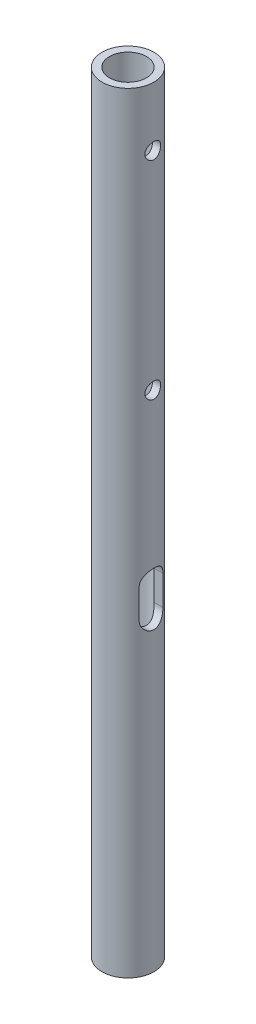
ISO-10303-21;
HEADER;
FILE_DESCRIPTION(('STEP AP214'),'2;1');
FILE_NAME('part.step','',(''),(''),'','','');
FILE_SCHEMA(('AUTOMOTIVE_DESIGN { 1 0 10303 214 1 1 1 1 }'));
ENDSEC;
DATA;
#1=APPLICATION_CONTEXT('core data for automotive mechanical design processes');
#2=APPLICATION_PROTOCOL_DEFINITION('international standard','automotive_design',2000,#1);
#3=PRODUCT_CONTEXT('',#1,'mechanical');
#4=PRODUCT('Part','Part','',(#3));
#5=PRODUCT_RELATED_PRODUCT_CATEGORY('part','',(#4));
#6=PRODUCT_DEFINITION_FORMATION('','',#4);
#7=PRODUCT_DEFINITION_CONTEXT('part definition',#1,'design');
#8=PRODUCT_DEFINITION('design','',#6,#7);
#9=PRODUCT_DEFINITION_SHAPE('','',#8);
#10=(LENGTH_UNIT() NAMED_UNIT(*) SI_UNIT(.MILLI.,.METRE.));
#11=(NAMED_UNIT(*) PLANE_ANGLE_UNIT() SI_UNIT($,.RADIAN.));
#12=(NAMED_UNIT(*) SI_UNIT($,.STERADIAN.) SOLID_ANGLE_UNIT());
#13=UNCERTAINTY_MEASURE_WITH_UNIT(LENGTH_MEASURE(1.E-05),#10,'distance_accuracy_value','');
#14=(GEOMETRIC_REPRESENTATION_CONTEXT(3) GLOBAL_UNCERTAINTY_ASSIGNED_CONTEXT((#13)) GLOBAL_UNIT_ASSIGNED_CONTEXT((#10,
#11,#12)) REPRESENTATION_CONTEXT('',''));
#15=CARTESIAN_POINT('',(0.,0.,0.));
#16=DIRECTION('',(0.,0.,1.));
#17=DIRECTION('',(1.,0.,0.));
#18=AXIS2_PLACEMENT_3D('',#15,#16,#17);
#19=CARTESIAN_POINT('',(0.,330.2,0.));
#20=DIRECTION('',(0.,-1.,0.));
#21=DIRECTION('',(0.,0.,-1.));
#22=AXIS2_PLACEMENT_3D('',#19,#20,#21);
#23=CYLINDRICAL_SURFACE('',#22,11.1125);
#24=CARTESIAN_POINT('',(-11.1125,209.55,0.));
#25=CARTESIAN_POINT('',(-11.1124987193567,209.550001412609,-0.163789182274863));
#26=CARTESIAN_POINT('',(-11.1088693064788,209.556347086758,-0.327629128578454));
#27=CARTESIAN_POINT('',(-11.0944381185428,209.58165324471,-0.65408591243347));
#28=CARTESIAN_POINT('',(-11.0836318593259,209.600621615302,-0.816701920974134));
#29=CARTESIAN_POINT('',(-11.0550908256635,209.650975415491,-1.13971905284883));
#30=CARTESIAN_POINT('',(-11.03734227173,209.682385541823,-1.30011511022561));
#31=CARTESIAN_POINT('',(-10.9953496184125,209.757238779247,-1.61726609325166));
#32=CARTESIAN_POINT('',(-10.9711027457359,209.800687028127,-1.77401943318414));
#33=CARTESIAN_POINT('',(-10.9168335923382,209.898852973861,-2.08199776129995));
#34=CARTESIAN_POINT('',(-10.8868421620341,209.953510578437,-2.23324736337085));
#35=CARTESIAN_POINT('',(-10.8216761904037,210.073675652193,-2.53024463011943));
#36=CARTESIAN_POINT('',(-10.7864996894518,210.139187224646,-2.67599018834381));
#37=CARTESIAN_POINT('',(-10.674359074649,210.351015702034,-3.10359647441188));
#38=CARTESIAN_POINT('',(-10.5907106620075,210.512755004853,-3.37622520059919));
#39=CARTESIAN_POINT('',(-10.4057691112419,210.885722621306,-3.91067150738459));
#40=CARTESIAN_POINT('',(-10.3036378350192,211.099682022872,-4.17028523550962));
#41=CARTESIAN_POINT('',(-10.1474768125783,211.448381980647,-4.53141063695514));
#42=CARTESIAN_POINT('',(-10.0948805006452,211.569363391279,-4.64716119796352));
#43=CARTESIAN_POINT('',(-9.98985145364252,211.820176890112,-4.86883414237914));
#44=CARTESIAN_POINT('',(-9.93741875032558,211.950010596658,-4.97475472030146));
#45=CARTESIAN_POINT('',(-9.82833425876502,212.232604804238,-5.18722276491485));
#46=CARTESIAN_POINT('',(-9.77184466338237,212.386322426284,-5.29258286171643));
#47=CARTESIAN_POINT('',(-9.66238677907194,212.70333281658,-5.48986923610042));
#48=CARTESIAN_POINT('',(-9.60941817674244,212.866624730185,-5.58179671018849));
#49=CARTESIAN_POINT('',(-9.50892223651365,213.201855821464,-5.75132663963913));
#50=CARTESIAN_POINT('',(-9.46138886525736,213.37378509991,-5.82894503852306));
#51=CARTESIAN_POINT('',(-9.37362073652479,213.725474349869,-5.96906489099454));
#52=CARTESIAN_POINT('',(-9.33338358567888,213.905231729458,-6.0315713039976));
#53=CARTESIAN_POINT('',(-9.26994720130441,214.230772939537,-6.12848290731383));
#54=CARTESIAN_POINT('',(-9.24494802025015,214.375272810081,-6.16604571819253));
#55=CARTESIAN_POINT('',(-9.20127473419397,214.667462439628,-6.23103019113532));
#56=CARTESIAN_POINT('',(-9.18259928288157,214.815151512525,-6.25845401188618));
#57=CARTESIAN_POINT('',(-9.15222116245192,215.112679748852,-6.30279529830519));
#58=CARTESIAN_POINT('',(-9.14051235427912,215.262516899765,-6.31972201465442));
#59=CARTESIAN_POINT('',(-9.1244658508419,215.563417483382,-6.3428684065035));
#60=CARTESIAN_POINT('',(-9.12012830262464,215.714480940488,-6.34908786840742));
#61=CARTESIAN_POINT('',(-9.11898717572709,216.016900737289,-6.35072675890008));
#62=CARTESIAN_POINT('',(-9.12219384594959,216.16825719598,-6.34613149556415));
#63=CARTESIAN_POINT('',(-9.13604137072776,216.469912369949,-6.32617972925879));
#64=CARTESIAN_POINT('',(-9.14668225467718,216.620211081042,-6.31082318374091));
#65=CARTESIAN_POINT('',(-9.17501386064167,216.91873214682,-6.26956140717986));
#66=CARTESIAN_POINT('',(-9.19270735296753,217.066953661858,-6.24365203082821));
#67=CARTESIAN_POINT('',(-9.23453963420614,217.360365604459,-6.18161229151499));
#68=CARTESIAN_POINT('',(-9.25868102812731,217.505554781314,-6.14547779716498));
#69=CARTESIAN_POINT('',(-9.31251885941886,217.791421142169,-6.0635827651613));
#70=CARTESIAN_POINT('',(-9.3421905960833,217.932115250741,-6.0178649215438));
#71=CARTESIAN_POINT('',(-9.4063093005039,218.209039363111,-5.91714143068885));
#72=CARTESIAN_POINT('',(-9.44075783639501,218.345267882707,-5.86213273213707));
#73=CARTESIAN_POINT('',(-9.54992330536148,218.746409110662,-5.68384138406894));
#74=CARTESIAN_POINT('',(-9.63048817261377,219.003918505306,-5.54725255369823));
#75=CARTESIAN_POINT('',(-9.81371620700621,219.535360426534,-5.21723930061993));
#76=CARTESIAN_POINT('',(-9.91785171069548,219.805311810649,-5.01821456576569));
#77=CARTESIAN_POINT('',(-10.0749588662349,220.184016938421,-4.69016607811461));
#78=CARTESIAN_POINT('',(-10.127517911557,220.305962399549,-4.57580215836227));
#79=CARTESIAN_POINT('',(-10.2318130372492,220.540679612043,-4.33757365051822));
#80=CARTESIAN_POINT('',(-10.2835489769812,220.653449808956,-4.21370745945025));
#81=CARTESIAN_POINT('',(-10.3908469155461,220.881545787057,-3.94228596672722));
#82=CARTESIAN_POINT('',(-10.4461703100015,220.995690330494,-3.79364125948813));
#83=CARTESIAN_POINT('',(-10.5528406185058,221.210934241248,-3.48593050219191));
#84=CARTESIAN_POINT('',(-10.6041891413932,221.312038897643,-3.32686871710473));
#85=CARTESIAN_POINT('',(-10.7014925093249,221.500292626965,-2.99915328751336));
#86=CARTESIAN_POINT('',(-10.7474485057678,221.587444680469,-2.83050170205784));
#87=CARTESIAN_POINT('',(-10.8326290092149,221.746813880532,-2.48465393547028));
#88=CARTESIAN_POINT('',(-10.8718543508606,221.819032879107,-2.30745881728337));
#89=CARTESIAN_POINT('',(-10.9399248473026,221.94311997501,-1.95834408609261));
#90=CARTESIAN_POINT('',(-10.9692997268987,221.996048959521,-1.78690503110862));
#91=CARTESIAN_POINT('',(-11.0203276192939,222.087398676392,-1.43906988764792));
#92=CARTESIAN_POINT('',(-11.0419809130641,222.125819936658,-1.26267397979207));
#93=CARTESIAN_POINT('',(-11.0769012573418,222.187545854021,-0.906583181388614));
#94=CARTESIAN_POINT('',(-11.0901751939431,222.210862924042,-0.72689112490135));
#95=CARTESIAN_POINT('',(-11.1079501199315,222.242047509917,-0.365746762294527));
#96=CARTESIAN_POINT('',(-11.1124520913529,222.249916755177,-0.184294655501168));
#97=CARTESIAN_POINT('',(-11.1125414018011,222.250071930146,0.156551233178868));
#98=CARTESIAN_POINT('',(-11.1091450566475,222.244134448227,0.315947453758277));
#99=CARTESIAN_POINT('',(-11.0955632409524,222.220321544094,0.633554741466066));
#100=CARTESIAN_POINT('',(-11.0853778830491,222.202446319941,0.791765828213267));
#101=CARTESIAN_POINT('',(-11.0584634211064,222.154985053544,1.10584248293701));
#102=CARTESIAN_POINT('',(-11.0417346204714,222.125399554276,1.26170815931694));
#103=CARTESIAN_POINT('',(-11.0021258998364,222.054873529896,1.5700471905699));
#104=CARTESIAN_POINT('',(-10.9792457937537,222.013932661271,1.72252044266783));
#105=CARTESIAN_POINT('',(-10.9281177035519,221.921632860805,2.02154850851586));
#106=CARTESIAN_POINT('',(-10.8999288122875,221.870388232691,2.1681487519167));
#107=CARTESIAN_POINT('',(-10.83862581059,221.757719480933,2.45633694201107));
#108=CARTESIAN_POINT('',(-10.8055100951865,221.696292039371,2.59792323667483));
#109=CARTESIAN_POINT('',(-10.6997583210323,221.497529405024,3.01405600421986));
#110=CARTESIAN_POINT('',(-10.6206807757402,221.345649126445,3.28018372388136));
#111=CARTESIAN_POINT('',(-10.4424911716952,220.989853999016,3.81165777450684));
#112=CARTESIAN_POINT('',(-10.3421505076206,220.782168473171,4.0740394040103));
#113=CARTESIAN_POINT('',(-10.1361910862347,220.329214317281,4.56240375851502));
#114=CARTESIAN_POINT('',(-10.0305663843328,220.083902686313,4.78834422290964));
#115=CARTESIAN_POINT('',(-9.86959991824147,219.67646573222,5.10833813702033));
#116=CARTESIAN_POINT('',(-9.81274585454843,219.525737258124,5.21642280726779));
#117=CARTESIAN_POINT('',(-9.70206624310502,219.214526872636,5.41949435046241));
#118=CARTESIAN_POINT('',(-9.6482414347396,219.054042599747,5.51447803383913));
#119=CARTESIAN_POINT('',(-9.54552604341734,218.724258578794,5.69042781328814));
#120=CARTESIAN_POINT('',(-9.49663097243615,218.554967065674,5.77140670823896));
#121=CARTESIAN_POINT('',(-9.40563628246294,218.20840703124,5.91854271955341));
#122=CARTESIAN_POINT('',(-9.36353175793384,218.031144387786,5.98471054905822));
#123=CARTESIAN_POINT('',(-9.29600151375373,217.708267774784,6.08892448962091));
#124=CARTESIAN_POINT('',(-9.26893347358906,217.563955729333,6.12995855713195));
#125=CARTESIAN_POINT('',(-9.22097964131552,217.271873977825,6.20185955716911));
#126=CARTESIAN_POINT('',(-9.2000906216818,217.124106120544,6.23273179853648));
#127=CARTESIAN_POINT('',(-9.1651988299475,216.826064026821,6.28392783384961));
#128=CARTESIAN_POINT('',(-9.151190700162,216.675791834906,6.30425983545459));
#129=CARTESIAN_POINT('',(-9.1305425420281,216.373666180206,6.3341283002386));
#130=CARTESIAN_POINT('',(-9.12390262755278,216.221812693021,6.343664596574));
#131=CARTESIAN_POINT('',(-9.11823714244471,215.917360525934,6.35180552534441));
#132=CARTESIAN_POINT('',(-9.11922701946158,215.764760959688,6.35038798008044));
#133=CARTESIAN_POINT('',(-9.12881878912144,215.460303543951,6.33659153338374));
#134=CARTESIAN_POINT('',(-9.13742070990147,215.308445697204,6.32421259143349));
#135=CARTESIAN_POINT('',(-9.16192059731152,215.006540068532,6.28866704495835));
#136=CARTESIAN_POINT('',(-9.17782109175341,214.856492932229,6.26549670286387));
#137=CARTESIAN_POINT('',(-9.21634397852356,214.559249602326,6.20868929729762));
#138=CARTESIAN_POINT('',(-9.2389690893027,214.41205458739,6.17504800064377));
#139=CARTESIAN_POINT('',(-9.3149304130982,213.981283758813,6.06037275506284));
#140=CARTESIAN_POINT('',(-9.37685596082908,213.702918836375,5.96490248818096));
#141=CARTESIAN_POINT('',(-9.51705047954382,213.165643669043,5.73855530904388));
#142=CARTESIAN_POINT('',(-9.59532547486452,212.906740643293,5.6076653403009));
#143=CARTESIAN_POINT('',(-9.77402820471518,212.37309586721,5.29093240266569));
#144=CARTESIAN_POINT('',(-9.87601111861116,212.102054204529,5.09973106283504));
#145=CARTESIAN_POINT('',(-10.082629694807,211.593211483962,4.67796200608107));
#146=CARTESIAN_POINT('',(-10.1872675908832,211.355439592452,4.44736013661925));
#147=CARTESIAN_POINT('',(-10.3456578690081,211.013351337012,4.05929674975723));
#148=CARTESIAN_POINT('',(-10.4016593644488,210.89613161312,3.91392736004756));
#149=CARTESIAN_POINT('',(-10.510116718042,210.674413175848,3.6125755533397));
#150=CARTESIAN_POINT('',(-10.5625738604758,210.569909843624,3.45659702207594));
#151=CARTESIAN_POINT('',(-10.6624990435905,210.374534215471,3.13482962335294));
#152=CARTESIAN_POINT('',(-10.7099675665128,210.283660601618,2.96904170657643));
#153=CARTESIAN_POINT('',(-10.7985518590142,210.116524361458,2.62865577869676));
#154=CARTESIAN_POINT('',(-10.8396693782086,210.040257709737,2.45406021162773));
#155=CARTESIAN_POINT('',(-10.9076722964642,209.915488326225,2.12903892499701));
#156=CARTESIAN_POINT('',(-10.9357883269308,209.864460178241,1.97983507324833));
#157=CARTESIAN_POINT('',(-10.9862789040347,209.773450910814,1.67715731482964));
#158=CARTESIAN_POINT('',(-11.0086544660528,209.733467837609,1.52368416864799));
#159=CARTESIAN_POINT('',(-11.047110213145,209.665075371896,1.21380914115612));
#160=CARTESIAN_POINT('',(-11.0632057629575,209.63663772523,1.05741540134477));
#161=CARTESIAN_POINT('',(-11.0887931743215,209.591551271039,0.742464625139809));
#162=CARTESIAN_POINT('',(-11.0982887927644,209.574895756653,0.583908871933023));
#163=CARTESIAN_POINT('',(-11.107079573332,209.559489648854,0.354192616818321));
#164=CARTESIAN_POINT('',(-11.1091108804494,209.555932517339,0.283423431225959));
#165=CARTESIAN_POINT('',(-11.1118214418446,209.551187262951,0.141772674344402));
#166=CARTESIAN_POINT('',(-11.1125005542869,209.549999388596,0.0708910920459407));
#167=CARTESIAN_POINT('',(-11.1125,209.55,0.));
#168=B_SPLINE_CURVE_WITH_KNOTS('',3,(#24,#25,#26,#27,#28,#29,#30,#31,#32,#33,#34,#35,#36,#37,
#38,#39,#40,#41,#42,#43,#44,#45,#46,#47,#48,#49,#50,#51,#52,#53,#54,#55,#56,#57,#58,#59,#60,#61,
#62,#63,#64,#65,#66,#67,#68,#69,#70,#71,#72,#73,#74,#75,#76,#77,#78,#79,#80,#81,#82,#83,#84,#85,
#86,#87,#88,#89,#90,#91,#92,#93,#94,#95,#96,#97,#98,#99,#100,#101,#102,#103,#104,#105,#106,#107,
#108,#109,#110,#111,#112,#113,#114,#115,#116,#117,#118,#119,#120,#121,#122,#123,#124,#125,#126,
#127,#128,#129,#130,#131,#132,#133,#134,#135,#136,#137,#138,#139,#140,#141,#142,#143,#144,#145,
#146,#147,#148,#149,#150,#151,#152,#153,#154,#155,#156,#157,#158,#159,#160,#161,#162,#163,#164,
#165,#166,#167),.UNSPECIFIED.,.T.,.F.,(4,2,2,2,2,2,2,2,2,2,2,2,2,2,2,2,2,2,2,2,2,2,2,2,2,2,2,2,
2,2,2,2,2,2,2,2,2,2,2,2,2,2,2,2,2,2,2,2,2,2,2,2,2,2,2,2,2,2,2,2,2,2,2,2,2,2,2,2,2,2,2,4),(0.,
0.49129366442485,0.982894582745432,1.47547625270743,1.9682684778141,2.45848488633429,
2.94888704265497,3.92843091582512,4.97873918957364,5.50484008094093,6.03103741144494,
6.61452599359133,7.1979625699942,7.78074508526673,8.36333608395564,8.81701344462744,
9.27059415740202,9.72377457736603,10.1769640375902,10.6307695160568,11.0845767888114,
11.5385624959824,11.9927318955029,12.4449193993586,12.8972557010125,13.8014842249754,
14.8506166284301,15.3759631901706,15.9013985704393,16.4868924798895,17.0721481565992,
17.6572786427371,18.2423365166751,18.7869966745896,19.3316370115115,19.8758291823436,
20.419960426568,20.8980042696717,21.3760401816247,21.8540539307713,22.3320821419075,
22.8050740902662,23.2782204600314,24.2238591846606,25.267928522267,26.3132000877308,
26.894589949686,27.4761211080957,28.0571179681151,28.637693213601,29.0945945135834,
29.5512567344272,30.0075628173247,30.4638759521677,30.9211132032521,31.3783521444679,
31.835749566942,32.2933321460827,33.1916958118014,34.0903910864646,35.1274728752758,
36.1654582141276,36.7497093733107,37.3337476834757,37.9177294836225,38.5015501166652,
38.9815704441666,39.46150580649,39.9402594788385,40.418740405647,40.6313594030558,
40.8440007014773),.UNSPECIFIED.);
#169=CARTESIAN_POINT('',(-11.1125,209.55,0.));
#170=VERTEX_POINT('',#169);
#171=EDGE_CURVE('E234',#170,#170,#168,.T.);
#172=ORIENTED_EDGE('',*,*,#171,.T.);
#173=EDGE_LOOP('',(#172));
#174=FACE_BOUND('',#173,.T.);
#175=CARTESIAN_POINT('',(-11.1125,298.424188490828,0.));
#176=CARTESIAN_POINT('',(-11.1124986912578,298.424189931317,-0.164356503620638));
#177=CARTESIAN_POINT('',(-11.1088441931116,298.430553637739,-0.328760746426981));
#178=CARTESIAN_POINT('',(-11.0943132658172,298.455931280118,-0.656340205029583));
#179=CARTESIAN_POINT('',(-11.0834324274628,298.474952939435,-0.819514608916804));
#180=CARTESIAN_POINT('',(-11.0546949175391,298.52544599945,-1.14363154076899));
#181=CARTESIAN_POINT('',(-11.0368246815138,298.556941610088,-1.30456909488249));
#182=CARTESIAN_POINT('',(-10.9945438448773,298.631996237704,-1.62278907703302));
#183=CARTESIAN_POINT('',(-10.9701304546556,298.675560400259,-1.7800699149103));
#184=CARTESIAN_POINT('',(-10.9154876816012,298.773985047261,-2.08908303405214));
#185=CARTESIAN_POINT('',(-10.8852893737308,298.828785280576,-2.24084002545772));
#186=CARTESIAN_POINT('',(-10.8196719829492,298.949260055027,-2.53883334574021));
#187=CARTESIAN_POINT('',(-10.7842509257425,299.014938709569,-2.68506756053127));
#188=CARTESIAN_POINT('',(-10.6713250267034,299.227302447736,-3.11411322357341));
#189=CARTESIAN_POINT('',(-10.587084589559,299.389442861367,-3.38766298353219));
#190=CARTESIAN_POINT('',(-10.4007735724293,299.763376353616,-3.92402923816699));
#191=CARTESIAN_POINT('',(-10.2978525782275,299.977919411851,-4.18462507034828));
#192=CARTESIAN_POINT('',(-10.140440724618,300.327566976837,-4.54715153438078));
#193=CARTESIAN_POINT('',(-10.087415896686,300.448876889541,-4.6633576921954));
#194=CARTESIAN_POINT('',(-9.98151349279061,300.700372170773,-4.88591967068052));
#195=CARTESIAN_POINT('',(-9.92863594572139,300.830559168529,-4.99227367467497));
#196=CARTESIAN_POINT('',(-9.81854558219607,301.11407484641,-5.20574597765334));
#197=CARTESIAN_POINT('',(-9.76149558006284,301.268373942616,-5.31166185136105));
#198=CARTESIAN_POINT('',(-9.65092511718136,301.586602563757,-5.51000842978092));
#199=CARTESIAN_POINT('',(-9.59740434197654,301.750531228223,-5.60244033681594));
#200=CARTESIAN_POINT('',(-9.49583295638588,302.087092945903,-5.77292403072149));
#201=CARTESIAN_POINT('',(-9.4477762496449,302.25971598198,-5.85099190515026));
#202=CARTESIAN_POINT('',(-9.35901327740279,302.612853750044,-5.99195083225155));
#203=CARTESIAN_POINT('',(-9.31830457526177,302.79336584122,-6.05484691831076));
#204=CARTESIAN_POINT('',(-9.25415845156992,303.120002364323,-6.15230092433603));
#205=CARTESIAN_POINT('',(-9.22889385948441,303.264822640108,-6.19005047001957));
#206=CARTESIAN_POINT('',(-9.18472217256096,303.55767488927,-6.25540531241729));
#207=CARTESIAN_POINT('',(-9.16581371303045,303.705706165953,-6.28301278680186));
#208=CARTESIAN_POINT('',(-9.1350107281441,304.003939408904,-6.32771478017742));
#209=CARTESIAN_POINT('',(-9.12310995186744,304.154139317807,-6.34481866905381));
#210=CARTESIAN_POINT('',(-9.10672774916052,304.455786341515,-6.36831007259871));
#211=CARTESIAN_POINT('',(-9.10224646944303,304.607233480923,-6.37469737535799));
#212=CARTESIAN_POINT('',(-9.10087172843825,304.910445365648,-6.37665992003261));
#213=CARTESIAN_POINT('',(-9.10398892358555,305.062210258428,-6.37221997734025));
#214=CARTESIAN_POINT('',(-9.11771538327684,305.364695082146,-6.35256360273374));
#215=CARTESIAN_POINT('',(-9.12832467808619,305.515415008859,-6.33734712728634));
#216=CARTESIAN_POINT('',(-9.15665098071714,305.81478713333,-6.29634948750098));
#217=CARTESIAN_POINT('',(-9.17437081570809,305.963438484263,-6.27056412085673));
#218=CARTESIAN_POINT('',(-9.21631092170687,306.257713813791,-6.20875678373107));
#219=CARTESIAN_POINT('',(-9.24053382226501,306.403336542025,-6.17273067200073));
#220=CARTESIAN_POINT('',(-9.29456688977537,306.689974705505,-6.09106428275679));
#221=CARTESIAN_POINT('',(-9.32434841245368,306.831009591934,-6.04547315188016));
#222=CARTESIAN_POINT('',(-9.38872535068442,307.108621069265,-5.9450020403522));
#223=CARTESIAN_POINT('',(-9.423322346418,307.24519617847,-5.89011900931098));
#224=CARTESIAN_POINT('',(-9.53298492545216,307.647386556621,-5.71220403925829));
#225=CARTESIAN_POINT('',(-9.61395027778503,307.905608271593,-5.57586540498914));
#226=CARTESIAN_POINT('',(-9.79826595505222,308.43893428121,-5.24620654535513));
#227=CARTESIAN_POINT('',(-9.90311985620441,308.710032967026,-5.04724036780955));
#228=CARTESIAN_POINT('',(-10.0613916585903,309.090476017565,-4.71920463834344));
#229=CARTESIAN_POINT('',(-10.1143539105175,309.21300436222,-4.60483205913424));
#230=CARTESIAN_POINT('',(-10.219479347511,309.448896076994,-4.36655858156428));
#231=CARTESIAN_POINT('',(-10.2716423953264,309.562257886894,-4.24265606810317));
#232=CARTESIAN_POINT('',(-10.3799619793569,309.791825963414,-3.97087668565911));
#233=CARTESIAN_POINT('',(-10.4358779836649,309.906831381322,-3.8218871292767));
#234=CARTESIAN_POINT('',(-10.5437338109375,310.12376666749,-3.51340522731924));
#235=CARTESIAN_POINT('',(-10.5956752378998,310.225701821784,-3.35391716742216));
#236=CARTESIAN_POINT('',(-10.6941506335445,310.415582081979,-3.02526298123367));
#237=CARTESIAN_POINT('',(-10.7406857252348,310.503530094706,-2.85609887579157));
#238=CARTESIAN_POINT('',(-10.8269952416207,310.66444841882,-2.50913762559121));
#239=CARTESIAN_POINT('',(-10.8667705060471,310.737420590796,-2.33134155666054));
#240=CARTESIAN_POINT('',(-10.9358719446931,310.862933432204,-1.98091632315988));
#241=CARTESIAN_POINT('',(-10.9657282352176,310.916533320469,-1.80877129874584));
#242=CARTESIAN_POINT('',(-11.0176606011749,311.009157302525,-1.45944538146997));
#243=CARTESIAN_POINT('',(-11.0397369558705,311.048181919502,-1.28226466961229));
#244=CARTESIAN_POINT('',(-11.0754310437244,311.111034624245,-0.924536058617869));
#245=CARTESIAN_POINT('',(-11.0890558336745,311.134875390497,-0.743991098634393));
#246=CARTESIAN_POINT('',(-11.1074492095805,311.167018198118,-0.381081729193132));
#247=CARTESIAN_POINT('',(-11.1122188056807,311.175322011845,-0.198717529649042));
#248=CARTESIAN_POINT('',(-11.1127241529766,311.176201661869,0.143669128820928));
#249=CARTESIAN_POINT('',(-11.1094959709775,311.170581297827,0.303689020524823));
#250=CARTESIAN_POINT('',(-11.0961940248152,311.147356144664,0.622570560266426));
#251=CARTESIAN_POINT('',(-11.0861203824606,311.12975156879,0.781432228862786));
#252=CARTESIAN_POINT('',(-11.0593703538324,311.082782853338,1.09682894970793));
#253=CARTESIAN_POINT('',(-11.0426942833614,311.053419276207,1.25336411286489));
#254=CARTESIAN_POINT('',(-11.0031311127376,310.983287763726,1.56305339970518));
#255=CARTESIAN_POINT('',(-10.9802438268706,310.942519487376,1.71620742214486));
#256=CARTESIAN_POINT('',(-10.9290691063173,310.850562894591,2.01643709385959));
#257=CARTESIAN_POINT('',(-10.9008472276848,310.799500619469,2.16356257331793));
#258=CARTESIAN_POINT('',(-10.8394316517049,310.687172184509,2.45281038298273));
#259=CARTESIAN_POINT('',(-10.8062363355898,310.625902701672,2.59493106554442));
#260=CARTESIAN_POINT('',(-10.7001765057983,310.427579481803,3.0126746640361));
#261=CARTESIAN_POINT('',(-10.6208010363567,310.27594611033,3.27988835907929));
#262=CARTESIAN_POINT('',(-10.4417898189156,309.920573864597,3.81367936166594));
#263=CARTESIAN_POINT('',(-10.3409049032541,309.713052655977,4.07729091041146));
#264=CARTESIAN_POINT('',(-10.1336459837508,309.260340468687,4.56813510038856));
#265=CARTESIAN_POINT('',(-10.0272657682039,309.015106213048,4.79532532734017));
#266=CARTESIAN_POINT('',(-9.86488575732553,308.60750883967,5.11746178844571));
#267=CARTESIAN_POINT('',(-9.8074447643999,308.456561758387,5.22640575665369));
#268=CARTESIAN_POINT('',(-9.69554275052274,308.144851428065,5.4311785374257));
#269=CARTESIAN_POINT('',(-9.64108246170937,307.98408578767,5.52700413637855));
#270=CARTESIAN_POINT('',(-9.53706112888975,307.653666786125,5.70462234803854));
#271=CARTESIAN_POINT('',(-9.48749570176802,307.484021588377,5.78642756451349));
#272=CARTESIAN_POINT('',(-9.39514477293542,307.136673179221,5.93519833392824));
#273=CARTESIAN_POINT('',(-9.3523543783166,306.958975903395,6.00217461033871));
#274=CARTESIAN_POINT('',(-9.28362790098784,306.635335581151,6.107780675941));
#275=CARTESIAN_POINT('',(-9.25604397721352,306.490715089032,6.14940949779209));
#276=CARTESIAN_POINT('',(-9.20707165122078,306.197958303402,6.22249360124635));
#277=CARTESIAN_POINT('',(-9.18568001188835,306.049823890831,6.25395419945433));
#278=CARTESIAN_POINT('',(-9.14981323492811,305.750988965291,6.30631301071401));
#279=CARTESIAN_POINT('',(-9.13533259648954,305.600290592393,6.3272196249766));
#280=CARTESIAN_POINT('',(-9.11378644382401,305.29724951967,6.35821608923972));
#281=CARTESIAN_POINT('',(-9.10672103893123,305.144906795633,6.36830577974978));
#282=CARTESIAN_POINT('',(-9.10026729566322,304.839396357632,6.37752494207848));
#283=CARTESIAN_POINT('',(-9.1008955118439,304.686227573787,6.37663077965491));
#284=CARTESIAN_POINT('',(-9.10984387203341,304.38058062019,6.36384001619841));
#285=CARTESIAN_POINT('',(-9.11816404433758,304.228102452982,6.35194337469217));
#286=CARTESIAN_POINT('',(-9.14218889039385,303.924916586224,6.31731610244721));
#287=CARTESIAN_POINT('',(-9.15789610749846,303.774209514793,6.29458174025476));
#288=CARTESIAN_POINT('',(-9.19612370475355,303.475618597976,6.2385974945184));
#289=CARTESIAN_POINT('',(-9.21864684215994,303.327735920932,6.20534335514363));
#290=CARTESIAN_POINT('',(-9.29432291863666,302.895563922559,6.09191702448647));
#291=CARTESIAN_POINT('',(-9.35613885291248,302.616429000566,5.99732944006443));
#292=CARTESIAN_POINT('',(-9.49634601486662,302.077508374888,5.77273595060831));
#293=CARTESIAN_POINT('',(-9.57474330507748,301.817729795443,5.64271708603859));
#294=CARTESIAN_POINT('',(-9.75396093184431,301.282010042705,5.3278109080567));
#295=CARTESIAN_POINT('',(-9.85637467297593,301.009758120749,5.13755335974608));
#296=CARTESIAN_POINT('',(-10.0641138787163,300.498324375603,4.71763617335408));
#297=CARTESIAN_POINT('',(-10.1694418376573,300.259172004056,4.48794184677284));
#298=CARTESIAN_POINT('',(-10.3292580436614,299.914412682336,4.10085299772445));
#299=CARTESIAN_POINT('',(-10.3859069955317,299.796010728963,3.95554660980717));
#300=CARTESIAN_POINT('',(-10.4957107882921,299.571920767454,3.65422761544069));
#301=CARTESIAN_POINT('',(-10.5488668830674,299.466228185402,3.49821889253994));
#302=CARTESIAN_POINT('',(-10.6502265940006,299.268467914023,3.17628938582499));
#303=CARTESIAN_POINT('',(-10.6984307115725,299.176398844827,3.01036960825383));
#304=CARTESIAN_POINT('',(-10.7885072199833,299.00686929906,2.66960603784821));
#305=CARTESIAN_POINT('',(-10.8303813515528,298.929404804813,2.49476471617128));
#306=CARTESIAN_POINT('',(-10.8997554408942,298.802477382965,2.16922832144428));
#307=CARTESIAN_POINT('',(-10.9284872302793,298.750484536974,2.01977711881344));
#308=CARTESIAN_POINT('',(-10.9802035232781,298.657551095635,1.71651709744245));
#309=CARTESIAN_POINT('',(-11.0031890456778,298.616608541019,1.56270905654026));
#310=CARTESIAN_POINT('',(-11.0428458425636,298.54631307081,1.25206818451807));
#311=CARTESIAN_POINT('',(-11.0595323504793,298.516932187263,1.09524362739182));
#312=CARTESIAN_POINT('',(-11.0862702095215,298.469985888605,0.779337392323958));
#313=CARTESIAN_POINT('',(-11.0963252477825,298.452413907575,0.620257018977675));
#314=CARTESIAN_POINT('',(-11.1061269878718,298.435301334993,0.384042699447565));
#315=CARTESIAN_POINT('',(-11.1085151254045,298.431135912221,0.307321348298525));
#316=CARTESIAN_POINT('',(-11.1117020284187,298.425578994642,0.153736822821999));
#317=CARTESIAN_POINT('',(-11.1125006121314,298.424187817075,0.0768736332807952));
#318=CARTESIAN_POINT('',(-11.1125,298.424188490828,0.));
#319=B_SPLINE_CURVE_WITH_KNOTS('',3,(#175,#176,#177,#178,#179,#180,#181,#182,#183,#184,#185,
#186,#187,#188,#189,#190,#191,#192,#193,#194,#195,#196,#197,#198,#199,#200,#201,#202,#203,#204,
#205,#206,#207,#208,#209,#210,#211,#212,#213,#214,#215,#216,#217,#218,#219,#220,#221,#222,#223,
#224,#225,#226,#227,#228,#229,#230,#231,#232,#233,#234,#235,#236,#237,#238,#239,#240,#241,#242,
#243,#244,#245,#246,#247,#248,#249,#250,#251,#252,#253,#254,#255,#256,#257,#258,#259,#260,#261,
#262,#263,#264,#265,#266,#267,#268,#269,#270,#271,#272,#273,#274,#275,#276,#277,#278,#279,#280,
#281,#282,#283,#284,#285,#286,#287,#288,#289,#290,#291,#292,#293,#294,#295,#296,#297,#298,#299,
#300,#301,#302,#303,#304,#305,#306,#307,#308,#309,#310,#311,#312,#313,#314,#315,#316,#317,#318),
.UNSPECIFIED.,.T.,.F.,(4,2,2,2,2,2,2,2,2,2,2,2,2,2,2,2,2,2,2,2,2,2,2,2,2,2,2,2,2,2,2,2,2,2,2,2,
2,2,2,2,2,2,2,2,2,2,2,2,2,2,2,2,2,2,2,2,2,2,2,2,2,2,2,2,2,2,2,2,2,2,2,4),(0.,0.492989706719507,
0.986280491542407,1.48053340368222,1.97499737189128,2.46687614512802,2.95894133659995,
3.9418210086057,4.99605019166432,5.52411730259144,6.05228159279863,6.63853495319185,
7.22473600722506,7.81027647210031,8.39562241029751,8.85048802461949,9.30525591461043,
9.75961753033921,10.2139881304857,10.6689963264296,11.1240063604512,11.5791974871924,
12.0345729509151,12.4876635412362,12.9409031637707,13.8469372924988,14.8992570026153,
15.4262025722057,15.9532376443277,16.5415301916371,17.1295840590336,17.7175155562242,
18.3053739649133,18.8528475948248,19.4003015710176,19.9472978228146,20.4942316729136,
20.9740969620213,21.4539537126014,21.9337875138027,22.4136356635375,22.8879309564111,
23.3623809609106,24.3106215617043,25.357637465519,26.4058639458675,26.9897185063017,
27.5737158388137,28.1571853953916,28.7402316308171,29.1987678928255,29.657064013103,
30.1149947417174,30.5729322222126,31.0318552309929,31.490779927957,31.9498627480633,
32.4091315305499,33.3087251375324,34.208648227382,35.2474041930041,36.2870785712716,
36.8738867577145,37.460483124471,38.0470200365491,38.6333953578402,39.1153615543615,
39.5972422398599,40.0779499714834,40.5583902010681,40.7889474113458,41.0195309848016),.UNSPECIFIED.);
#320=CARTESIAN_POINT('',(-11.1125,298.424188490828,0.));
#321=VERTEX_POINT('',#320);
#322=EDGE_CURVE('E246',#321,#321,#319,.T.);
#323=ORIENTED_EDGE('',*,*,#322,.T.);
#324=EDGE_LOOP('',(#323));
#325=FACE_BOUND('',#324,.T.);
#326=CARTESIAN_POINT('',(0.,330.2,0.));
#327=DIRECTION('',(0.,1.,0.));
#328=DIRECTION('',(0.,0.,1.));
#329=AXIS2_PLACEMENT_3D('',#326,#327,#328);
#330=CIRCLE('',#329,11.1125);
#331=CARTESIAN_POINT('',(0.,330.2,11.1125));
#332=VERTEX_POINT('',#331);
#333=EDGE_CURVE('E124',#332,#332,#330,.T.);
#334=ORIENTED_EDGE('',*,*,#333,.F.);
#335=EDGE_LOOP('',(#334));
#336=FACE_BOUND('',#335,.T.);
#337=CARTESIAN_POINT('',(0.,0.,0.));
#338=DIRECTION('',(0.,1.,0.));
#339=DIRECTION('',(0.,0.,1.));
#340=AXIS2_PLACEMENT_3D('',#337,#338,#339);
#341=CIRCLE('',#340,11.1125);
#342=CARTESIAN_POINT('',(0.,0.,11.1125));
#343=VERTEX_POINT('',#342);
#344=EDGE_CURVE('E291',#343,#343,#341,.T.);
#345=ORIENTED_EDGE('',*,*,#344,.T.);
#346=EDGE_LOOP('',(#345));
#347=FACE_BOUND('',#346,.T.);
#348=CARTESIAN_POINT('',(11.1125,212.5218,0.));
#349=CARTESIAN_POINT('',(11.1124986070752,212.521801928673,-0.185209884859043));
#350=CARTESIAN_POINT('',(11.1078256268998,212.53708160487,-0.370439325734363));
#351=CARTESIAN_POINT('',(11.0896411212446,212.59764675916,-0.735496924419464));
#352=CARTESIAN_POINT('',(11.0761271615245,212.64294050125,-0.915323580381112));
#353=CARTESIAN_POINT('',(11.0417400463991,212.761876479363,-1.26425783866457));
#354=CARTESIAN_POINT('',(11.0208779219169,212.835476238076,-1.43338106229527));
#355=CARTESIAN_POINT('',(10.9739583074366,213.008758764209,-1.75688605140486));
#356=CARTESIAN_POINT('',(10.9479000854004,213.108445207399,-1.91126573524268));
#357=CARTESIAN_POINT('',(10.89250677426,213.334158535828,-2.20544044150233));
#358=CARTESIAN_POINT('',(10.8631031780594,213.460813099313,-2.34474092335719));
#359=CARTESIAN_POINT('',(10.8047379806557,213.735530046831,-2.60048753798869));
#360=CARTESIAN_POINT('',(10.7757764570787,213.883596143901,-2.71692969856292));
#361=CARTESIAN_POINT('',(10.7208464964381,214.201148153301,-2.92628165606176));
#362=CARTESIAN_POINT('',(10.69496300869,214.371051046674,-3.01858335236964));
#363=CARTESIAN_POINT('',(10.6501456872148,214.724881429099,-3.17310137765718));
#364=CARTESIAN_POINT('',(10.6312101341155,214.908805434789,-3.23532515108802));
#365=CARTESIAN_POINT('',(10.6031473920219,215.279895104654,-3.32612941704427));
#366=CARTESIAN_POINT('',(10.5937545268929,215.4668165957,-3.35562343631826));
#367=CARTESIAN_POINT('',(10.5850507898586,215.843172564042,-3.38298401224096));
#368=CARTESIAN_POINT('',(10.5857374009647,216.032606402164,-3.38085846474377));
#369=CARTESIAN_POINT('',(10.5968798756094,216.40114078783,-3.34575681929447));
#370=CARTESIAN_POINT('',(10.6069716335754,216.580363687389,-3.31393047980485));
#371=CARTESIAN_POINT('',(10.6351974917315,216.930795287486,-3.22219038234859));
#372=CARTESIAN_POINT('',(10.6533324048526,217.102003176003,-3.16227378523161));
#373=CARTESIAN_POINT('',(10.6958881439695,217.434333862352,-3.01521819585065));
#374=CARTESIAN_POINT('',(10.7203933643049,217.595282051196,-2.9277100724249));
#375=CARTESIAN_POINT('',(10.7728886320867,217.900592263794,-2.72821195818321));
#376=CARTESIAN_POINT('',(10.8008795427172,218.044950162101,-2.61621589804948));
#377=CARTESIAN_POINT('',(10.8586639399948,218.319496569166,-2.36523242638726));
#378=CARTESIAN_POINT('',(10.8884832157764,218.448810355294,-2.22529243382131));
#379=CARTESIAN_POINT('',(10.945500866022,218.682341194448,-1.92534174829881));
#380=CARTESIAN_POINT('',(10.9726990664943,218.786556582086,-1.76532972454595));
#381=CARTESIAN_POINT('',(11.0216699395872,218.967482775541,-1.42815706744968));
#382=CARTESIAN_POINT('',(11.0434030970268,219.043994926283,-1.25088371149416));
#383=CARTESIAN_POINT('',(11.0787102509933,219.165858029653,-0.885170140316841));
#384=CARTESIAN_POINT('',(11.0922865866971,219.211217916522,-0.696733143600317));
#385=CARTESIAN_POINT('',(11.109378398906,219.268021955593,-0.321473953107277));
#386=CARTESIAN_POINT('',(11.1132452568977,219.280651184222,-0.134846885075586));
#387=CARTESIAN_POINT('',(11.1115159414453,219.274963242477,0.237874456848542));
#388=CARTESIAN_POINT('',(11.1059210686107,219.25665032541,0.423968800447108));
#389=CARTESIAN_POINT('',(11.0861272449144,219.190554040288,0.785838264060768));
#390=CARTESIAN_POINT('',(11.0721317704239,219.143467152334,0.961752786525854));
#391=CARTESIAN_POINT('',(11.0371620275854,219.022001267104,1.30314296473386));
#392=CARTESIAN_POINT('',(11.0161869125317,218.947618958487,1.46861735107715));
#393=CARTESIAN_POINT('',(10.968811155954,218.771710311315,1.78875892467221));
#394=CARTESIAN_POINT('',(10.9422944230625,218.669586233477,1.94308002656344));
#395=CARTESIAN_POINT('',(10.8868760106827,218.44181638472,2.23279631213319));
#396=CARTESIAN_POINT('',(10.8579737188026,218.316164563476,2.36818661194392));
#397=CARTESIAN_POINT('',(10.7996865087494,218.039335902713,2.62144294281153));
#398=CARTESIAN_POINT('',(10.7703238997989,217.887380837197,2.7384653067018));
#399=CARTESIAN_POINT('',(10.7155817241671,217.565351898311,2.94541404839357));
#400=CARTESIAN_POINT('',(10.6902020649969,217.395278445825,3.03534105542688));
#401=CARTESIAN_POINT('',(10.6465886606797,217.042325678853,3.18494722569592));
#402=CARTESIAN_POINT('',(10.6283233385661,216.859507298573,3.24476040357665));
#403=CARTESIAN_POINT('',(10.6011242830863,216.485731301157,3.33256265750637));
#404=CARTESIAN_POINT('',(10.5921872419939,216.294776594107,3.36056301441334));
#405=CARTESIAN_POINT('',(10.5849884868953,215.918930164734,3.38316402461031));
#406=CARTESIAN_POINT('',(10.5862863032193,215.734128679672,3.37914269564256));
#407=CARTESIAN_POINT('',(10.5983485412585,215.36796770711,3.3411155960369));
#408=CARTESIAN_POINT('',(10.6091125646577,215.186608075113,3.30711108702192));
#409=CARTESIAN_POINT('',(10.6385949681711,214.834798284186,3.21098303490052));
#410=CARTESIAN_POINT('',(10.6572073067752,214.6642363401,3.14923365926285));
#411=CARTESIAN_POINT('',(10.7002672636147,214.335757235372,2.99966095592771));
#412=CARTESIAN_POINT('',(10.7247160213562,214.177842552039,2.91183253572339));
#413=CARTESIAN_POINT('',(10.7778317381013,213.872769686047,2.70876149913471));
#414=CARTESIAN_POINT('',(10.8066219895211,213.726232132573,2.59261879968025));
#415=CARTESIAN_POINT('',(10.8645882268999,213.454279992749,2.33782466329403));
#416=CARTESIAN_POINT('',(10.8937643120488,213.328870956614,2.19916733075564));
#417=CARTESIAN_POINT('',(10.9502748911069,213.098943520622,1.89822147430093));
#418=CARTESIAN_POINT('',(10.9775268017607,212.995173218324,1.7353442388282));
#419=CARTESIAN_POINT('',(11.0261130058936,212.816631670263,1.39362688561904));
#420=CARTESIAN_POINT('',(11.0474499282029,212.741847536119,1.21479390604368));
#421=CARTESIAN_POINT('',(11.0800574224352,212.629705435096,0.86472070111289));
#422=CARTESIAN_POINT('',(11.092121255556,212.589352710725,0.694509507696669));
#423=CARTESIAN_POINT('',(11.1083424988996,212.535401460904,0.349537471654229));
#424=CARTESIAN_POINT('',(11.1125013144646,212.521798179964,0.174777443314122));
#425=CARTESIAN_POINT('',(11.1125,212.5218,0.));
#426=B_SPLINE_CURVE_WITH_KNOTS('',3,(#348,#349,#350,#351,#352,#353,#354,#355,#356,#357,#358,
#359,#360,#361,#362,#363,#364,#365,#366,#367,#368,#369,#370,#371,#372,#373,#374,#375,#376,#377,
#378,#379,#380,#381,#382,#383,#384,#385,#386,#387,#388,#389,#390,#391,#392,#393,#394,#395,#396,
#397,#398,#399,#400,#401,#402,#403,#404,#405,#406,#407,#408,#409,#410,#411,#412,#413,#414,#415,
#416,#417,#418,#419,#420,#421,#422,#423,#424,#425),.UNSPECIFIED.,.T.,.F.,(4,2,2,2,2,2,2,2,2,2,2,
2,2,2,2,2,2,2,2,2,2,2,2,2,2,2,2,2,2,2,2,2,2,2,2,2,2,2,4),(0.,0.554987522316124,1.11012791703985,
1.66443847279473,2.21882717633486,2.78789826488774,3.35706815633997,3.93943248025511,
4.52165259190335,5.08717813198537,5.65256245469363,6.19692949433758,6.74135156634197,
7.29339045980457,7.84556633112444,8.4214550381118,8.99738194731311,9.57736055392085,
10.1571727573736,10.7156781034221,11.2741066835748,11.8195261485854,12.3650118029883,
12.9233378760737,13.4818077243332,14.0611417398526,14.6404623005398,15.2171814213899,
15.7936959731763,16.3455393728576,16.8973595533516,17.4419514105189,17.986649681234,
18.5516581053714,19.1168147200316,19.6990950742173,20.2811162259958,20.8049357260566,
21.328662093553),.UNSPECIFIED.);
#427=CARTESIAN_POINT('',(11.1125,212.5218,0.));
#428=VERTEX_POINT('',#427);
#429=EDGE_CURVE('E272',#428,#428,#426,.T.);
#430=ORIENTED_EDGE('',*,*,#429,.F.);
#431=EDGE_LOOP('',(#430));
#432=FACE_BOUND('',#431,.T.);
#433=CARTESIAN_POINT('',(11.1125,301.4218,0.));
#434=CARTESIAN_POINT('',(11.1124986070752,301.421801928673,-0.185209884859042));
#435=CARTESIAN_POINT('',(11.1078256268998,301.43708160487,-0.370439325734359));
#436=CARTESIAN_POINT('',(11.0896411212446,301.49764675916,-0.735496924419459));
#437=CARTESIAN_POINT('',(11.0761271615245,301.54294050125,-0.91532358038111));
#438=CARTESIAN_POINT('',(11.0417400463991,301.661876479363,-1.26425783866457));
#439=CARTESIAN_POINT('',(11.0208779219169,301.735476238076,-1.43338106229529));
#440=CARTESIAN_POINT('',(10.9739583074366,301.908758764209,-1.75688605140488));
#441=CARTESIAN_POINT('',(10.9479000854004,302.008445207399,-1.9112657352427));
#442=CARTESIAN_POINT('',(10.89250677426,302.234158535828,-2.20544044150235));
#443=CARTESIAN_POINT('',(10.8631031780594,302.360813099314,-2.3447409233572));
#444=CARTESIAN_POINT('',(10.8047379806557,302.635530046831,-2.6004875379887));
#445=CARTESIAN_POINT('',(10.7757764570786,302.783596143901,-2.71692969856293));
#446=CARTESIAN_POINT('',(10.7208464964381,303.101148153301,-2.92628165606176));
#447=CARTESIAN_POINT('',(10.69496300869,303.271051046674,-3.01858335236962));
#448=CARTESIAN_POINT('',(10.6501456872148,303.624881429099,-3.17310137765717));
#449=CARTESIAN_POINT('',(10.6312101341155,303.808805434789,-3.23532515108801));
#450=CARTESIAN_POINT('',(10.6031473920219,304.179895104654,-3.32612941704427));
#451=CARTESIAN_POINT('',(10.5937545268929,304.3668165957,-3.35562343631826));
#452=CARTESIAN_POINT('',(10.5850507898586,304.743172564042,-3.38298401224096));
#453=CARTESIAN_POINT('',(10.5857374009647,304.932606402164,-3.38085846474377));
#454=CARTESIAN_POINT('',(10.5968798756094,305.30114078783,-3.34575681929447));
#455=CARTESIAN_POINT('',(10.6069716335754,305.480363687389,-3.31393047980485));
#456=CARTESIAN_POINT('',(10.6351974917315,305.830795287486,-3.2221903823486));
#457=CARTESIAN_POINT('',(10.6533324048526,306.002003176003,-3.16227378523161));
#458=CARTESIAN_POINT('',(10.6958881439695,306.334333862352,-3.01521819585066));
#459=CARTESIAN_POINT('',(10.7203933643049,306.495282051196,-2.92771007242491));
#460=CARTESIAN_POINT('',(10.7728886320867,306.800592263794,-2.72821195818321));
#461=CARTESIAN_POINT('',(10.8008795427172,306.944950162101,-2.61621589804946));
#462=CARTESIAN_POINT('',(10.8586639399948,307.219496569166,-2.36523242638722));
#463=CARTESIAN_POINT('',(10.8884832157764,307.348810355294,-2.22529243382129));
#464=CARTESIAN_POINT('',(10.945500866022,307.582341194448,-1.92534174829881));
#465=CARTESIAN_POINT('',(10.9726990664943,307.686556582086,-1.76532972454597));
#466=CARTESIAN_POINT('',(11.0216699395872,307.867482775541,-1.42815706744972));
#467=CARTESIAN_POINT('',(11.0434030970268,307.943994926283,-1.25088371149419));
#468=CARTESIAN_POINT('',(11.0787102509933,308.065858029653,-0.885170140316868));
#469=CARTESIAN_POINT('',(11.0922865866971,308.111217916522,-0.696733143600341));
#470=CARTESIAN_POINT('',(11.109378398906,308.168021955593,-0.321473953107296));
#471=CARTESIAN_POINT('',(11.1132452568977,308.180651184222,-0.134846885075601));
#472=CARTESIAN_POINT('',(11.1115159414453,308.174963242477,0.237874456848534));
#473=CARTESIAN_POINT('',(11.1059210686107,308.15665032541,0.423968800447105));
#474=CARTESIAN_POINT('',(11.0861272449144,308.090554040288,0.785838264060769));
#475=CARTESIAN_POINT('',(11.0721317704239,308.043467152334,0.961752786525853));
#476=CARTESIAN_POINT('',(11.0371620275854,307.922001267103,1.30314296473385));
#477=CARTESIAN_POINT('',(11.0161869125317,307.847618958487,1.46861735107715));
#478=CARTESIAN_POINT('',(10.968811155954,307.671710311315,1.78875892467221));
#479=CARTESIAN_POINT('',(10.9422944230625,307.569586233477,1.94308002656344));
#480=CARTESIAN_POINT('',(10.8868760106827,307.34181638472,2.23279631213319));
#481=CARTESIAN_POINT('',(10.8579737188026,307.216164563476,2.36818661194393));
#482=CARTESIAN_POINT('',(10.7996865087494,306.939335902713,2.62144294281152));
#483=CARTESIAN_POINT('',(10.7703238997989,306.787380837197,2.73846530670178));
#484=CARTESIAN_POINT('',(10.7155817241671,306.465351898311,2.94541404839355));
#485=CARTESIAN_POINT('',(10.6902020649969,306.295278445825,3.03534105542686));
#486=CARTESIAN_POINT('',(10.6465886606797,305.942325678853,3.18494722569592));
#487=CARTESIAN_POINT('',(10.6283233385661,305.759507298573,3.24476040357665));
#488=CARTESIAN_POINT('',(10.6011242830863,305.385731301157,3.33256265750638));
#489=CARTESIAN_POINT('',(10.5921872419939,305.194776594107,3.36056301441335));
#490=CARTESIAN_POINT('',(10.5849884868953,304.818930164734,3.38316402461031));
#491=CARTESIAN_POINT('',(10.5862863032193,304.634128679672,3.37914269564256));
#492=CARTESIAN_POINT('',(10.5983485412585,304.26796770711,3.34111559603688));
#493=CARTESIAN_POINT('',(10.6091125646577,304.086608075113,3.30711108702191));
#494=CARTESIAN_POINT('',(10.6385949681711,303.734798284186,3.21098303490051));
#495=CARTESIAN_POINT('',(10.6572073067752,303.5642363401,3.14923365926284));
#496=CARTESIAN_POINT('',(10.7002672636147,303.235757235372,2.9996609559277));
#497=CARTESIAN_POINT('',(10.7247160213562,303.077842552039,2.91183253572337));
#498=CARTESIAN_POINT('',(10.7778317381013,302.772769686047,2.7087614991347));
#499=CARTESIAN_POINT('',(10.8066219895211,302.626232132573,2.59261879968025));
#500=CARTESIAN_POINT('',(10.8645882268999,302.354279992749,2.33782466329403));
#501=CARTESIAN_POINT('',(10.8937643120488,302.228870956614,2.19916733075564));
#502=CARTESIAN_POINT('',(10.9502748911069,301.998943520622,1.89822147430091));
#503=CARTESIAN_POINT('',(10.9775268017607,301.895173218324,1.73534423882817));
#504=CARTESIAN_POINT('',(11.0261130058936,301.716631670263,1.393626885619));
#505=CARTESIAN_POINT('',(11.0474499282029,301.641847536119,1.21479390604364));
#506=CARTESIAN_POINT('',(11.0800574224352,301.529705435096,0.864720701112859));
#507=CARTESIAN_POINT('',(11.092121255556,301.489352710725,0.694509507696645));
#508=CARTESIAN_POINT('',(11.1083424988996,301.435401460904,0.349537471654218));
#509=CARTESIAN_POINT('',(11.1125013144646,301.421798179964,0.174777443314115));
#510=CARTESIAN_POINT('',(11.1125,301.4218,0.));
#511=B_SPLINE_CURVE_WITH_KNOTS('',3,(#433,#434,#435,#436,#437,#438,#439,#440,#441,#442,#443,
#444,#445,#446,#447,#448,#449,#450,#451,#452,#453,#454,#455,#456,#457,#458,#459,#460,#461,#462,
#463,#464,#465,#466,#467,#468,#469,#470,#471,#472,#473,#474,#475,#476,#477,#478,#479,#480,#481,
#482,#483,#484,#485,#486,#487,#488,#489,#490,#491,#492,#493,#494,#495,#496,#497,#498,#499,#500,
#501,#502,#503,#504,#505,#506,#507,#508,#509,#510),.UNSPECIFIED.,.T.,.F.,(4,2,2,2,2,2,2,2,2,2,2,
2,2,2,2,2,2,2,2,2,2,2,2,2,2,2,2,2,2,2,2,2,2,2,2,2,2,2,4),(0.,0.554987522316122,1.11012791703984,
1.66443847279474,2.21882717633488,2.78789826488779,3.35706815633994,3.93943248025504,
4.52165259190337,5.08717813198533,5.6525624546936,6.19692949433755,6.74135156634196,
7.29339045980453,7.84556633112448,8.4214550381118,8.99738194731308,9.57736055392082,
10.1571727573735,10.7156781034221,11.2741066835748,11.8195261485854,12.3650118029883,
12.9233378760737,13.4818077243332,14.0611417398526,14.6404623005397,15.2171814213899,
15.7936959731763,16.3455393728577,16.8973595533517,17.4419514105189,17.986649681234,
18.5516581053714,19.1168147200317,19.6990950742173,20.2811162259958,20.8049357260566,
21.328662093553),.UNSPECIFIED.);
#512=CARTESIAN_POINT('',(11.1125,301.4218,0.));
#513=VERTEX_POINT('',#512);
#514=EDGE_CURVE('E266',#513,#513,#511,.T.);
#515=ORIENTED_EDGE('',*,*,#514,.F.);
#516=EDGE_LOOP('',(#515));
#517=FACE_BOUND('',#516,.T.);
#518=CARTESIAN_POINT('',(-9.8833828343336,132.08,-5.07999999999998));
#519=CARTESIAN_POINT('',(-9.88334811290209,131.945297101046,-5.08002341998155));
#520=CARTESIAN_POINT('',(-9.8861355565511,131.810609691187,-5.07464336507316));
#521=CARTESIAN_POINT('',(-9.89709749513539,131.542367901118,-5.05325448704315));
#522=CARTESIAN_POINT('',(-9.90526928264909,131.408812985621,-5.03725100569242));
#523=CARTESIAN_POINT('',(-9.92669041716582,131.144451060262,-4.99489730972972));
#524=CARTESIAN_POINT('',(-9.93991464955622,131.013633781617,-4.96859825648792));
#525=CARTESIAN_POINT('',(-9.97098030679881,130.754983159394,-4.90595930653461));
#526=CARTESIAN_POINT('',(-9.98882214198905,130.627150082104,-4.86961851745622));
#527=CARTESIAN_POINT('',(-10.0285135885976,130.375524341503,-4.78734245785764));
#528=CARTESIAN_POINT('',(-10.0503555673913,130.251724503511,-4.74142543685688));
#529=CARTESIAN_POINT('',(-10.0974120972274,130.008593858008,-4.64036986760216));
#530=CARTESIAN_POINT('',(-10.1226279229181,129.889264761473,-4.58522783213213));
#531=CARTESIAN_POINT('',(-10.2023309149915,129.538737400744,-4.40648680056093));
#532=CARTESIAN_POINT('',(-10.2608617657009,129.315069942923,-4.26959626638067));
#533=CARTESIAN_POINT('',(-10.3868723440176,128.878012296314,-3.95365264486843));
#534=CARTESIAN_POINT('',(-10.4546896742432,128.666344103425,-3.77237192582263));
#535=CARTESIAN_POINT('',(-10.5889201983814,128.27503473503,-3.37725103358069));
#536=CARTESIAN_POINT('',(-10.6553330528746,128.095401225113,-3.16340308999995));
#537=CARTESIAN_POINT('',(-10.7506223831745,127.849071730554,-2.815559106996));
#538=CARTESIAN_POINT('',(-10.7824131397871,127.769104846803,-2.69154962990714));
#539=CARTESIAN_POINT('',(-10.842892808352,127.619986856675,-2.43648777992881));
#540=CARTESIAN_POINT('',(-10.8715829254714,127.55083154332,-2.30543817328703));
#541=CARTESIAN_POINT('',(-10.9250323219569,127.423995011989,-2.03716344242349));
#542=CARTESIAN_POINT('',(-10.9497923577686,127.36631158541,-1.89993951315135));
#543=CARTESIAN_POINT('',(-10.9946528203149,127.263019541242,-1.62028076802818));
#544=CARTESIAN_POINT('',(-11.0147536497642,127.217409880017,-1.47784640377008));
#545=CARTESIAN_POINT('',(-11.0486083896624,127.141216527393,-1.19773934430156));
#546=CARTESIAN_POINT('',(-11.0626751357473,127.109884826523,-1.06030770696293));
#547=CARTESIAN_POINT('',(-11.0857600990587,127.058710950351,-0.782907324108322));
#548=CARTESIAN_POINT('',(-11.0947787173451,127.038867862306,-0.642938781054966));
#549=CARTESIAN_POINT('',(-11.1075056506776,127.010919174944,-0.361647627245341));
#550=CARTESIAN_POINT('',(-11.11121598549,127.002809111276,-0.220325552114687));
#551=CARTESIAN_POINT('',(-11.1132238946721,126.998416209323,0.0625376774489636));
#552=CARTESIAN_POINT('',(-11.1115217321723,127.002132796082,0.20407882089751));
#553=CARTESIAN_POINT('',(-11.1030778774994,127.020638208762,0.47584399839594));
#554=CARTESIAN_POINT('',(-11.0967145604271,127.034595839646,0.606137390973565));
#555=CARTESIAN_POINT('',(-11.079541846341,127.072478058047,0.865010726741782));
#556=CARTESIAN_POINT('',(-11.0687310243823,127.096405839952,0.993590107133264));
#557=CARTESIAN_POINT('',(-11.0429295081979,127.153977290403,1.24808192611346));
#558=CARTESIAN_POINT('',(-11.0279402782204,127.18761755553,1.37399528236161));
#559=CARTESIAN_POINT('',(-10.9941422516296,127.264288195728,1.62242025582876));
#560=CARTESIAN_POINT('',(-10.9753319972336,127.307322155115,1.74493055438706));
#561=CARTESIAN_POINT('',(-10.9131918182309,127.451375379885,2.10977197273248));
#562=CARTESIAN_POINT('',(-10.8645356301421,127.566522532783,2.34579721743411));
#563=CARTESIAN_POINT('',(-10.7575815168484,127.830434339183,2.79566903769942));
#564=CARTESIAN_POINT('',(-10.6992799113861,127.979211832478,3.00950709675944));
#565=CARTESIAN_POINT('',(-10.5730492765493,128.320309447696,3.42780038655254));
#566=CARTESIAN_POINT('',(-10.5047228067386,128.515203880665,3.63003860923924));
#567=CARTESIAN_POINT('',(-10.3694539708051,128.936127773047,4.00012318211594));
#568=CARTESIAN_POINT('',(-10.302512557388,129.162177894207,4.16794652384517));
#569=CARTESIAN_POINT('',(-10.2072179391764,129.526438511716,4.39402892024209));
#570=CARTESIAN_POINT('',(-10.1756642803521,129.655242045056,4.46641540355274));
#571=CARTESIAN_POINT('',(-10.1159986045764,129.919285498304,4.5999533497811));
#572=CARTESIAN_POINT('',(-10.0878850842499,130.054522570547,4.66110972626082));
#573=CARTESIAN_POINT('',(-10.0361422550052,130.330367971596,4.77150118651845));
#574=CARTESIAN_POINT('',(-10.0125062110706,130.470967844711,4.82075420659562));
#575=CARTESIAN_POINT('',(-9.97058849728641,130.756618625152,4.90686373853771));
#576=CARTESIAN_POINT('',(-9.95230446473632,130.901667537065,4.9437257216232));
#577=CARTESIAN_POINT('',(-9.91954194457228,131.217322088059,5.00918237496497));
#578=CARTESIAN_POINT('',(-9.90605605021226,131.388477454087,5.0356859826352));
#579=CARTESIAN_POINT('',(-9.89249362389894,131.646860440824,5.06224365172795));
#580=CARTESIAN_POINT('',(-9.88908385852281,131.733294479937,5.06889660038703));
#581=CARTESIAN_POINT('',(-9.88452636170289,131.906478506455,5.07777595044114));
#582=CARTESIAN_POINT('',(-9.88337940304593,131.993228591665,5.08000083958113));
#583=CARTESIAN_POINT('',(-9.88338283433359,132.08,5.08000000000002));
#584=B_SPLINE_CURVE_WITH_KNOTS('',3,(#518,#519,#520,#521,#522,#523,#524,#525,#526,#527,#528,
#529,#530,#531,#532,#533,#534,#535,#536,#537,#538,#539,#540,#541,#542,#543,#544,#545,#546,#547,
#548,#549,#550,#551,#552,#553,#554,#555,#556,#557,#558,#559,#560,#561,#562,#563,#564,#565,#566,
#567,#568,#569,#570,#571,#572,#573,#574,#575,#576,#577,#578,#579,#580,#581,#582,#583),
.UNSPECIFIED.,.F.,.F.,(4,2,2,2,2,2,2,2,2,2,2,2,2,2,2,2,2,2,2,2,2,2,2,2,2,2,2,2,2,2,2,2,4),(0.,
0.403948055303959,0.807693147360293,1.20945688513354,1.61125633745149,2.01229696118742,
2.41348952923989,3.21609882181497,4.0730663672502,4.93023870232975,5.3825816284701,
5.83474809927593,6.28682743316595,6.73886767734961,7.16327902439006,7.58765664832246,
8.01187275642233,8.43606824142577,8.82918366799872,9.22242514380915,9.61552898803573,
10.0087830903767,10.806346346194,11.6042146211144,12.4676832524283,13.331727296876,
13.7844789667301,14.2370320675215,14.6888989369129,15.1405660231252,15.660486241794,
15.9206335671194,16.1808697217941),.UNSPECIFIED.);
#585=CARTESIAN_POINT('',(-9.88338283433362,132.08,-5.07999999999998));
#586=VERTEX_POINT('',#585);
#587=CARTESIAN_POINT('',(-9.88338283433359,132.08,5.08000000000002));
#588=VERTEX_POINT('',#587);
#589=EDGE_CURVE('E165',#586,#588,#584,.T.);
#590=ORIENTED_EDGE('',*,*,#589,.F.);
#591=DIRECTION('',(0.,-1.,0.));
#592=VECTOR('',#591,1.);
#593=CARTESIAN_POINT('',(-9.88338283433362,330.2,-5.07999999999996));
#594=LINE('',#593,#592);
#595=CARTESIAN_POINT('',(-9.88338283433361,144.78,-5.07999999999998));
#596=VERTEX_POINT('',#595);
#597=EDGE_CURVE('E170',#596,#586,#594,.T.);
#598=ORIENTED_EDGE('',*,*,#597,.F.);
#599=CARTESIAN_POINT('',(-9.88338283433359,144.78,5.08000000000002));
#600=CARTESIAN_POINT('',(-9.88334811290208,144.914702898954,5.08002341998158));
#601=CARTESIAN_POINT('',(-9.88613555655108,145.049390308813,5.07464336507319));
#602=CARTESIAN_POINT('',(-9.89709749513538,145.317632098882,5.05325448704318));
#603=CARTESIAN_POINT('',(-9.90526928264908,145.451187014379,5.03725100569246));
#604=CARTESIAN_POINT('',(-9.92669041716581,145.715548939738,4.99489730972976));
#605=CARTESIAN_POINT('',(-9.9399146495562,145.846366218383,4.96859825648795));
#606=CARTESIAN_POINT('',(-9.9709803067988,146.105016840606,4.90595930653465));
#607=CARTESIAN_POINT('',(-9.98882214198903,146.232849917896,4.86961851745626));
#608=CARTESIAN_POINT('',(-10.0285135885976,146.484475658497,4.78734245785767));
#609=CARTESIAN_POINT('',(-10.0503555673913,146.608275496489,4.74142543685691));
#610=CARTESIAN_POINT('',(-10.0974120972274,146.851406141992,4.6403698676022));
#611=CARTESIAN_POINT('',(-10.1226279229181,146.970735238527,4.58522783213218));
#612=CARTESIAN_POINT('',(-10.2023309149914,147.321262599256,4.40648680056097));
#613=CARTESIAN_POINT('',(-10.2608617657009,147.544930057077,4.2695962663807));
#614=CARTESIAN_POINT('',(-10.3868723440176,147.981987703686,3.95365264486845));
#615=CARTESIAN_POINT('',(-10.4546896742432,148.193655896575,3.77237192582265));
#616=CARTESIAN_POINT('',(-10.5889201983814,148.58496526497,3.37725103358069));
#617=CARTESIAN_POINT('',(-10.6553330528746,148.764598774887,3.16340308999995));
#618=CARTESIAN_POINT('',(-10.7506223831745,149.010928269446,2.81555910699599));
#619=CARTESIAN_POINT('',(-10.7824131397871,149.090895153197,2.69154962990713));
#620=CARTESIAN_POINT('',(-10.842892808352,149.240013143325,2.4364877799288));
#621=CARTESIAN_POINT('',(-10.8715829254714,149.30916845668,2.30543817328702));
#622=CARTESIAN_POINT('',(-10.9250323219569,149.436004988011,2.03716344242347));
#623=CARTESIAN_POINT('',(-10.9497923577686,149.49368841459,1.89993951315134));
#624=CARTESIAN_POINT('',(-10.9946528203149,149.596980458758,1.62028076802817));
#625=CARTESIAN_POINT('',(-11.0147536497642,149.642590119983,1.47784640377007));
#626=CARTESIAN_POINT('',(-11.0486083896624,149.718783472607,1.19773934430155));
#627=CARTESIAN_POINT('',(-11.0626751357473,149.750115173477,1.06030770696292));
#628=CARTESIAN_POINT('',(-11.0857600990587,149.801289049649,0.782907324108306));
#629=CARTESIAN_POINT('',(-11.0947787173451,149.821132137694,0.642938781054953));
#630=CARTESIAN_POINT('',(-11.1075056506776,149.849080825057,0.36164762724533));
#631=CARTESIAN_POINT('',(-11.11121598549,149.857190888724,0.220325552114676));
#632=CARTESIAN_POINT('',(-11.1132238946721,149.861583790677,-0.0625376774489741));
#633=CARTESIAN_POINT('',(-11.1115217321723,149.857867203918,-0.204078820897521));
#634=CARTESIAN_POINT('',(-11.1030778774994,149.839361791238,-0.475843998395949));
#635=CARTESIAN_POINT('',(-11.0967145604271,149.825404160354,-0.606137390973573));
#636=CARTESIAN_POINT('',(-11.079541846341,149.787521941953,-0.86501072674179));
#637=CARTESIAN_POINT('',(-11.0687310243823,149.763594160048,-0.993590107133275));
#638=CARTESIAN_POINT('',(-11.0429295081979,149.706022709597,-1.24808192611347));
#639=CARTESIAN_POINT('',(-11.0279402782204,149.67238244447,-1.37399528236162));
#640=CARTESIAN_POINT('',(-10.9941422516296,149.595711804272,-1.62242025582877));
#641=CARTESIAN_POINT('',(-10.9753319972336,149.552677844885,-1.74493055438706));
#642=CARTESIAN_POINT('',(-10.9131918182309,149.408624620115,-2.10977197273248));
#643=CARTESIAN_POINT('',(-10.8645356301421,149.293477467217,-2.34579721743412));
#644=CARTESIAN_POINT('',(-10.7575815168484,149.029565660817,-2.79566903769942));
#645=CARTESIAN_POINT('',(-10.6992799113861,148.880788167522,-3.00950709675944));
#646=CARTESIAN_POINT('',(-10.5730492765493,148.539690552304,-3.42780038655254));
#647=CARTESIAN_POINT('',(-10.5047228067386,148.344796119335,-3.63003860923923));
#648=CARTESIAN_POINT('',(-10.3694539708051,147.923872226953,-4.00012318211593));
#649=CARTESIAN_POINT('',(-10.302512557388,147.697822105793,-4.16794652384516));
#650=CARTESIAN_POINT('',(-10.2072179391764,147.333561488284,-4.39402892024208));
#651=CARTESIAN_POINT('',(-10.1756642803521,147.204757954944,-4.46641540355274));
#652=CARTESIAN_POINT('',(-10.1159986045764,146.940714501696,-4.5999533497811));
#653=CARTESIAN_POINT('',(-10.0878850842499,146.805477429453,-4.66110972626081));
#654=CARTESIAN_POINT('',(-10.0361422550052,146.529632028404,-4.77150118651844));
#655=CARTESIAN_POINT('',(-10.0125062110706,146.389032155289,-4.8207542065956));
#656=CARTESIAN_POINT('',(-9.97058849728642,146.103381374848,-4.90686373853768));
#657=CARTESIAN_POINT('',(-9.95230446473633,145.958332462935,-4.94372572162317));
#658=CARTESIAN_POINT('',(-9.91954194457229,145.64267791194,-5.00918237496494));
#659=CARTESIAN_POINT('',(-9.90605605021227,145.471522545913,-5.03568598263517));
#660=CARTESIAN_POINT('',(-9.89249362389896,145.213139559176,-5.06224365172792));
#661=CARTESIAN_POINT('',(-9.88908385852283,145.126705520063,-5.06889660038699));
#662=CARTESIAN_POINT('',(-9.88452636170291,144.953521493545,-5.07777595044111));
#663=CARTESIAN_POINT('',(-9.88337940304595,144.866771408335,-5.0800008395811));
#664=CARTESIAN_POINT('',(-9.8833828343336,144.78,-5.07999999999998));
#665=B_SPLINE_CURVE_WITH_KNOTS('',3,(#599,#600,#601,#602,#603,#604,#605,#606,#607,#608,#609,
#610,#611,#612,#613,#614,#615,#616,#617,#618,#619,#620,#621,#622,#623,#624,#625,#626,#627,#628,
#629,#630,#631,#632,#633,#634,#635,#636,#637,#638,#639,#640,#641,#642,#643,#644,#645,#646,#647,
#648,#649,#650,#651,#652,#653,#654,#655,#656,#657,#658,#659,#660,#661,#662,#663,#664),
.UNSPECIFIED.,.F.,.F.,(4,2,2,2,2,2,2,2,2,2,2,2,2,2,2,2,2,2,2,2,2,2,2,2,2,2,2,2,2,2,2,2,4),(0.,
0.403948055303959,0.807693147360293,1.20945688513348,1.61125633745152,2.01229696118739,
2.41348952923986,3.21609882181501,4.07306636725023,4.9302387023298,5.38258162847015,
5.83474809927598,6.286827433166,6.73886767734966,7.16327902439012,7.58765664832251,
8.01187275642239,8.43606824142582,8.82918366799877,9.2224251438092,9.61552898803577,
10.0087830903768,10.8063463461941,11.6042146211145,12.4676832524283,13.331727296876,
13.7844789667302,14.2370320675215,14.6888989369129,15.1405660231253,15.660486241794,
15.9206335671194,16.1808697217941),.UNSPECIFIED.);
#666=CARTESIAN_POINT('',(-9.88338283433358,144.78,5.08000000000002));
#667=VERTEX_POINT('',#666);
#668=EDGE_CURVE('E68',#667,#596,#665,.T.);
#669=ORIENTED_EDGE('',*,*,#668,.F.);
#670=DIRECTION('',(0.,-1.,0.));
#671=VECTOR('',#670,1.);
#672=CARTESIAN_POINT('',(-9.88338283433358,330.2,5.08000000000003));
#673=LINE('',#672,#671);
#674=EDGE_CURVE('E176',#588,#667,#673,.F.);
#675=ORIENTED_EDGE('',*,*,#674,.F.);
#676=EDGE_LOOP('',(#590,#598,#669,#675));
#677=FACE_BOUND('',#676,.T.);
#678=CARTESIAN_POINT('',(9.88338283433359,132.08,5.08000000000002));
#679=CARTESIAN_POINT('',(9.88334811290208,131.945297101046,5.08002341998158));
#680=CARTESIAN_POINT('',(9.88613555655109,131.810609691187,5.07464336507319));
#681=CARTESIAN_POINT('',(9.89709749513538,131.542367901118,5.05325448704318));
#682=CARTESIAN_POINT('',(9.90526928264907,131.408812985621,5.03725100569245));
#683=CARTESIAN_POINT('',(9.9266904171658,131.144451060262,4.99489730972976));
#684=CARTESIAN_POINT('',(9.9399146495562,131.013633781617,4.96859825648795));
#685=CARTESIAN_POINT('',(9.97098030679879,130.754983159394,4.90595930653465));
#686=CARTESIAN_POINT('',(9.98882214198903,130.627150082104,4.86961851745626));
#687=CARTESIAN_POINT('',(10.0285135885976,130.375524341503,4.78734245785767));
#688=CARTESIAN_POINT('',(10.0503555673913,130.251724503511,4.74142543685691));
#689=CARTESIAN_POINT('',(10.0974120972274,130.008593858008,4.64036986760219));
#690=CARTESIAN_POINT('',(10.1226279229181,129.889264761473,4.58522783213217));
#691=CARTESIAN_POINT('',(10.2023309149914,129.538737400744,4.40648680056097));
#692=CARTESIAN_POINT('',(10.2608617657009,129.315069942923,4.26959626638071));
#693=CARTESIAN_POINT('',(10.3868723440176,128.878012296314,3.95365264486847));
#694=CARTESIAN_POINT('',(10.4546896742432,128.666344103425,3.77237192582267));
#695=CARTESIAN_POINT('',(10.5889201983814,128.27503473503,3.37725103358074));
#696=CARTESIAN_POINT('',(10.6553330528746,128.095401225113,3.16340309));
#697=CARTESIAN_POINT('',(10.7506223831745,127.849071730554,2.81555910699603));
#698=CARTESIAN_POINT('',(10.7824131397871,127.769104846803,2.69154962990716));
#699=CARTESIAN_POINT('',(10.842892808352,127.619986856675,2.43648777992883));
#700=CARTESIAN_POINT('',(10.8715829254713,127.55083154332,2.30543817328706));
#701=CARTESIAN_POINT('',(10.9250323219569,127.423995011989,2.03716344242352));
#702=CARTESIAN_POINT('',(10.9497923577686,127.36631158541,1.89993951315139));
#703=CARTESIAN_POINT('',(10.9946528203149,127.263019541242,1.62028076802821));
#704=CARTESIAN_POINT('',(11.0147536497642,127.217409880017,1.47784640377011));
#705=CARTESIAN_POINT('',(11.0486083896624,127.141216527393,1.1977393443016));
#706=CARTESIAN_POINT('',(11.0626751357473,127.109884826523,1.06030770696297));
#707=CARTESIAN_POINT('',(11.0857600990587,127.058710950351,0.782907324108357));
#708=CARTESIAN_POINT('',(11.0947787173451,127.038867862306,0.642938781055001));
#709=CARTESIAN_POINT('',(11.1075056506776,127.010919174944,0.361647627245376));
#710=CARTESIAN_POINT('',(11.11121598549,127.002809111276,0.220325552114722));
#711=CARTESIAN_POINT('',(11.1132238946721,126.998416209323,-0.0625376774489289));
#712=CARTESIAN_POINT('',(11.1115217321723,127.002132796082,-0.204078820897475));
#713=CARTESIAN_POINT('',(11.1030778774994,127.020638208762,-0.475843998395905));
#714=CARTESIAN_POINT('',(11.0967145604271,127.034595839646,-0.606137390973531));
#715=CARTESIAN_POINT('',(11.079541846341,127.072478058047,-0.865010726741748));
#716=CARTESIAN_POINT('',(11.0687310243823,127.096405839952,-0.99359010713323));
#717=CARTESIAN_POINT('',(11.0429295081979,127.153977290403,-1.24808192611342));
#718=CARTESIAN_POINT('',(11.0279402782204,127.18761755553,-1.37399528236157));
#719=CARTESIAN_POINT('',(10.9941422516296,127.264288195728,-1.62242025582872));
#720=CARTESIAN_POINT('',(10.9753319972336,127.307322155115,-1.74493055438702));
#721=CARTESIAN_POINT('',(10.9131918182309,127.451375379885,-2.10977197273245));
#722=CARTESIAN_POINT('',(10.8645356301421,127.566522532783,-2.34579721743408));
#723=CARTESIAN_POINT('',(10.7575815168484,127.830434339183,-2.79566903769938));
#724=CARTESIAN_POINT('',(10.6992799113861,127.979211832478,-3.0095070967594));
#725=CARTESIAN_POINT('',(10.5730492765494,128.320309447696,-3.42780038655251));
#726=CARTESIAN_POINT('',(10.5047228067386,128.515203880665,-3.63003860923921));
#727=CARTESIAN_POINT('',(10.3694539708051,128.936127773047,-4.00012318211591));
#728=CARTESIAN_POINT('',(10.302512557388,129.162177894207,-4.16794652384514));
#729=CARTESIAN_POINT('',(10.2072179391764,129.526438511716,-4.39402892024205));
#730=CARTESIAN_POINT('',(10.1756642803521,129.655242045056,-4.4664154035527));
#731=CARTESIAN_POINT('',(10.1159986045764,129.919285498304,-4.59995334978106));
#732=CARTESIAN_POINT('',(10.08788508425,130.054522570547,-4.66110972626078));
#733=CARTESIAN_POINT('',(10.0361422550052,130.330367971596,-4.77150118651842));
#734=CARTESIAN_POINT('',(10.0125062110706,130.470967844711,-4.82075420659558));
#735=CARTESIAN_POINT('',(9.97058849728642,130.756618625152,-4.90686373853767));
#736=CARTESIAN_POINT('',(9.95230446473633,130.901667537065,-4.94372572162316));
#737=CARTESIAN_POINT('',(9.91954194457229,131.217322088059,-5.00918237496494));
#738=CARTESIAN_POINT('',(9.90605605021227,131.388477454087,-5.03568598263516));
#739=CARTESIAN_POINT('',(9.89249362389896,131.646860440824,-5.06224365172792));
#740=CARTESIAN_POINT('',(9.88908385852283,131.733294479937,-5.06889660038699));
#741=CARTESIAN_POINT('',(9.88452636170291,131.906478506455,-5.07777595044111));
#742=CARTESIAN_POINT('',(9.88337940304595,131.993228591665,-5.0800008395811));
#743=CARTESIAN_POINT('',(9.8833828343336,132.08,-5.07999999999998));
#744=B_SPLINE_CURVE_WITH_KNOTS('',3,(#678,#679,#680,#681,#682,#683,#684,#685,#686,#687,#688,
#689,#690,#691,#692,#693,#694,#695,#696,#697,#698,#699,#700,#701,#702,#703,#704,#705,#706,#707,
#708,#709,#710,#711,#712,#713,#714,#715,#716,#717,#718,#719,#720,#721,#722,#723,#724,#725,#726,
#727,#728,#729,#730,#731,#732,#733,#734,#735,#736,#737,#738,#739,#740,#741,#742,#743),
.UNSPECIFIED.,.F.,.F.,(4,2,2,2,2,2,2,2,2,2,2,2,2,2,2,2,2,2,2,2,2,2,2,2,2,2,2,2,2,2,2,2,4),(0.,
0.403948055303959,0.807693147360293,1.20945688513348,1.61125633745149,2.01229696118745,
2.41348952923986,3.21609882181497,4.07306636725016,4.93023870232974,5.38258162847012,
5.83474809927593,6.28682743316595,6.73886767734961,7.16327902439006,7.58765664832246,
8.01187275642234,8.43606824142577,8.82918366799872,9.22242514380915,9.61552898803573,
10.0087830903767,10.806346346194,11.6042146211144,12.4676832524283,13.331727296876,
13.7844789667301,14.2370320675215,14.6888989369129,15.1405660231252,15.660486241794,
15.9206335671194,16.1808697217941),.UNSPECIFIED.);
#745=CARTESIAN_POINT('',(9.88338283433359,132.08,5.08000000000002));
#746=VERTEX_POINT('',#745);
#747=CARTESIAN_POINT('',(9.8833828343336,132.08,-5.07999999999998));
#748=VERTEX_POINT('',#747);
#749=EDGE_CURVE('E60',#746,#748,#744,.T.);
#750=ORIENTED_EDGE('',*,*,#749,.F.);
#751=DIRECTION('',(0.,-1.,0.));
#752=VECTOR('',#751,1.);
#753=CARTESIAN_POINT('',(9.88338283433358,330.2,5.08000000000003));
#754=LINE('',#753,#752);
#755=CARTESIAN_POINT('',(9.88338283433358,144.78,5.08000000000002));
#756=VERTEX_POINT('',#755);
#757=EDGE_CURVE('E178',#756,#746,#754,.T.);
#758=ORIENTED_EDGE('',*,*,#757,.F.);
#759=CARTESIAN_POINT('',(9.88338283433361,144.78,-5.07999999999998));
#760=CARTESIAN_POINT('',(9.88334811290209,144.914702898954,-5.08002341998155));
#761=CARTESIAN_POINT('',(9.8861355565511,145.049390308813,-5.07464336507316));
#762=CARTESIAN_POINT('',(9.89709749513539,145.317632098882,-5.05325448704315));
#763=CARTESIAN_POINT('',(9.90526928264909,145.451187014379,-5.03725100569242));
#764=CARTESIAN_POINT('',(9.92669041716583,145.715548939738,-4.99489730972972));
#765=CARTESIAN_POINT('',(9.93991464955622,145.846366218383,-4.96859825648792));
#766=CARTESIAN_POINT('',(9.97098030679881,146.105016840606,-4.90595930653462));
#767=CARTESIAN_POINT('',(9.98882214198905,146.232849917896,-4.86961851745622));
#768=CARTESIAN_POINT('',(10.0285135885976,146.484475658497,-4.78734245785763));
#769=CARTESIAN_POINT('',(10.0503555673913,146.608275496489,-4.74142543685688));
#770=CARTESIAN_POINT('',(10.0974120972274,146.851406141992,-4.64036986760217));
#771=CARTESIAN_POINT('',(10.1226279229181,146.970735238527,-4.58522783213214));
#772=CARTESIAN_POINT('',(10.2023309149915,147.321262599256,-4.40648680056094));
#773=CARTESIAN_POINT('',(10.2608617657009,147.544930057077,-4.26959626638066));
#774=CARTESIAN_POINT('',(10.3868723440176,147.981987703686,-3.95365264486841));
#775=CARTESIAN_POINT('',(10.4546896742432,148.193655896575,-3.77237192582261));
#776=CARTESIAN_POINT('',(10.5889201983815,148.58496526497,-3.37725103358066));
#777=CARTESIAN_POINT('',(10.6553330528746,148.764598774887,-3.16340308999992));
#778=CARTESIAN_POINT('',(10.7506223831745,149.010928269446,-2.81555910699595));
#779=CARTESIAN_POINT('',(10.7824131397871,149.090895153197,-2.6915496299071));
#780=CARTESIAN_POINT('',(10.842892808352,149.240013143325,-2.43648777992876));
#781=CARTESIAN_POINT('',(10.8715829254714,149.30916845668,-2.30543817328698));
#782=CARTESIAN_POINT('',(10.9250323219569,149.436004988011,-2.03716344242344));
#783=CARTESIAN_POINT('',(10.9497923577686,149.49368841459,-1.89993951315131));
#784=CARTESIAN_POINT('',(10.9946528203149,149.596980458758,-1.62028076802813));
#785=CARTESIAN_POINT('',(11.0147536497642,149.642590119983,-1.47784640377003));
#786=CARTESIAN_POINT('',(11.0486083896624,149.718783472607,-1.19773934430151));
#787=CARTESIAN_POINT('',(11.0626751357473,149.750115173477,-1.06030770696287));
#788=CARTESIAN_POINT('',(11.0857600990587,149.801289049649,-0.782907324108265));
#789=CARTESIAN_POINT('',(11.0947787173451,149.821132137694,-0.642938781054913));
#790=CARTESIAN_POINT('',(11.1075056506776,149.849080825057,-0.361647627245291));
#791=CARTESIAN_POINT('',(11.11121598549,149.857190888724,-0.220325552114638));
#792=CARTESIAN_POINT('',(11.1132238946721,149.861583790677,0.0625376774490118));
#793=CARTESIAN_POINT('',(11.1115217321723,149.857867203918,0.204078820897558));
#794=CARTESIAN_POINT('',(11.1030778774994,149.839361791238,0.475843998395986));
#795=CARTESIAN_POINT('',(11.0967145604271,149.825404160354,0.60613739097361));
#796=CARTESIAN_POINT('',(11.079541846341,149.787521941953,0.865010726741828));
#797=CARTESIAN_POINT('',(11.0687310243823,149.763594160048,0.993590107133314));
#798=CARTESIAN_POINT('',(11.0429295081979,149.706022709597,1.24808192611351));
#799=CARTESIAN_POINT('',(11.0279402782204,149.67238244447,1.37399528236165));
#800=CARTESIAN_POINT('',(10.9941422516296,149.595711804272,1.6224202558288));
#801=CARTESIAN_POINT('',(10.9753319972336,149.552677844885,1.7449305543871));
#802=CARTESIAN_POINT('',(10.9131918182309,149.408624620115,2.10977197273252));
#803=CARTESIAN_POINT('',(10.864535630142,149.293477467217,2.34579721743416));
#804=CARTESIAN_POINT('',(10.7575815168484,149.029565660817,2.79566903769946));
#805=CARTESIAN_POINT('',(10.6992799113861,148.880788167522,3.00950709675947));
#806=CARTESIAN_POINT('',(10.5730492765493,148.539690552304,3.42780038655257));
#807=CARTESIAN_POINT('',(10.5047228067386,148.344796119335,3.63003860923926));
#808=CARTESIAN_POINT('',(10.3694539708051,147.923872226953,4.00012318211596));
#809=CARTESIAN_POINT('',(10.302512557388,147.697822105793,4.16794652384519));
#810=CARTESIAN_POINT('',(10.2072179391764,147.333561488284,4.39402892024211));
#811=CARTESIAN_POINT('',(10.1756642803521,147.204757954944,4.46641540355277));
#812=CARTESIAN_POINT('',(10.1159986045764,146.940714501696,4.59995334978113));
#813=CARTESIAN_POINT('',(10.0878850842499,146.805477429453,4.66110972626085));
#814=CARTESIAN_POINT('',(10.0361422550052,146.529632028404,4.77150118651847));
#815=CARTESIAN_POINT('',(10.0125062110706,146.389032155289,4.82075420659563));
#816=CARTESIAN_POINT('',(9.9705884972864,146.103381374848,4.90686373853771));
#817=CARTESIAN_POINT('',(9.95230446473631,145.958332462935,4.94372572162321));
#818=CARTESIAN_POINT('',(9.91954194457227,145.64267791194,5.00918237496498));
#819=CARTESIAN_POINT('',(9.90605605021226,145.471522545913,5.0356859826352));
#820=CARTESIAN_POINT('',(9.89249362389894,145.213139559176,5.06224365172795));
#821=CARTESIAN_POINT('',(9.88908385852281,145.126705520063,5.06889660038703));
#822=CARTESIAN_POINT('',(9.88452636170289,144.953521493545,5.07777595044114));
#823=CARTESIAN_POINT('',(9.88337940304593,144.866771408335,5.08000083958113));
#824=CARTESIAN_POINT('',(9.88338283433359,144.78,5.08000000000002));
#825=B_SPLINE_CURVE_WITH_KNOTS('',3,(#759,#760,#761,#762,#763,#764,#765,#766,#767,#768,#769,
#770,#771,#772,#773,#774,#775,#776,#777,#778,#779,#780,#781,#782,#783,#784,#785,#786,#787,#788,
#789,#790,#791,#792,#793,#794,#795,#796,#797,#798,#799,#800,#801,#802,#803,#804,#805,#806,#807,
#808,#809,#810,#811,#812,#813,#814,#815,#816,#817,#818,#819,#820,#821,#822,#823,#824),
.UNSPECIFIED.,.F.,.F.,(4,2,2,2,2,2,2,2,2,2,2,2,2,2,2,2,2,2,2,2,2,2,2,2,2,2,2,2,2,2,2,2,4),(0.,
0.403948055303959,0.807693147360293,1.20945688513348,1.61125633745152,2.01229696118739,
2.41348952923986,3.21609882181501,4.07306636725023,4.9302387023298,5.38258162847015,
5.83474809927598,6.286827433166,6.73886767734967,7.16327902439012,7.58765664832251,
8.01187275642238,8.43606824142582,8.82918366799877,9.2224251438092,9.61552898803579,
10.0087830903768,10.8063463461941,11.6042146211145,12.4676832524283,13.331727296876,
13.7844789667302,14.2370320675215,14.6888989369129,15.1405660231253,15.660486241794,
15.9206335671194,16.1808697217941),.UNSPECIFIED.);
#826=CARTESIAN_POINT('',(9.88338283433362,144.78,-5.07999999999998));
#827=VERTEX_POINT('',#826);
#828=EDGE_CURVE('E184',#827,#756,#825,.T.);
#829=ORIENTED_EDGE('',*,*,#828,.F.);
#830=DIRECTION('',(0.,-1.,0.));
#831=VECTOR('',#830,1.);
#832=CARTESIAN_POINT('',(9.88338283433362,330.2,-5.07999999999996));
#833=LINE('',#832,#831);
#834=EDGE_CURVE('E225',#748,#827,#833,.F.);
#835=ORIENTED_EDGE('',*,*,#834,.F.);
#836=EDGE_LOOP('',(#750,#758,#829,#835));
#837=FACE_BOUND('',#836,.T.);
#838=ADVANCED_FACE('F40',(#174,#325,#336,#347,#432,#517,#677,#837),#23,.T.);
#839=CARTESIAN_POINT('',(0.,330.2,0.));
#840=DIRECTION('',(0.,-1.,0.));
#841=DIRECTION('',(0.,0.,-1.));
#842=AXIS2_PLACEMENT_3D('',#839,#840,#841);
#843=CYLINDRICAL_SURFACE('',#842,7.9375);
#844=DIRECTION('',(0.,-1.,0.));
#845=VECTOR('',#844,1.);
#846=CARTESIAN_POINT('',(6.09897583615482,330.2,-5.07999999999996));
#847=LINE('',#846,#845);
#848=CARTESIAN_POINT('',(6.09897583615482,132.08,-5.07999999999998));
#849=VERTEX_POINT('',#848);
#850=CARTESIAN_POINT('',(6.09897583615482,144.78,-5.07999999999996));
#851=VERTEX_POINT('',#850);
#852=EDGE_CURVE('E113',#849,#851,#847,.F.);
#853=ORIENTED_EDGE('',*,*,#852,.T.);
#854=CARTESIAN_POINT('',(6.0989758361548,144.78,-5.07999999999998));
#855=CARTESIAN_POINT('',(6.0989133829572,144.906373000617,-5.08003087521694));
#856=CARTESIAN_POINT('',(6.10290193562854,145.032708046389,-5.07528574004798));
#857=CARTESIAN_POINT('',(6.11850269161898,145.28406573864,-5.05649069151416));
#858=CARTESIAN_POINT('',(6.13010592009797,145.409089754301,-5.042451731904));
#859=CARTESIAN_POINT('',(6.16032192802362,145.65576633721,-5.00548382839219));
#860=CARTESIAN_POINT('',(6.17887010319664,145.777439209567,-4.98263676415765));
#861=CARTESIAN_POINT('',(6.22218010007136,146.017738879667,-4.92844687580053));
#862=CARTESIAN_POINT('',(6.24694347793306,146.136364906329,-4.89710192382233));
#863=CARTESIAN_POINT('',(6.32893813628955,146.485549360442,-4.79128249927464));
#864=CARTESIAN_POINT('',(6.39405349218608,146.710740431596,-4.70481791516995));
#865=CARTESIAN_POINT('',(6.53771814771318,147.143522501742,-4.50305410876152));
#866=CARTESIAN_POINT('',(6.61630222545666,147.351065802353,-4.38767987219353));
#867=CARTESIAN_POINT('',(6.79127200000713,147.774332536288,-4.11249752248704));
#868=CARTESIAN_POINT('',(6.88860781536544,147.987111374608,-3.94872469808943));
#869=CARTESIAN_POINT('',(7.03386888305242,148.285036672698,-3.6795463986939));
#870=CARTESIAN_POINT('',(7.08218963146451,148.380847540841,-3.58584728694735));
#871=CARTESIAN_POINT('',(7.17761739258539,148.565089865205,-3.39079435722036));
#872=CARTESIAN_POINT('',(7.22472418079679,148.653519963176,-3.2894391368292));
#873=CARTESIAN_POINT('',(7.32267606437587,148.833453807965,-3.0657943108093));
#874=CARTESIAN_POINT('',(7.37321486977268,148.923871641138,-2.94249371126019));
#875=CARTESIAN_POINT('',(7.47006738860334,149.093846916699,-2.68712410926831));
#876=CARTESIAN_POINT('',(7.51638287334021,149.173408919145,-2.55505882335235));
#877=CARTESIAN_POINT('',(7.60347647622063,149.320801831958,-2.28286203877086));
#878=CARTESIAN_POINT('',(7.64425703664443,149.388637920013,-2.14273413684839));
#879=CARTESIAN_POINT('',(7.71905370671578,149.51166678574,-1.85530388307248));
#880=CARTESIAN_POINT('',(7.75307112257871,149.566862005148,-1.70800292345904));
#881=CARTESIAN_POINT('',(7.81005469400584,149.658585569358,-1.42329059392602));
#882=CARTESIAN_POINT('',(7.8338076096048,149.696467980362,-1.2864724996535));
#883=CARTESIAN_POINT('',(7.87433239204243,149.760786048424,-1.00916743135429));
#884=CARTESIAN_POINT('',(7.89110549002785,149.787223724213,-0.868681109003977));
#885=CARTESIAN_POINT('',(7.917158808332,149.828182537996,-0.58541824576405));
#886=CARTESIAN_POINT('',(7.92644561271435,149.842714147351,-0.442643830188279));
#887=CARTESIAN_POINT('',(7.93725956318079,149.859628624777,-0.156090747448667));
#888=CARTESIAN_POINT('',(7.93878767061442,149.862012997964,-0.0123122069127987));
#889=CARTESIAN_POINT('',(7.93437684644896,149.855118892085,0.254547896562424));
#890=CARTESIAN_POINT('',(7.92945957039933,149.847436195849,0.37769157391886));
#891=CARTESIAN_POINT('',(7.91398324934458,149.823184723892,0.622780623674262));
#892=CARTESIAN_POINT('',(7.90342253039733,149.80661331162,0.744725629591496));
#893=CARTESIAN_POINT('',(7.87689896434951,149.764806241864,0.986481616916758));
#894=CARTESIAN_POINT('',(7.86093791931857,149.739573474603,1.10629329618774));
#895=CARTESIAN_POINT('',(7.82396689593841,149.680761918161,1.34307110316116));
#896=CARTESIAN_POINT('',(7.80295495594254,149.64717988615,1.46003610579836));
#897=CARTESIAN_POINT('',(7.73296851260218,149.534452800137,1.80559287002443));
#898=CARTESIAN_POINT('',(7.67702592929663,149.443299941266,2.02899832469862));
#899=CARTESIAN_POINT('',(7.5508651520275,149.232545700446,2.45730954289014));
#900=CARTESIAN_POINT('',(7.48064496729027,149.112940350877,2.66221272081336));
#901=CARTESIAN_POINT('',(7.32108415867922,148.831650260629,3.07582883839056));
#902=CARTESIAN_POINT('',(7.23044786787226,148.666550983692,3.28172251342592));
#903=CARTESIAN_POINT('',(7.04408452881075,148.307776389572,3.66474064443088));
#904=CARTESIAN_POINT('',(6.9483480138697,148.114046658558,3.84180893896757));
#905=CARTESIAN_POINT('',(6.74639442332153,147.671434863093,4.18753135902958));
#906=CARTESIAN_POINT('',(6.64059486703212,147.418628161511,4.35150730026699));
#907=CARTESIAN_POINT('',(6.49526563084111,147.017494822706,4.56320105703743));
#908=CARTESIAN_POINT('',(6.44910476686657,146.880331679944,4.62798886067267));
#909=CARTESIAN_POINT('',(6.3630542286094,146.599029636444,4.74560206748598));
#910=CARTESIAN_POINT('',(6.32316283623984,146.454892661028,4.79843074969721));
#911=CARTESIAN_POINT('',(6.25808027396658,146.187040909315,4.88289423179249));
#912=CARTESIAN_POINT('',(6.2315356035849,146.064314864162,4.91663191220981));
#913=CARTESIAN_POINT('',(6.18505165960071,145.815515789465,4.97497997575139));
#914=CARTESIAN_POINT('',(6.16510958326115,145.689444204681,4.99959423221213));
#915=CARTESIAN_POINT('',(6.13257669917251,145.433585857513,5.03945642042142));
#916=CARTESIAN_POINT('',(6.12005999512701,145.303774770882,5.05461001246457));
#917=CARTESIAN_POINT('',(6.10321702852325,145.042658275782,5.07490741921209));
#918=CARTESIAN_POINT('',(6.09890291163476,144.911350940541,5.08003639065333));
#919=CARTESIAN_POINT('',(6.09897583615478,144.78,5.08000000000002));
#920=B_SPLINE_CURVE_WITH_KNOTS('',3,(#854,#855,#856,#857,#858,#859,#860,#861,#862,#863,#864,
#865,#866,#867,#868,#869,#870,#871,#872,#873,#874,#875,#876,#877,#878,#879,#880,#881,#882,#883,
#884,#885,#886,#887,#888,#889,#890,#891,#892,#893,#894,#895,#896,#897,#898,#899,#900,#901,#902,
#903,#904,#905,#906,#907,#908,#909,#910,#911,#912,#913,#914,#915,#916,#917,#918,#919),
.UNSPECIFIED.,.F.,.F.,(4,2,2,2,2,2,2,2,2,2,2,2,2,2,2,2,2,2,2,2,2,2,2,2,2,2,2,2,2,2,2,2,4),(0.,
0.378905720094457,0.757365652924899,1.13238912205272,1.5075065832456,2.25373101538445,
3.00191216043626,3.85516718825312,4.28222543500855,4.70936209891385,5.19183355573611,
5.67410171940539,6.15615638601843,6.63811785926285,7.06929771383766,7.500401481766,
7.93112568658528,8.36179652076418,8.73179275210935,9.10189879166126,9.4718814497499,
9.84200803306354,10.5818008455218,11.3216968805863,12.1555324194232,12.9909735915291,
13.9438031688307,14.4189242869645,14.8939149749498,15.2834875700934,15.6728945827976,
16.0661251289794,16.4599374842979),.UNSPECIFIED.);
#921=CARTESIAN_POINT('',(6.09897583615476,144.78,5.08000000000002));
#922=VERTEX_POINT('',#921);
#923=EDGE_CURVE('E136',#851,#922,#920,.T.);
#924=ORIENTED_EDGE('',*,*,#923,.T.);
#925=DIRECTION('',(0.,-1.,0.));
#926=VECTOR('',#925,1.);
#927=CARTESIAN_POINT('',(6.09897583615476,330.2,5.08000000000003));
#928=LINE('',#927,#926);
#929=CARTESIAN_POINT('',(6.09897583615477,132.08,5.08000000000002));
#930=VERTEX_POINT('',#929);
#931=EDGE_CURVE('E134',#922,#930,#928,.T.);
#932=ORIENTED_EDGE('',*,*,#931,.T.);
#933=CARTESIAN_POINT('',(6.09897583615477,132.08,5.08000000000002));
#934=CARTESIAN_POINT('',(6.09891338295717,131.953626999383,5.08003087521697));
#935=CARTESIAN_POINT('',(6.10290193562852,131.827291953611,5.07528574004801));
#936=CARTESIAN_POINT('',(6.11850269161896,131.57593426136,5.05649069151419));
#937=CARTESIAN_POINT('',(6.13010592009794,131.450910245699,5.04245173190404));
#938=CARTESIAN_POINT('',(6.16032192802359,131.20423366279,5.00548382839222));
#939=CARTESIAN_POINT('',(6.17887010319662,131.082560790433,4.98263676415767));
#940=CARTESIAN_POINT('',(6.22218010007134,130.842261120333,4.92844687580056));
#941=CARTESIAN_POINT('',(6.24694347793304,130.723635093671,4.89710192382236));
#942=CARTESIAN_POINT('',(6.32893813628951,130.374450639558,4.79128249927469));
#943=CARTESIAN_POINT('',(6.39405349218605,130.149259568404,4.70481791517));
#944=CARTESIAN_POINT('',(6.53771814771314,129.716477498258,4.50305410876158));
#945=CARTESIAN_POINT('',(6.61630222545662,129.508934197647,4.38767987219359));
#946=CARTESIAN_POINT('',(6.79127200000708,129.085667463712,4.11249752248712));
#947=CARTESIAN_POINT('',(6.88860781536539,128.872888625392,3.94872469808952));
#948=CARTESIAN_POINT('',(7.03386888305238,128.574963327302,3.67954639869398));
#949=CARTESIAN_POINT('',(7.08218963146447,128.479152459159,3.58584728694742));
#950=CARTESIAN_POINT('',(7.17761739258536,128.294910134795,3.39079435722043));
#951=CARTESIAN_POINT('',(7.22472418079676,128.206480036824,3.28943913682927));
#952=CARTESIAN_POINT('',(7.32267606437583,128.026546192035,3.06579431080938));
#953=CARTESIAN_POINT('',(7.37321486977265,127.936128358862,2.94249371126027));
#954=CARTESIAN_POINT('',(7.47006738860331,127.766153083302,2.6871241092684));
#955=CARTESIAN_POINT('',(7.51638287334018,127.686591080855,2.55505882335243));
#956=CARTESIAN_POINT('',(7.6034764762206,127.539198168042,2.28286203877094));
#957=CARTESIAN_POINT('',(7.64425703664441,127.471362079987,2.14273413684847));
#958=CARTESIAN_POINT('',(7.71905370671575,127.34833321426,1.85530388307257));
#959=CARTESIAN_POINT('',(7.75307112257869,127.293137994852,1.70800292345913));
#960=CARTESIAN_POINT('',(7.81005469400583,127.201414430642,1.42329059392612));
#961=CARTESIAN_POINT('',(7.83380760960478,127.163532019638,1.2864724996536));
#962=CARTESIAN_POINT('',(7.87433239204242,127.099213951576,1.00916743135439));
#963=CARTESIAN_POINT('',(7.89110549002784,127.072776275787,0.868681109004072));
#964=CARTESIAN_POINT('',(7.91715880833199,127.031817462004,0.58541824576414));
#965=CARTESIAN_POINT('',(7.92644561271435,127.017285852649,0.442643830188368));
#966=CARTESIAN_POINT('',(7.93725956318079,127.000371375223,0.156090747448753));
#967=CARTESIAN_POINT('',(7.93878767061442,126.997987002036,0.0123122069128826));
#968=CARTESIAN_POINT('',(7.93437684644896,127.004881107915,-0.254547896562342));
#969=CARTESIAN_POINT('',(7.92945957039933,127.012563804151,-0.377691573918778));
#970=CARTESIAN_POINT('',(7.91398324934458,127.036815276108,-0.62278062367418));
#971=CARTESIAN_POINT('',(7.90342253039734,127.05338668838,-0.744725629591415));
#972=CARTESIAN_POINT('',(7.87689896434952,127.095193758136,-0.986481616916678));
#973=CARTESIAN_POINT('',(7.86093791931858,127.120426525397,-1.10629329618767));
#974=CARTESIAN_POINT('',(7.82396689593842,127.179238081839,-1.34307110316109));
#975=CARTESIAN_POINT('',(7.80295495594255,127.212820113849,-1.46003610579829));
#976=CARTESIAN_POINT('',(7.7329685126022,127.325547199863,-1.80559287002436));
#977=CARTESIAN_POINT('',(7.67702592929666,127.416700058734,-2.02899832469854));
#978=CARTESIAN_POINT('',(7.55086515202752,127.627454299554,-2.45730954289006));
#979=CARTESIAN_POINT('',(7.4806449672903,127.747059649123,-2.66221272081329));
#980=CARTESIAN_POINT('',(7.32108415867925,128.028349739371,-3.07582883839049));
#981=CARTESIAN_POINT('',(7.23044786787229,128.193449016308,-3.28172251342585));
#982=CARTESIAN_POINT('',(7.04408452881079,128.552223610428,-3.66474064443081));
#983=CARTESIAN_POINT('',(6.94834801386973,128.745953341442,-3.8418089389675));
#984=CARTESIAN_POINT('',(6.74639442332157,129.188565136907,-4.18753135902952));
#985=CARTESIAN_POINT('',(6.64059486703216,129.441371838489,-4.35150730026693));
#986=CARTESIAN_POINT('',(6.49526563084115,129.842505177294,-4.56320105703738));
#987=CARTESIAN_POINT('',(6.44910476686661,129.979668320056,-4.62798886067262));
#988=CARTESIAN_POINT('',(6.36305422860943,130.260970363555,-4.74560206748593));
#989=CARTESIAN_POINT('',(6.32316283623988,130.405107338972,-4.79843074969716));
#990=CARTESIAN_POINT('',(6.25808027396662,130.672959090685,-4.88289423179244));
#991=CARTESIAN_POINT('',(6.23153560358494,130.795685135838,-4.91663191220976));
#992=CARTESIAN_POINT('',(6.18505165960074,131.044484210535,-4.97497997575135));
#993=CARTESIAN_POINT('',(6.16510958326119,131.170555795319,-4.99959423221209));
#994=CARTESIAN_POINT('',(6.13257669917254,131.426414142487,-5.03945642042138));
#995=CARTESIAN_POINT('',(6.12005999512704,131.556225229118,-5.05461001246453));
#996=CARTESIAN_POINT('',(6.10321702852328,131.817341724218,-5.07490741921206));
#997=CARTESIAN_POINT('',(6.09890291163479,131.948649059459,-5.0800363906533));
#998=CARTESIAN_POINT('',(6.0989758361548,132.08,-5.07999999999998));
#999=B_SPLINE_CURVE_WITH_KNOTS('',3,(#933,#934,#935,#936,#937,#938,#939,#940,#941,#942,#943,
#944,#945,#946,#947,#948,#949,#950,#951,#952,#953,#954,#955,#956,#957,#958,#959,#960,#961,#962,
#963,#964,#965,#966,#967,#968,#969,#970,#971,#972,#973,#974,#975,#976,#977,#978,#979,#980,#981,
#982,#983,#984,#985,#986,#987,#988,#989,#990,#991,#992,#993,#994,#995,#996,#997,#998),
.UNSPECIFIED.,.F.,.F.,(4,2,2,2,2,2,2,2,2,2,2,2,2,2,2,2,2,2,2,2,2,2,2,2,2,2,2,2,2,2,2,2,4),(0.,
0.378905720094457,0.757365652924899,1.13238912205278,1.50750658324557,2.25373101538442,
3.00191216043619,3.85516718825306,4.28222543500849,4.70936209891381,5.19183355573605,
5.67410171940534,6.15615638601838,6.63811785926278,7.0692977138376,7.50040148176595,
7.93112568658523,8.36179652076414,8.73179275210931,9.10189879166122,9.47188144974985,
9.84200803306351,10.5818008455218,11.3216968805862,12.1555324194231,12.990973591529,
13.9438031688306,14.4189242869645,14.8939149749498,15.2834875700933,15.6728945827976,
16.0661251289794,16.4599374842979),.UNSPECIFIED.);
#1000=EDGE_CURVE('E123',#930,#849,#999,.T.);
#1001=ORIENTED_EDGE('',*,*,#1000,.T.);
#1002=EDGE_LOOP('',(#853,#924,#932,#1001));
#1003=FACE_BOUND('',#1002,.T.);
#1004=CARTESIAN_POINT('',(-4.76250000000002,215.9,-6.34999999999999));
#1005=CARTESIAN_POINT('',(-4.76250277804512,216.019240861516,-6.34999884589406));
#1006=CARTESIAN_POINT('',(-4.76700064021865,216.138525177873,-6.34663222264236));
#1007=CARTESIAN_POINT('',(-4.78477026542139,216.376109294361,-6.33324544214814));
#1008=CARTESIAN_POINT('',(-4.7980480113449,216.494408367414,-6.32322074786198));
#1009=CARTESIAN_POINT('',(-4.83277553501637,216.729367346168,-6.29671834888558));
#1010=CARTESIAN_POINT('',(-4.85424598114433,216.84602232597,-6.28022432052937));
#1011=CARTESIAN_POINT('',(-4.90443541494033,217.076767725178,-6.2411079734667));
#1012=CARTESIAN_POINT('',(-4.93315923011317,217.190856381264,-6.21848157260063));
#1013=CARTESIAN_POINT('',(-5.00787499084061,217.455185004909,-6.15858038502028));
#1014=CARTESIAN_POINT('',(-5.05639691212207,217.604176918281,-6.11894841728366));
#1015=CARTESIAN_POINT('',(-5.16207276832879,217.896025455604,-6.03006398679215));
#1016=CARTESIAN_POINT('',(-5.21922698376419,218.038881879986,-5.98081121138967));
#1017=CARTESIAN_POINT('',(-5.34001005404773,218.318733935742,-5.87322346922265));
#1018=CARTESIAN_POINT('',(-5.40365456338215,218.455714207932,-5.81486635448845));
#1019=CARTESIAN_POINT('',(-5.53533683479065,218.723496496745,-5.68965850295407));
#1020=CARTESIAN_POINT('',(-5.60337448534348,218.854298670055,-5.62280798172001));
#1021=CARTESIAN_POINT('',(-5.76733338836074,219.156087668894,-5.4552741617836));
#1022=CARTESIAN_POINT('',(-5.8644404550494,219.324500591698,-5.35109839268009));
#1023=CARTESIAN_POINT('',(-6.06044099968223,219.650258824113,-5.12806318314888));
#1024=CARTESIAN_POINT('',(-6.15933510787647,219.807600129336,-5.00919847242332));
#1025=CARTESIAN_POINT('',(-6.35603377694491,220.110825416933,-4.75712973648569));
#1026=CARTESIAN_POINT('',(-6.45383914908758,220.256718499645,-4.62393730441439));
#1027=CARTESIAN_POINT('',(-6.64594966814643,220.536547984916,-4.34328957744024));
#1028=CARTESIAN_POINT('',(-6.74025597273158,220.67048836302,-4.19583905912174));
#1029=CARTESIAN_POINT('',(-6.90500406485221,220.900274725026,-3.91734491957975));
#1030=CARTESIAN_POINT('',(-6.9764820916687,220.998421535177,-3.78880763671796));
#1031=CARTESIAN_POINT('',(-7.1144941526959,221.185700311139,-3.52282784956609));
#1032=CARTESIAN_POINT('',(-7.18102914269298,221.274834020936,-3.38538707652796));
#1033=CARTESIAN_POINT('',(-7.30788392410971,221.44317755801,-3.10206413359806));
#1034=CARTESIAN_POINT('',(-7.36821100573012,221.52239904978,-2.95619218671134));
#1035=CARTESIAN_POINT('',(-7.48152707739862,221.670102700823,-2.65637441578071));
#1036=CARTESIAN_POINT('',(-7.53451728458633,221.738586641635,-2.50242993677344));
#1037=CARTESIAN_POINT('',(-7.62409777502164,221.85370011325,-2.21272889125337));
#1038=CARTESIAN_POINT('',(-7.66195443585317,221.902072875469,-2.07805483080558));
#1039=CARTESIAN_POINT('',(-7.73102037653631,221.989992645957,-1.8042062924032));
#1040=CARTESIAN_POINT('',(-7.7622309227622,222.029541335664,-1.66503267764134));
#1041=CARTESIAN_POINT('',(-7.81740857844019,222.099268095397,-1.38299258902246));
#1042=CARTESIAN_POINT('',(-7.84137812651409,222.129449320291,-1.24012737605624));
#1043=CARTESIAN_POINT('',(-7.88159867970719,222.1800020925,-0.951590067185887));
#1044=CARTESIAN_POINT('',(-7.89784959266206,222.200373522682,-0.805917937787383));
#1045=CARTESIAN_POINT('',(-7.92232339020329,222.23102577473,-0.512320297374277));
#1046=CARTESIAN_POINT('',(-7.93051788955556,222.241270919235,-0.364388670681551));
#1047=CARTESIAN_POINT('',(-7.93859408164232,222.251368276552,-0.0679425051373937));
#1048=CARTESIAN_POINT('',(-7.93847575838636,222.251220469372,0.0805720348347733));
#1049=CARTESIAN_POINT('',(-7.92992877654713,222.240534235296,0.376989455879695));
#1050=CARTESIAN_POINT('',(-7.92149983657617,222.229995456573,0.524892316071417));
#1051=CARTESIAN_POINT('',(-7.89652198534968,222.198709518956,0.818912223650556));
#1052=CARTESIAN_POINT('',(-7.87997326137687,222.177962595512,0.965029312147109));
#1053=CARTESIAN_POINT('',(-7.84023523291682,222.128009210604,1.24647115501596));
#1054=CARTESIAN_POINT('',(-7.81745977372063,222.099328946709,1.38194838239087));
#1055=CARTESIAN_POINT('',(-7.76539746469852,222.033546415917,1.64958345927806));
#1056=CARTESIAN_POINT('',(-7.73610840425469,221.99644128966,1.78174016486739));
#1057=CARTESIAN_POINT('',(-7.63921325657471,221.873172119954,2.17210655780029));
#1058=CARTESIAN_POINT('',(-7.56255061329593,221.775018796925,2.42440775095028));
#1059=CARTESIAN_POINT('',(-7.38142993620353,221.540057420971,2.9322432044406));
#1060=CARTESIAN_POINT('',(-7.2750057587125,221.400436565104,3.18574767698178));
#1061=CARTESIAN_POINT('',(-7.04514306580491,221.092600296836,3.66618363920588));
#1062=CARTESIAN_POINT('',(-6.9216950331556,220.924368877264,3.8931001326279));
#1063=CARTESIAN_POINT('',(-6.63742351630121,220.525752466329,4.3633217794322));
#1064=CARTESIAN_POINT('',(-6.4741404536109,220.289703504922,4.60036714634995));
#1065=CARTESIAN_POINT('',(-6.22614318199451,219.911535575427,4.92521477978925));
#1066=CARTESIAN_POINT('',(-6.1428846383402,219.781328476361,5.0284608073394));
#1067=CARTESIAN_POINT('',(-5.97693540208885,219.512963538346,5.22461615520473));
#1068=CARTESIAN_POINT('',(-5.89424464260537,219.374806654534,5.31752671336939));
#1069=CARTESIAN_POINT('',(-5.73914405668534,219.104282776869,5.48432604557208));
#1070=CARTESIAN_POINT('',(-5.66651127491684,218.972640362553,5.55918504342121));
#1071=CARTESIAN_POINT('',(-5.52483286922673,218.702779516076,5.70000858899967));
#1072=CARTESIAN_POINT('',(-5.45578765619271,218.564560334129,5.76597211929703));
#1073=CARTESIAN_POINT('',(-5.3233598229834,218.281665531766,5.88845213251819));
#1074=CARTESIAN_POINT('',(-5.2599676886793,218.13700139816,5.94498463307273));
#1075=CARTESIAN_POINT('',(-5.14110083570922,217.841108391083,6.04807163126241));
#1076=CARTESIAN_POINT('',(-5.08562249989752,217.689882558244,6.09463069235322));
#1077=CARTESIAN_POINT('',(-4.96551193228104,217.319924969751,6.19320909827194));
#1078=CARTESIAN_POINT('',(-4.90588090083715,217.098064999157,6.24015612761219));
#1079=CARTESIAN_POINT('',(-4.83798790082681,216.75852438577,6.29274047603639));
#1080=CARTESIAN_POINT('',(-4.81895353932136,216.644281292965,6.30729290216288));
#1081=CARTESIAN_POINT('',(-4.78881896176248,216.414157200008,6.33020418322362));
#1082=CARTESIAN_POINT('',(-4.77771499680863,216.298277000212,6.3385659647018));
#1083=CARTESIAN_POINT('',(-4.76392658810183,216.065016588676,6.34893579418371));
#1084=CARTESIAN_POINT('',(-4.76129411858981,215.947631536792,6.35090462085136));
#1085=CARTESIAN_POINT('',(-4.76472451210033,215.713063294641,6.34833134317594));
#1086=CARTESIAN_POINT('',(-4.77078723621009,215.59588010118,6.34378934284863));
#1087=CARTESIAN_POINT('',(-4.79131655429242,215.362571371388,6.32829793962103));
#1088=CARTESIAN_POINT('',(-4.80579158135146,215.246447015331,6.31734210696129));
#1089=CARTESIAN_POINT('',(-4.84248547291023,215.016144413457,6.28925834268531));
#1090=CARTESIAN_POINT('',(-4.86470854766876,214.901967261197,6.27212705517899));
#1091=CARTESIAN_POINT('',(-4.92249711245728,214.647578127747,6.22692483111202));
#1092=CARTESIAN_POINT('',(-4.96001705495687,214.50810751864,6.19718131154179));
#1093=CARTESIAN_POINT('',(-5.04382920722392,214.233900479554,6.12915979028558));
#1094=CARTESIAN_POINT('',(-5.09012860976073,214.099168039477,6.09087478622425));
#1095=CARTESIAN_POINT('',(-5.18965930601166,213.83451398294,6.00629783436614));
#1096=CARTESIAN_POINT('',(-5.24290675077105,213.704604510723,5.95998714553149));
#1097=CARTESIAN_POINT('',(-5.35450010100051,213.4500314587,5.85993641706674));
#1098=CARTESIAN_POINT('',(-5.41284451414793,213.325366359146,5.80619854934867));
#1099=CARTESIAN_POINT('',(-5.56073877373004,213.025202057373,5.66539787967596));
#1100=CARTESIAN_POINT('',(-5.65234060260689,212.852575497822,5.57434563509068));
#1101=CARTESIAN_POINT('',(-5.83955948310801,212.517949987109,5.37790789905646));
#1102=CARTESIAN_POINT('',(-5.93517817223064,212.355955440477,5.27251652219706));
#1103=CARTESIAN_POINT('',(-6.12754360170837,212.042448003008,5.04767574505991));
#1104=CARTESIAN_POINT('',(-6.2242913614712,211.890945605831,4.92821258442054));
#1105=CARTESIAN_POINT('',(-6.41628294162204,211.598910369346,4.67551097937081));
#1106=CARTESIAN_POINT('',(-6.51152699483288,211.458375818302,4.54227469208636));
#1107=CARTESIAN_POINT('',(-6.69959301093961,211.186949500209,4.2601078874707));
#1108=CARTESIAN_POINT('',(-6.79236064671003,211.056224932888,4.11097969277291));
#1109=CARTESIAN_POINT('',(-6.97176148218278,210.807707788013,3.79879698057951));
#1110=CARTESIAN_POINT('',(-7.05839372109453,210.689917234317,3.63574029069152));
#1111=CARTESIAN_POINT('',(-7.22300398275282,210.468997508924,3.29659732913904));
#1112=CARTESIAN_POINT('',(-7.30100513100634,210.365828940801,3.12054809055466));
#1113=CARTESIAN_POINT('',(-7.44631298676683,210.175495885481,2.75586521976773));
#1114=CARTESIAN_POINT('',(-7.51362574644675,210.088322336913,2.56723879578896));
#1115=CARTESIAN_POINT('',(-7.61569466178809,209.957062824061,2.24145880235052));
#1116=CARTESIAN_POINT('',(-7.6539494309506,209.908147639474,2.10732319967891));
#1117=CARTESIAN_POINT('',(-7.7238761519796,209.81907742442,1.8345171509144));
#1118=CARTESIAN_POINT('',(-7.75554981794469,209.778920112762,1.69584789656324));
#1119=CARTESIAN_POINT('',(-7.81170871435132,209.707919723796,1.41479300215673));
#1120=CARTESIAN_POINT('',(-7.83619775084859,209.677071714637,1.27240937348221));
#1121=CARTESIAN_POINT('',(-7.87751564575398,209.625121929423,0.984765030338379));
#1122=CARTESIAN_POINT('',(-7.89434423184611,209.604020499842,0.839504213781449));
#1123=CARTESIAN_POINT('',(-7.9200249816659,209.571849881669,0.546624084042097));
#1124=CARTESIAN_POINT('',(-7.92884748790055,209.560817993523,0.398998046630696));
#1125=CARTESIAN_POINT('',(-7.938211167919,209.549110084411,0.103072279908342));
#1126=CARTESIAN_POINT('',(-7.93875237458,209.548434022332,-0.0452274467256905));
#1127=CARTESIAN_POINT('',(-7.93154090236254,209.557449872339,-0.34131660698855));
#1128=CARTESIAN_POINT('',(-7.92378769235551,209.567142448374,-0.489106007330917));
#1129=CARTESIAN_POINT('',(-7.90016193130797,209.596728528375,-0.782995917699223));
#1130=CARTESIAN_POINT('',(-7.88428955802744,209.616621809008,-0.929096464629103));
#1131=CARTESIAN_POINT('',(-7.84583372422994,209.664945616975,-1.21074198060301));
#1132=CARTESIAN_POINT('',(-7.82365741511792,209.692859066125,-1.34643186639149));
#1133=CARTESIAN_POINT('',(-7.77275743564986,209.757139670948,-1.61455932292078));
#1134=CARTESIAN_POINT('',(-7.74403153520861,209.793509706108,-1.74699576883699));
#1135=CARTESIAN_POINT('',(-7.64876015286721,209.914630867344,-2.13828755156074));
#1136=CARTESIAN_POINT('',(-7.5730933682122,210.011427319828,-2.39132027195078));
#1137=CARTESIAN_POINT('',(-7.39412959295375,210.243349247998,-2.90003699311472));
#1138=CARTESIAN_POINT('',(-7.28891668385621,210.381203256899,-3.15377661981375));
#1139=CARTESIAN_POINT('',(-7.0613147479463,210.685506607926,-3.63492597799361));
#1140=CARTESIAN_POINT('',(-6.93891660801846,210.851971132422,-3.86232162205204));
#1141=CARTESIAN_POINT('',(-6.65689806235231,211.246415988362,-4.33353035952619));
#1142=CARTESIAN_POINT('',(-6.49478675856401,211.480013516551,-4.57117716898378));
#1143=CARTESIAN_POINT('',(-6.24818525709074,211.854367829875,-4.89722254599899));
#1144=CARTESIAN_POINT('',(-6.16533137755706,211.983280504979,-5.00091816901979));
#1145=CARTESIAN_POINT('',(-6.00003241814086,212.248995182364,-5.19807926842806));
#1146=CARTESIAN_POINT('',(-5.91758729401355,212.385796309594,-5.29154587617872));
#1147=CARTESIAN_POINT('',(-5.76148794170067,212.655856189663,-5.46089193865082));
#1148=CARTESIAN_POINT('',(-5.68766163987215,212.788508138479,-5.53758221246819));
#1149=CARTESIAN_POINT('',(-5.54351746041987,213.060545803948,-5.68187593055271));
#1150=CARTESIAN_POINT('',(-5.47320005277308,213.199932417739,-5.74947815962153));
#1151=CARTESIAN_POINT('',(-5.33817118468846,213.485370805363,-5.87505955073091));
#1152=CARTESIAN_POINT('',(-5.27345210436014,213.631413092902,-5.93305189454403));
#1153=CARTESIAN_POINT('',(-5.15196308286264,213.930231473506,-6.03884616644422));
#1154=CARTESIAN_POINT('',(-5.0951891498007,214.083004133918,-6.08665321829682));
#1155=CARTESIAN_POINT('',(-4.9714326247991,214.458973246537,-6.18850537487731));
#1156=CARTESIAN_POINT('',(-4.90969993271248,214.685525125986,-6.23716992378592));
#1157=CARTESIAN_POINT('',(-4.83957368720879,215.032296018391,-6.29152516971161));
#1158=CARTESIAN_POINT('',(-4.81995433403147,215.148892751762,-6.3065294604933));
#1159=CARTESIAN_POINT('',(-4.78898337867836,215.383803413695,-6.33008167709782));
#1160=CARTESIAN_POINT('',(-4.77762598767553,215.502116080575,-6.33863412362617));
#1161=CARTESIAN_POINT('',(-4.76795767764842,215.667243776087,-6.34590365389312));
#1162=CARTESIAN_POINT('',(-4.76591335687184,215.713752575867,-6.34743878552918));
#1163=CARTESIAN_POINT('',(-4.76318388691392,215.806838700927,-6.34948725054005));
#1164=CARTESIAN_POINT('',(-4.76249891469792,215.853416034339,-6.35000045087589));
#1165=CARTESIAN_POINT('',(-4.76250000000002,215.9,-6.34999999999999));
#1166=B_SPLINE_CURVE_WITH_KNOTS('',3,(#1004,#1005,#1006,#1007,#1008,#1009,#1010,#1011,#1012,
#1013,#1014,#1015,#1016,#1017,#1018,#1019,#1020,#1021,#1022,#1023,#1024,#1025,#1026,#1027,#1028,
#1029,#1030,#1031,#1032,#1033,#1034,#1035,#1036,#1037,#1038,#1039,#1040,#1041,#1042,#1043,#1044,
#1045,#1046,#1047,#1048,#1049,#1050,#1051,#1052,#1053,#1054,#1055,#1056,#1057,#1058,#1059,#1060,
#1061,#1062,#1063,#1064,#1065,#1066,#1067,#1068,#1069,#1070,#1071,#1072,#1073,#1074,#1075,#1076,
#1077,#1078,#1079,#1080,#1081,#1082,#1083,#1084,#1085,#1086,#1087,#1088,#1089,#1090,#1091,#1092,
#1093,#1094,#1095,#1096,#1097,#1098,#1099,#1100,#1101,#1102,#1103,#1104,#1105,#1106,#1107,#1108,
#1109,#1110,#1111,#1112,#1113,#1114,#1115,#1116,#1117,#1118,#1119,#1120,#1121,#1122,#1123,#1124,
#1125,#1126,#1127,#1128,#1129,#1130,#1131,#1132,#1133,#1134,#1135,#1136,#1137,#1138,#1139,#1140,
#1141,#1142,#1143,#1144,#1145,#1146,#1147,#1148,#1149,#1150,#1151,#1152,#1153,#1154,#1155,#1156,
#1157,#1158,#1159,#1160,#1161,#1162,#1163,#1164,#1165),.UNSPECIFIED.,.T.,.F.,(4,2,2,2,2,2,2,2,2,
2,2,2,2,2,2,2,2,2,2,2,2,2,2,2,2,2,2,2,2,2,2,2,2,2,2,2,2,2,2,2,2,2,2,2,2,2,2,2,2,2,2,2,2,2,2,2,2,
2,2,2,2,2,2,2,2,2,2,2,2,2,2,2,2,2,2,2,2,2,2,2,4),(0.,0.357668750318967,0.715581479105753,
1.07440317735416,1.43346432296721,1.91757926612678,2.40170994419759,2.8870372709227,
3.37235228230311,4.03317229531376,4.69423009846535,5.35475698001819,6.01506334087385,
6.54503484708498,7.07490360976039,7.60414284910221,8.13329418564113,8.57690985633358,
9.02044092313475,9.46382245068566,9.90720927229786,10.3521527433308,10.797097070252,
11.2420564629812,11.6870055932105,12.1075586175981,12.5282545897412,13.3690516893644,
14.2908429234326,15.2131515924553,16.3255326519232,16.8827844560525,17.4399694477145,
17.9434728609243,18.4470338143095,18.9497306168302,19.452196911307,20.1525709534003,
20.5023880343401,20.8520396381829,21.2038323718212,21.5556194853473,21.9077598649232,
22.2600918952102,22.7017834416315,23.1438384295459,23.5869399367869,24.0299121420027,
24.6757964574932,25.3219466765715,25.9687340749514,26.6154203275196,27.2713811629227,
27.9274444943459,28.5817051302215,29.2355939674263,29.6786070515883,30.1215046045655,
30.5641671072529,31.0068453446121,31.4511568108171,31.8954665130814,32.3398046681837,
32.7841330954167,33.204548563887,33.6251073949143,34.4656321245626,35.3843722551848,
36.3036014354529,37.4109798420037,37.9657320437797,38.520422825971,39.0302975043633,
39.5402402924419,40.0494777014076,40.5584583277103,41.2745980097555,41.6317719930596,
41.9886954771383,42.1284081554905,42.2681390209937),.UNSPECIFIED.);
#1167=CARTESIAN_POINT('',(-4.76250000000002,215.9,-6.34999999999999));
#1168=VERTEX_POINT('',#1167);
#1169=EDGE_CURVE('E232',#1168,#1168,#1166,.T.);
#1170=ORIENTED_EDGE('',*,*,#1169,.F.);
#1171=EDGE_LOOP('',(#1170));
#1172=FACE_BOUND('',#1171,.T.);
#1173=CARTESIAN_POINT('',(-4.72788894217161,304.8,-6.3758115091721));
#1174=CARTESIAN_POINT('',(-4.72789188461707,304.919080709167,-6.3758103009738));
#1175=CARTESIAN_POINT('',(-4.7324103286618,305.038200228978,-6.37246643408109));
#1176=CARTESIAN_POINT('',(-4.7502598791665,305.275451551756,-6.35917096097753));
#1177=CARTESIAN_POINT('',(-4.76359675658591,305.393582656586,-6.34921502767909));
#1178=CARTESIAN_POINT('',(-4.79847319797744,305.628193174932,-6.322897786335));
#1179=CARTESIAN_POINT('',(-4.82003290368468,305.744667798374,-6.30652074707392));
#1180=CARTESIAN_POINT('',(-4.87042370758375,305.975052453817,-6.26768601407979));
#1181=CARTESIAN_POINT('',(-4.89925965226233,306.088960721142,-6.24522426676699));
#1182=CARTESIAN_POINT('',(-4.97437520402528,306.353286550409,-6.18567122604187));
#1183=CARTESIAN_POINT('',(-5.02322214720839,306.502442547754,-6.14621340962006));
#1184=CARTESIAN_POINT('',(-5.12960524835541,306.794606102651,-6.05770894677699));
#1185=CARTESIAN_POINT('',(-5.18714174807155,306.937613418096,-6.00866192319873));
#1186=CARTESIAN_POINT('',(-5.3087292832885,307.21777607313,-5.9015150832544));
#1187=CARTESIAN_POINT('',(-5.37279646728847,307.354915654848,-5.84339262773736));
#1188=CARTESIAN_POINT('',(-5.50534715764,307.623027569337,-5.71868401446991));
#1189=CARTESIAN_POINT('',(-5.57383054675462,307.754000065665,-5.65209808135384));
#1190=CARTESIAN_POINT('',(-5.73936709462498,308.057142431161,-5.48471094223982));
#1191=CARTESIAN_POINT('',(-5.83764090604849,308.22668879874,-5.38034855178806));
#1192=CARTESIAN_POINT('',(-6.03600700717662,308.554660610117,-5.15682897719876));
#1193=CARTESIAN_POINT('',(-6.13609994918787,308.713081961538,-5.03766639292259));
#1194=CARTESIAN_POINT('',(-6.3351901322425,309.018421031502,-4.78488667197));
#1195=CARTESIAN_POINT('',(-6.43418820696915,309.165348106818,-4.65128150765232));
#1196=CARTESIAN_POINT('',(-6.62865412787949,309.447205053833,-4.36968158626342));
#1197=CARTESIAN_POINT('',(-6.72412315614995,309.582138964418,-4.22169170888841));
#1198=CARTESIAN_POINT('',(-6.8907877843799,309.813491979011,-3.94232137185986));
#1199=CARTESIAN_POINT('',(-6.96303578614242,309.912234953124,-3.81348798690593));
#1200=CARTESIAN_POINT('',(-7.10256066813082,310.100702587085,-3.54685313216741));
#1201=CARTESIAN_POINT('',(-7.16983851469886,310.190429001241,-3.40905341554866));
#1202=CARTESIAN_POINT('',(-7.29814339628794,310.359948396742,-3.12494417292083));
#1203=CARTESIAN_POINT('',(-7.35917777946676,310.439753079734,-2.97864497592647));
#1204=CARTESIAN_POINT('',(-7.47386453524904,310.588606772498,-2.67789819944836));
#1205=CARTESIAN_POINT('',(-7.52751814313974,310.657657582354,-2.52345198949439));
#1206=CARTESIAN_POINT('',(-7.61821432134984,310.773720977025,-2.23292657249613));
#1207=CARTESIAN_POINT('',(-7.65653920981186,310.822491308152,-2.09794810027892));
#1208=CARTESIAN_POINT('',(-7.72651293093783,310.911203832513,-1.82344601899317));
#1209=CARTESIAN_POINT('',(-7.75816304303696,310.951147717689,-1.6839232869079));
#1210=CARTESIAN_POINT('',(-7.81418485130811,311.021656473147,-1.40113847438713));
#1211=CARTESIAN_POINT('',(-7.83855900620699,311.052224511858,-1.25787767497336));
#1212=CARTESIAN_POINT('',(-7.87954701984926,311.103535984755,-0.968502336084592));
#1213=CARTESIAN_POINT('',(-7.89616078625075,311.124279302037,-0.822387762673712));
#1214=CARTESIAN_POINT('',(-7.92131329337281,311.155655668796,-0.527848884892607));
#1215=CARTESIAN_POINT('',(-7.92982292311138,311.166252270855,-0.379418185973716));
#1216=CARTESIAN_POINT('',(-7.93847187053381,311.177022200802,-0.0819334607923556));
#1217=CARTESIAN_POINT('',(-7.93861117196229,311.177195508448,0.0671205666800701));
#1218=CARTESIAN_POINT('',(-7.93051608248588,311.167115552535,0.364649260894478));
#1219=CARTESIAN_POINT('',(-7.92228146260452,311.156862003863,0.513123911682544));
#1220=CARTESIAN_POINT('',(-7.8976247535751,311.126106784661,0.808311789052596));
#1221=CARTESIAN_POINT('',(-7.88120286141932,311.105605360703,0.955025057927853));
#1222=CARTESIAN_POINT('',(-7.84166768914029,311.056119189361,1.23746995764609));
#1223=CARTESIAN_POINT('',(-7.81898067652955,311.027673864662,1.37335643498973));
#1224=CARTESIAN_POINT('',(-7.76704854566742,310.962345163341,1.64182483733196));
#1225=CARTESIAN_POINT('',(-7.73780120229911,310.925458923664,1.77440562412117));
#1226=CARTESIAN_POINT('',(-7.64095897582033,310.802821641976,2.16605940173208));
#1227=CARTESIAN_POINT('',(-7.56423549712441,310.705056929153,2.41923941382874));
#1228=CARTESIAN_POINT('',(-7.38286338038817,310.470956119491,2.92870337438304));
#1229=CARTESIAN_POINT('',(-7.27624861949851,310.331829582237,3.18297806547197));
#1230=CARTESIAN_POINT('',(-7.04579908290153,310.024996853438,3.6649832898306));
#1231=CARTESIAN_POINT('',(-6.92195497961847,309.857275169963,3.89269932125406));
#1232=CARTESIAN_POINT('',(-6.63651357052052,309.459776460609,4.36479176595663));
#1233=CARTESIAN_POINT('',(-6.47239992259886,309.224336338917,4.60290572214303));
#1234=CARTESIAN_POINT('',(-6.22283135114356,308.84715862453,4.92941956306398));
#1235=CARTESIAN_POINT('',(-6.13899263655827,308.717292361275,5.03323362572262));
#1236=CARTESIAN_POINT('',(-5.97175623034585,308.449642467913,5.23055645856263));
#1237=CARTESIAN_POINT('',(-5.88835848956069,308.311859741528,5.32406640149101));
#1238=CARTESIAN_POINT('',(-5.73101536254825,308.040785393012,5.49285945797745));
#1239=CARTESIAN_POINT('',(-5.65687986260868,307.908149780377,5.56902091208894));
#1240=CARTESIAN_POINT('',(-5.51213722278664,307.636192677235,5.71232131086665));
#1241=CARTESIAN_POINT('',(-5.44153052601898,307.496870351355,5.77945912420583));
#1242=CARTESIAN_POINT('',(-5.30596440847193,307.211643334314,5.90416093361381));
#1243=CARTESIAN_POINT('',(-5.24099554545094,307.065750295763,5.96174109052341));
#1244=CARTESIAN_POINT('',(-5.11902369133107,306.767246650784,6.06679275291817));
#1245=CARTESIAN_POINT('',(-5.06201692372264,306.614639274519,6.1142690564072));
#1246=CARTESIAN_POINT('',(-4.93924260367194,306.243647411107,6.21419773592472));
#1247=CARTESIAN_POINT('',(-4.87830429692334,306.022197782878,6.26175154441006));
#1248=CARTESIAN_POINT('',(-4.808383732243,305.683114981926,6.31539400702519));
#1249=CARTESIAN_POINT('',(-4.78866302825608,305.569001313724,6.33032339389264));
#1250=CARTESIAN_POINT('',(-4.7571625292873,305.33906985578,6.35403072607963));
#1251=CARTESIAN_POINT('',(-4.74537894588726,305.223252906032,6.36281160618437));
#1252=CARTESIAN_POINT('',(-4.73026409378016,304.98999762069,6.37405669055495));
#1253=CARTESIAN_POINT('',(-4.72698852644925,304.872553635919,6.37647926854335));
#1254=CARTESIAN_POINT('',(-4.7292143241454,304.637797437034,6.3748286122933));
#1255=CARTESIAN_POINT('',(-4.734715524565,304.520485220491,6.37075549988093));
#1256=CARTESIAN_POINT('',(-4.75422685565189,304.286865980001,6.35620790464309));
#1257=CARTESIAN_POINT('',(-4.76824527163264,304.170560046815,6.34572718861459));
#1258=CARTESIAN_POINT('',(-4.80414181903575,303.939856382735,6.31859396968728));
#1259=CARTESIAN_POINT('',(-4.82602424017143,303.825459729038,6.30193809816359));
#1260=CARTESIAN_POINT('',(-4.88295259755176,303.571536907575,6.25797650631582));
#1261=CARTESIAN_POINT('',(-4.91990991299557,303.432718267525,6.22906153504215));
#1262=CARTESIAN_POINT('',(-5.00264420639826,303.159733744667,6.16281260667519));
#1263=CARTESIAN_POINT('',(-5.04842839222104,303.025571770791,6.12547176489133));
#1264=CARTESIAN_POINT('',(-5.14698711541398,302.761979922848,6.04289409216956));
#1265=CARTESIAN_POINT('',(-5.19977810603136,302.63256213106,5.99763859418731));
#1266=CARTESIAN_POINT('',(-5.31052440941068,302.378895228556,5.89980508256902));
#1267=CARTESIAN_POINT('',(-5.36847823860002,302.254644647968,5.84722917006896));
#1268=CARTESIAN_POINT('',(-5.51629636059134,301.953777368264,5.7086689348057));
#1269=CARTESIAN_POINT('',(-5.60832477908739,301.780086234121,5.61861926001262));
#1270=CARTESIAN_POINT('',(-5.79661243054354,301.443327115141,5.42416264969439));
#1271=CARTESIAN_POINT('',(-5.89287344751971,301.280263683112,5.3197496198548));
#1272=CARTESIAN_POINT('',(-6.08669829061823,300.964574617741,5.09684704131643));
#1273=CARTESIAN_POINT('',(-6.18426334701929,300.811959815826,4.97834322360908));
#1274=CARTESIAN_POINT('',(-6.37803724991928,300.51763143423,4.72754306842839));
#1275=CARTESIAN_POINT('',(-6.47424631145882,300.375916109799,4.5952489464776));
#1276=CARTESIAN_POINT('',(-6.66456571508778,300.10176793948,4.31470340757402));
#1277=CARTESIAN_POINT('',(-6.75861719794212,299.969521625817,4.16622907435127));
#1278=CARTESIAN_POINT('',(-6.94070473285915,299.717875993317,3.85525480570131));
#1279=CARTESIAN_POINT('',(-7.02873982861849,299.598478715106,3.69275264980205));
#1280=CARTESIAN_POINT('',(-7.19626232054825,299.374247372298,3.35458295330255));
#1281=CARTESIAN_POINT('',(-7.27577238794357,299.26937445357,3.17895255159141));
#1282=CARTESIAN_POINT('',(-7.42419239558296,299.075527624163,2.81493270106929));
#1283=CARTESIAN_POINT('',(-7.4931082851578,298.986544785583,2.62655049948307));
#1284=CARTESIAN_POINT('',(-7.59798664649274,298.85209144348,2.30079689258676));
#1285=CARTESIAN_POINT('',(-7.63742031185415,298.80182922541,2.16649730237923));
#1286=CARTESIAN_POINT('',(-7.70970438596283,298.71005673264,1.89323033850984));
#1287=CARTESIAN_POINT('',(-7.74255651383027,298.668544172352,1.75426419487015));
#1288=CARTESIAN_POINT('',(-7.80105333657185,298.594840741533,1.47247066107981));
#1289=CARTESIAN_POINT('',(-7.82670183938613,298.562644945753,1.32964535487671));
#1290=CARTESIAN_POINT('',(-7.87029874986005,298.508025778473,1.04096585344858));
#1291=CARTESIAN_POINT('',(-7.88824689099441,298.485602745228,0.895111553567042));
#1292=CARTESIAN_POINT('',(-7.91611028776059,298.450828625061,0.600856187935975));
#1293=CARTESIAN_POINT('',(-7.92599382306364,298.438517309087,0.452447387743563));
#1294=CARTESIAN_POINT('',(-7.93738741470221,298.4243272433,0.154809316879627));
#1295=CARTESIAN_POINT('',(-7.93889750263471,298.422448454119,0.0055800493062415));
#1296=CARTESIAN_POINT('',(-7.9335095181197,298.429156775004,-0.292495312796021));
#1297=CARTESIAN_POINT('',(-7.92661110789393,298.437744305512,-0.441341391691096));
#1298=CARTESIAN_POINT('',(-7.90456290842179,298.465234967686,-0.737452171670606));
#1299=CARTESIAN_POINT('',(-7.88941332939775,298.48413783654,-0.884716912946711));
#1300=CARTESIAN_POINT('',(-7.85229800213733,298.530563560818,-1.16814005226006));
#1301=CARTESIAN_POINT('',(-7.83077597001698,298.557526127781,-1.30444900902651));
#1302=CARTESIAN_POINT('',(-7.78110331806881,298.619952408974,-1.57389254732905));
#1303=CARTESIAN_POINT('',(-7.75295044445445,298.655419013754,-1.70702603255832));
#1304=CARTESIAN_POINT('',(-7.65926336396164,298.773910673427,-2.10050337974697));
#1305=CARTESIAN_POINT('',(-7.58447394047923,298.869060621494,-2.35512089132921));
#1306=CARTESIAN_POINT('',(-7.4072863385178,299.097316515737,-2.86630660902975));
#1307=CARTESIAN_POINT('',(-7.30302305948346,299.233047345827,-3.1210306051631));
#1308=CARTESIAN_POINT('',(-7.07696931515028,299.533096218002,-3.60440205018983));
#1309=CARTESIAN_POINT('',(-6.9551703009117,299.697428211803,-3.83303668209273));
#1310=CARTESIAN_POINT('',(-6.67414557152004,300.086909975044,-4.30698238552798));
#1311=CARTESIAN_POINT('',(-6.51234820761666,300.317630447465,-4.54621435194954));
#1312=CARTESIAN_POINT('',(-6.26557560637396,300.68747592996,-4.87497451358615));
#1313=CARTESIAN_POINT('',(-6.18255382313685,300.81485746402,-4.97963590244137));
#1314=CARTESIAN_POINT('',(-6.0166545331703,301.077422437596,-5.17885515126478));
#1315=CARTESIAN_POINT('',(-5.93377701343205,301.212605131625,-5.27341397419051));
#1316=CARTESIAN_POINT('',(-5.77452586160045,301.482855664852,-5.44718836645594));
#1317=CARTESIAN_POINT('',(-5.69804897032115,301.617500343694,-5.52696839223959));
#1318=CARTESIAN_POINT('',(-5.54846681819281,301.893790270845,-5.67711602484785));
#1319=CARTESIAN_POINT('',(-5.47536208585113,302.035436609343,-5.74748215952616));
#1320=CARTESIAN_POINT('',(-5.33471057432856,302.325676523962,-5.87826315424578));
#1321=CARTESIAN_POINT('',(-5.26715618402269,302.474260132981,-5.93869175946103));
#1322=CARTESIAN_POINT('',(-5.14007024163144,302.77848482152,-6.04902124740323));
#1323=CARTESIAN_POINT('',(-5.08053441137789,302.934122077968,-6.09892775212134));
#1324=CARTESIAN_POINT('',(-4.95194820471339,303.312958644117,-6.20414682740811));
#1325=CARTESIAN_POINT('',(-4.88783839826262,303.539415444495,-6.25434441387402));
#1326=CARTESIAN_POINT('',(-4.81402784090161,303.886370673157,-6.31110061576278));
#1327=CARTESIAN_POINT('',(-4.79316247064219,304.003080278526,-6.3269208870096));
#1328=CARTESIAN_POINT('',(-4.75971438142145,304.238346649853,-6.35212359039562));
#1329=CARTESIAN_POINT('',(-4.74712599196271,304.356902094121,-6.36151043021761));
#1330=CARTESIAN_POINT('',(-4.73529816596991,304.529781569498,-6.3703119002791));
#1331=CARTESIAN_POINT('',(-4.73252346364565,304.583759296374,-6.37237266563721));
#1332=CARTESIAN_POINT('',(-4.72881803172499,304.691822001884,-6.37512285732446));
#1333=CARTESIAN_POINT('',(-4.72788760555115,304.745906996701,-6.37581205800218));
#1334=CARTESIAN_POINT('',(-4.72788894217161,304.8,-6.3758115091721));
#1335=B_SPLINE_CURVE_WITH_KNOTS('',3,(#1173,#1174,#1175,#1176,#1177,#1178,#1179,#1180,#1181,
#1182,#1183,#1184,#1185,#1186,#1187,#1188,#1189,#1190,#1191,#1192,#1193,#1194,#1195,#1196,#1197,
#1198,#1199,#1200,#1201,#1202,#1203,#1204,#1205,#1206,#1207,#1208,#1209,#1210,#1211,#1212,#1213,
#1214,#1215,#1216,#1217,#1218,#1219,#1220,#1221,#1222,#1223,#1224,#1225,#1226,#1227,#1228,#1229,
#1230,#1231,#1232,#1233,#1234,#1235,#1236,#1237,#1238,#1239,#1240,#1241,#1242,#1243,#1244,#1245,
#1246,#1247,#1248,#1249,#1250,#1251,#1252,#1253,#1254,#1255,#1256,#1257,#1258,#1259,#1260,#1261,
#1262,#1263,#1264,#1265,#1266,#1267,#1268,#1269,#1270,#1271,#1272,#1273,#1274,#1275,#1276,#1277,
#1278,#1279,#1280,#1281,#1282,#1283,#1284,#1285,#1286,#1287,#1288,#1289,#1290,#1291,#1292,#1293,
#1294,#1295,#1296,#1297,#1298,#1299,#1300,#1301,#1302,#1303,#1304,#1305,#1306,#1307,#1308,#1309,
#1310,#1311,#1312,#1313,#1314,#1315,#1316,#1317,#1318,#1319,#1320,#1321,#1322,#1323,#1324,#1325,
#1326,#1327,#1328,#1329,#1330,#1331,#1332,#1333,#1334),.UNSPECIFIED.,.T.,.F.,(4,2,2,2,2,2,2,2,2,
2,2,2,2,2,2,2,2,2,2,2,2,2,2,2,2,2,2,2,2,2,2,2,2,2,2,2,2,2,2,2,2,2,2,2,2,2,2,2,2,2,2,2,2,2,2,2,2,
2,2,2,2,2,2,2,2,2,2,2,2,2,2,2,2,2,2,2,2,2,2,2,4),(0.,0.357179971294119,0.714593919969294,
1.07288903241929,1.43142342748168,1.91615492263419,2.4009054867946,2.88688519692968,
3.37285201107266,4.03807033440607,4.703532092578,5.36844637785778,6.03313588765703,
6.56568112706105,7.09812255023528,7.62992993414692,8.16164820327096,8.60684497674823,
9.05195633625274,9.4969171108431,9.94188317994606,10.3884416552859,10.8350009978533,
11.2815725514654,11.7281333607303,12.1496841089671,12.5713780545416,13.4141703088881,
14.3373862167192,15.2611038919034,16.375479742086,16.933749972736,17.4919565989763,
18.0014888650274,18.5110849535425,19.0198104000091,19.5282937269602,20.2289166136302,
20.5788393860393,20.9285950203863,21.28063477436,21.6326679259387,21.9850440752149,
22.3376127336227,22.7765333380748,23.2158138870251,23.6561448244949,24.0963496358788,
24.7440686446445,25.3920633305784,26.0407198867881,26.6892723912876,27.3482829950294,
28.0073981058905,28.6647144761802,29.3216603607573,29.7673964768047,30.2130160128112,
30.6583995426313,31.103798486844,31.5509409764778,31.9980817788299,32.4452405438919,
32.8923879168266,33.3137356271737,33.7352267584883,34.5776118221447,35.4949885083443,
36.412813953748,37.5174707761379,38.0709039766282,38.6242843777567,39.1464677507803,
39.6687326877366,40.1902690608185,40.7115260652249,41.4302632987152,41.7887166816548,
42.1469242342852,42.3091483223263,42.471399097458),.UNSPECIFIED.);
#1336=CARTESIAN_POINT('',(-4.72788894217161,304.8,-6.3758115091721));
#1337=VERTEX_POINT('',#1336);
#1338=EDGE_CURVE('E238',#1337,#1337,#1335,.T.);
#1339=ORIENTED_EDGE('',*,*,#1338,.F.);
#1340=EDGE_LOOP('',(#1339));
#1341=FACE_BOUND('',#1340,.T.);
#1342=CARTESIAN_POINT('',(7.18273422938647,215.9,3.37819999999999));
#1343=CARTESIAN_POINT('',(7.18273495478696,215.810071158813,3.37819930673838));
#1344=CARTESIAN_POINT('',(7.18442906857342,215.72011243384,3.37460371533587));
#1345=CARTESIAN_POINT('',(7.19114886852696,215.540854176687,3.36025960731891));
#1346=CARTESIAN_POINT('',(7.19617666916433,215.451555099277,3.34950655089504));
#1347=CARTESIAN_POINT('',(7.20940650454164,215.274134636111,3.32093559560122));
#1348=CARTESIAN_POINT('',(7.21761512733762,215.186016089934,3.30310303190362));
#1349=CARTESIAN_POINT('',(7.23692715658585,215.011764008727,3.26057218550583));
#1350=CARTESIAN_POINT('',(7.24803178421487,214.925631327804,3.23587100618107));
#1351=CARTESIAN_POINT('',(7.28506348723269,214.67187426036,3.1520649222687));
#1352=CARTESIAN_POINT('',(7.31478525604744,214.507940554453,3.08310162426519));
#1353=CARTESIAN_POINT('',(7.38092954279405,214.194100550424,2.9211961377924));
#1354=CARTESIAN_POINT('',(7.41735067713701,214.044191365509,2.82825889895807));
#1355=CARTESIAN_POINT('',(7.49544233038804,213.752712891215,2.6145592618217));
#1356=CARTESIAN_POINT('',(7.53729573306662,213.612156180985,2.49247954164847));
#1357=CARTESIAN_POINT('',(7.62003511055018,213.352764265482,2.22673084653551));
#1358=CARTESIAN_POINT('',(7.66092069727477,213.233937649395,2.08305337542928));
#1359=CARTESIAN_POINT('',(7.73935661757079,213.016118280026,1.77014419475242));
#1360=CARTESIAN_POINT('',(7.77666985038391,212.918277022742,1.60004597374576));
#1361=CARTESIAN_POINT('',(7.84150658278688,212.753040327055,1.24392835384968));
#1362=CARTESIAN_POINT('',(7.86903460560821,212.685630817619,1.05791636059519));
#1363=CARTESIAN_POINT('',(7.90990104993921,212.586878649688,0.685907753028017));
#1364=CARTESIAN_POINT('',(7.92392560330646,212.553784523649,0.50045301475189));
#1365=CARTESIAN_POINT('',(7.93870409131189,212.518932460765,0.126128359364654));
#1366=CARTESIAN_POINT('',(7.93946365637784,212.51716122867,-0.0627400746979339));
#1367=CARTESIAN_POINT('',(7.92802298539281,212.544110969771,-0.42575412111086));
#1368=CARTESIAN_POINT('',(7.91664193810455,212.570904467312,-0.600073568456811));
#1369=CARTESIAN_POINT('',(7.88333520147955,212.650904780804,-0.941467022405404));
#1370=CARTESIAN_POINT('',(7.86140873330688,212.704113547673,-1.10854049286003));
#1371=CARTESIAN_POINT('',(7.80869734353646,212.836050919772,-1.43378277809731));
#1372=CARTESIAN_POINT('',(7.77778203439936,212.915157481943,-1.59177626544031));
#1373=CARTESIAN_POINT('',(7.71009447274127,213.096264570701,-1.89266146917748));
#1374=CARTESIAN_POINT('',(7.67332012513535,213.19827329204,-2.03554775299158));
#1375=CARTESIAN_POINT('',(7.59440913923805,213.430950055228,-2.31326500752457));
#1376=CARTESIAN_POINT('',(7.55207702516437,213.563167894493,-2.44674382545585));
#1377=CARTESIAN_POINT('',(7.46881114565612,213.848165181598,-2.69023423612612));
#1378=CARTESIAN_POINT('',(7.42787797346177,214.000953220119,-2.80023597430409));
#1379=CARTESIAN_POINT('',(7.35061298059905,214.329588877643,-2.99733644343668));
#1380=CARTESIAN_POINT('',(7.31449641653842,214.506063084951,-3.08348216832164));
#1381=CARTESIAN_POINT('',(7.2535448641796,214.872957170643,-3.22427481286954));
#1382=CARTESIAN_POINT('',(7.22870140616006,215.063366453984,-3.27894538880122));
#1383=CARTESIAN_POINT('',(7.19523577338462,215.439155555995,-3.35171572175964));
#1384=CARTESIAN_POINT('',(7.18564044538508,215.624021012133,-3.37201542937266));
#1385=CARTESIAN_POINT('',(7.18097142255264,215.994726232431,-3.38195291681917));
#1386=CARTESIAN_POINT('',(7.1858923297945,216.180565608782,-3.37160209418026));
#1387=CARTESIAN_POINT('',(7.20869239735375,216.534599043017,-3.32254215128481));
#1388=CARTESIAN_POINT('',(7.22566670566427,216.703133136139,-3.28581130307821));
#1389=CARTESIAN_POINT('',(7.26948620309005,217.031491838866,-3.18768598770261));
#1390=CARTESIAN_POINT('',(7.29633376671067,217.191314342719,-3.12628558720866));
#1391=CARTESIAN_POINT('',(7.35828427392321,217.505441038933,-2.97763152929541));
#1392=CARTESIAN_POINT('',(7.39369380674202,217.659208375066,-2.88937538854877));
#1393=CARTESIAN_POINT('',(7.46835982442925,217.950510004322,-2.69049798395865));
#1394=CARTESIAN_POINT('',(7.507618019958,218.088037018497,-2.57986675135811));
#1395=CARTESIAN_POINT('',(7.58961372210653,218.355219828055,-2.32822162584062));
#1396=CARTESIAN_POINT('',(7.63236127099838,218.483192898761,-2.18541716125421));
#1397=CARTESIAN_POINT('',(7.7134187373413,218.713683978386,-1.87939045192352));
#1398=CARTESIAN_POINT('',(7.75172824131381,218.816199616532,-1.71616630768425));
#1399=CARTESIAN_POINT('',(7.81991979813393,218.992921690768,-1.3724260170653));
#1400=CARTESIAN_POINT('',(7.84976493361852,219.067004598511,-1.19183858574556));
#1401=CARTESIAN_POINT('',(7.89734607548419,219.18317532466,-0.819161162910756));
#1402=CARTESIAN_POINT('',(7.91508963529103,219.225283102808,-0.627078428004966));
#1403=CARTESIAN_POINT('',(7.93556558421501,219.273716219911,-0.251868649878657));
#1404=CARTESIAN_POINT('',(7.93929155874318,219.282410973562,-0.0690997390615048));
#1405=CARTESIAN_POINT('',(7.93409762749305,219.270203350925,0.295242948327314));
#1406=CARTESIAN_POINT('',(7.92518011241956,219.249306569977,0.476816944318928));
#1407=CARTESIAN_POINT('',(7.89623484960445,219.18021004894,0.826446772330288));
#1408=CARTESIAN_POINT('',(7.87664452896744,219.133083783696,0.994754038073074));
#1409=CARTESIAN_POINT('',(7.82854420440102,219.014062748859,1.32099030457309));
#1410=CARTESIAN_POINT('',(7.80003254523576,218.942163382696,1.47891737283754));
#1411=CARTESIAN_POINT('',(7.73521589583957,218.77199521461,1.7878442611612));
#1412=CARTESIAN_POINT('',(7.6986151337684,218.672674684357,1.9382011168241));
#1413=CARTESIAN_POINT('',(7.62191407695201,218.451978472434,2.22076627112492));
#1414=CARTESIAN_POINT('',(7.58181242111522,218.330594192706,2.35296745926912));
#1415=CARTESIAN_POINT('',(7.49901319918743,218.059035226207,2.60529922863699));
#1416=CARTESIAN_POINT('',(7.45633498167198,217.90742276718,2.7238914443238));
#1417=CARTESIAN_POINT('',(7.37609970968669,217.5850607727,2.93424483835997));
#1418=CARTESIAN_POINT('',(7.33854560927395,217.414300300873,3.02599057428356));
#1419=CARTESIAN_POINT('',(7.28973182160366,217.147475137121,3.14092850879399));
#1420=CARTESIAN_POINT('',(7.2747218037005,217.056823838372,3.17544383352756));
#1421=CARTESIAN_POINT('',(7.24769872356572,216.87249857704,3.23664841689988));
#1422=CARTESIAN_POINT('',(7.23568418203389,216.778826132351,3.26334153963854));
#1423=CARTESIAN_POINT('',(7.21513218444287,216.589424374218,3.30853272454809));
#1424=CARTESIAN_POINT('',(7.20658556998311,216.493701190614,3.32705238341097));
#1425=CARTESIAN_POINT('',(7.19326582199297,216.30080174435,3.3557542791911));
#1426=CARTESIAN_POINT('',(7.18848978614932,216.203626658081,3.36594292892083));
#1427=CARTESIAN_POINT('',(7.18470780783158,216.071862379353,3.37400098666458));
#1428=CARTESIAN_POINT('',(7.18396827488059,216.037514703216,3.37557510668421));
#1429=CARTESIAN_POINT('',(7.18298134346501,215.968779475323,3.37767475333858));
#1430=CARTESIAN_POINT('',(7.18273395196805,215.934391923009,3.37820026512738));
#1431=CARTESIAN_POINT('',(7.18273422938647,215.9,3.37819999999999));
#1432=B_SPLINE_CURVE_WITH_KNOTS('',3,(#1342,#1343,#1344,#1345,#1346,#1347,#1348,#1349,#1350,
#1351,#1352,#1353,#1354,#1355,#1356,#1357,#1358,#1359,#1360,#1361,#1362,#1363,#1364,#1365,#1366,
#1367,#1368,#1369,#1370,#1371,#1372,#1373,#1374,#1375,#1376,#1377,#1378,#1379,#1380,#1381,#1382,
#1383,#1384,#1385,#1386,#1387,#1388,#1389,#1390,#1391,#1392,#1393,#1394,#1395,#1396,#1397,#1398,
#1399,#1400,#1401,#1402,#1403,#1404,#1405,#1406,#1407,#1408,#1409,#1410,#1411,#1412,#1413,#1414,
#1415,#1416,#1417,#1418,#1419,#1420,#1421,#1422,#1423,#1424,#1425,#1426,#1427,#1428,#1429,#1430,
#1431),.UNSPECIFIED.,.T.,.F.,(4,2,2,2,2,2,2,2,2,2,2,2,2,2,2,2,2,2,2,2,2,2,2,2,2,2,2,2,2,2,2,2,2,
2,2,2,2,2,2,2,2,2,2,2,4),(0.,0.269750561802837,0.539672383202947,0.810156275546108,
1.08075440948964,1.61908911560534,2.15731276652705,2.72726454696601,3.29744112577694,
3.89361754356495,4.48951801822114,5.05323109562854,5.61670489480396,6.14442858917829,
6.67219126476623,7.20802780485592,7.7440563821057,8.31926458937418,8.89471376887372,
9.49061611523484,10.0860700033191,10.6417277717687,11.1971789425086,11.7148212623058,
12.2325881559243,12.7727278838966,13.3131087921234,13.8997676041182,14.4864810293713,
15.075715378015,15.6645816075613,16.2108241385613,16.7569633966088,17.2822399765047,
17.8076140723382,18.3569130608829,18.9064265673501,19.4952209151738,20.0843532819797,
20.3784836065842,20.6724683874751,20.9656716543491,21.2586490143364,21.3618095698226,
21.4649715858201),.UNSPECIFIED.);
#1433=CARTESIAN_POINT('',(7.18273422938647,215.9,3.37819999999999));
#1434=VERTEX_POINT('',#1433);
#1435=EDGE_CURVE('E271',#1434,#1434,#1432,.T.);
#1436=ORIENTED_EDGE('',*,*,#1435,.T.);
#1437=EDGE_LOOP('',(#1436));
#1438=FACE_BOUND('',#1437,.T.);
#1439=CARTESIAN_POINT('',(0.,330.2,0.));
#1440=DIRECTION('',(0.,1.,0.));
#1441=DIRECTION('',(0.,0.,1.));
#1442=AXIS2_PLACEMENT_3D('',#1439,#1440,#1441);
#1443=CIRCLE('',#1442,7.9375);
#1444=CARTESIAN_POINT('',(0.,330.2,7.9375));
#1445=VERTEX_POINT('',#1444);
#1446=EDGE_CURVE('E293',#1445,#1445,#1443,.T.);
#1447=ORIENTED_EDGE('',*,*,#1446,.T.);
#1448=EDGE_LOOP('',(#1447));
#1449=FACE_BOUND('',#1448,.T.);
#1450=CARTESIAN_POINT('',(0.,0.,0.));
#1451=DIRECTION('',(0.,1.,0.));
#1452=DIRECTION('',(0.,0.,1.));
#1453=AXIS2_PLACEMENT_3D('',#1450,#1451,#1452);
#1454=CIRCLE('',#1453,7.9375);
#1455=CARTESIAN_POINT('',(0.,0.,7.9375));
#1456=VERTEX_POINT('',#1455);
#1457=EDGE_CURVE('E277',#1456,#1456,#1454,.T.);
#1458=ORIENTED_EDGE('',*,*,#1457,.F.);
#1459=EDGE_LOOP('',(#1458));
#1460=FACE_BOUND('',#1459,.T.);
#1461=CARTESIAN_POINT('',(7.18273422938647,304.8,3.37819999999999));
#1462=CARTESIAN_POINT('',(7.18273495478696,304.710071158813,3.37819930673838));
#1463=CARTESIAN_POINT('',(7.18442906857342,304.62011243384,3.37460371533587));
#1464=CARTESIAN_POINT('',(7.19114886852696,304.440854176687,3.36025960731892));
#1465=CARTESIAN_POINT('',(7.19617666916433,304.351555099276,3.34950655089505));
#1466=CARTESIAN_POINT('',(7.20940650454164,304.174134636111,3.32093559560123));
#1467=CARTESIAN_POINT('',(7.21761512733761,304.086016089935,3.30310303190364));
#1468=CARTESIAN_POINT('',(7.23692715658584,303.911764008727,3.26057218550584));
#1469=CARTESIAN_POINT('',(7.24803178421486,303.825631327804,3.23587100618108));
#1470=CARTESIAN_POINT('',(7.28506348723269,303.57187426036,3.1520649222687));
#1471=CARTESIAN_POINT('',(7.31478525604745,303.407940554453,3.08310162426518));
#1472=CARTESIAN_POINT('',(7.38092954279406,303.094100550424,2.92119613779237));
#1473=CARTESIAN_POINT('',(7.41735067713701,302.944191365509,2.82825889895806));
#1474=CARTESIAN_POINT('',(7.49544233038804,302.652712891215,2.61455926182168));
#1475=CARTESIAN_POINT('',(7.53729573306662,302.512156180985,2.49247954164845));
#1476=CARTESIAN_POINT('',(7.62003511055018,302.252764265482,2.2267308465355));
#1477=CARTESIAN_POINT('',(7.66092069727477,302.133937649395,2.08305337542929));
#1478=CARTESIAN_POINT('',(7.73935661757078,301.916118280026,1.77014419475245));
#1479=CARTESIAN_POINT('',(7.7766698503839,301.818277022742,1.60004597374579));
#1480=CARTESIAN_POINT('',(7.84150658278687,301.653040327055,1.2439283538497));
#1481=CARTESIAN_POINT('',(7.86903460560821,301.585630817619,1.05791636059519));
#1482=CARTESIAN_POINT('',(7.9099010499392,301.486878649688,0.685907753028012));
#1483=CARTESIAN_POINT('',(7.92392560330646,301.453784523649,0.500453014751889));
#1484=CARTESIAN_POINT('',(7.93870409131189,301.418932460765,0.126128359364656));
#1485=CARTESIAN_POINT('',(7.93946365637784,301.41716122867,-0.0627400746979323));
#1486=CARTESIAN_POINT('',(7.92802298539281,301.444110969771,-0.425754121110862));
#1487=CARTESIAN_POINT('',(7.91664193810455,301.470904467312,-0.600073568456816));
#1488=CARTESIAN_POINT('',(7.88333520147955,301.550904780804,-0.941467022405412));
#1489=CARTESIAN_POINT('',(7.86140873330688,301.604113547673,-1.10854049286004));
#1490=CARTESIAN_POINT('',(7.80869734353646,301.736050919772,-1.43378277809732));
#1491=CARTESIAN_POINT('',(7.77778203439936,301.815157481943,-1.59177626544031));
#1492=CARTESIAN_POINT('',(7.71009447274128,301.996264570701,-1.89266146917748));
#1493=CARTESIAN_POINT('',(7.67332012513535,302.09827329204,-2.03554775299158));
#1494=CARTESIAN_POINT('',(7.59440913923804,302.330950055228,-2.31326500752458));
#1495=CARTESIAN_POINT('',(7.55207702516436,302.463167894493,-2.44674382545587));
#1496=CARTESIAN_POINT('',(7.46881114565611,302.748165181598,-2.69023423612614));
#1497=CARTESIAN_POINT('',(7.42787797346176,302.900953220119,-2.80023597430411));
#1498=CARTESIAN_POINT('',(7.35061298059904,303.229588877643,-2.99733644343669));
#1499=CARTESIAN_POINT('',(7.31449641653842,303.406063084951,-3.08348216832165));
#1500=CARTESIAN_POINT('',(7.2535448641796,303.772957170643,-3.22427481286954));
#1501=CARTESIAN_POINT('',(7.22870140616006,303.963366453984,-3.27894538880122));
#1502=CARTESIAN_POINT('',(7.19523577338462,304.339155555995,-3.35171572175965));
#1503=CARTESIAN_POINT('',(7.18564044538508,304.524021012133,-3.37201542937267));
#1504=CARTESIAN_POINT('',(7.18097142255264,304.894726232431,-3.38195291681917));
#1505=CARTESIAN_POINT('',(7.1858923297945,305.080565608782,-3.37160209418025));
#1506=CARTESIAN_POINT('',(7.20869239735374,305.434599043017,-3.32254215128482));
#1507=CARTESIAN_POINT('',(7.22566670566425,305.603133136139,-3.28581130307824));
#1508=CARTESIAN_POINT('',(7.26948620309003,305.931491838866,-3.18768598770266));
#1509=CARTESIAN_POINT('',(7.29633376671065,306.091314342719,-3.12628558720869));
#1510=CARTESIAN_POINT('',(7.3582842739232,306.405441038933,-2.97763152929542));
#1511=CARTESIAN_POINT('',(7.39369380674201,306.559208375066,-2.88937538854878));
#1512=CARTESIAN_POINT('',(7.46835982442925,306.850510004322,-2.69049798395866));
#1513=CARTESIAN_POINT('',(7.507618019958,306.988037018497,-2.57986675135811));
#1514=CARTESIAN_POINT('',(7.58961372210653,307.255219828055,-2.32822162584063));
#1515=CARTESIAN_POINT('',(7.63236127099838,307.383192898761,-2.18541716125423));
#1516=CARTESIAN_POINT('',(7.7134187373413,307.613683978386,-1.87939045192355));
#1517=CARTESIAN_POINT('',(7.75172824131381,307.716199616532,-1.71616630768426));
#1518=CARTESIAN_POINT('',(7.81991979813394,307.892921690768,-1.37242601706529));
#1519=CARTESIAN_POINT('',(7.84976493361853,307.967004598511,-1.19183858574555));
#1520=CARTESIAN_POINT('',(7.89734607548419,308.08317532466,-0.819161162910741));
#1521=CARTESIAN_POINT('',(7.91508963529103,308.125283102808,-0.627078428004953));
#1522=CARTESIAN_POINT('',(7.93556558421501,308.173716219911,-0.251868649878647));
#1523=CARTESIAN_POINT('',(7.93929155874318,308.182410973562,-0.0690997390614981));
#1524=CARTESIAN_POINT('',(7.93409762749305,308.170203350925,0.295242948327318));
#1525=CARTESIAN_POINT('',(7.92518011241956,308.149306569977,0.476816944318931));
#1526=CARTESIAN_POINT('',(7.89623484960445,308.08021004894,0.82644677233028));
#1527=CARTESIAN_POINT('',(7.87664452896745,308.033083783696,0.994754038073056));
#1528=CARTESIAN_POINT('',(7.82854420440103,307.914062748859,1.32099030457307));
#1529=CARTESIAN_POINT('',(7.80003254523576,307.842163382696,1.47891737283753));
#1530=CARTESIAN_POINT('',(7.73521589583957,307.67199521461,1.78784426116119));
#1531=CARTESIAN_POINT('',(7.69861513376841,307.572674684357,1.93820111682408));
#1532=CARTESIAN_POINT('',(7.62191407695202,307.351978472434,2.22076627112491));
#1533=CARTESIAN_POINT('',(7.58181242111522,307.230594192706,2.35296745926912));
#1534=CARTESIAN_POINT('',(7.49901319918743,306.959035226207,2.605299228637));
#1535=CARTESIAN_POINT('',(7.45633498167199,306.80742276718,2.72389144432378));
#1536=CARTESIAN_POINT('',(7.3760997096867,306.4850607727,2.93424483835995));
#1537=CARTESIAN_POINT('',(7.33854560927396,306.314300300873,3.02599057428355));
#1538=CARTESIAN_POINT('',(7.28973182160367,306.047475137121,3.14092850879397));
#1539=CARTESIAN_POINT('',(7.27472180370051,305.956823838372,3.17544383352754));
#1540=CARTESIAN_POINT('',(7.24769872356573,305.77249857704,3.23664841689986));
#1541=CARTESIAN_POINT('',(7.23568418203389,305.678826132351,3.26334153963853));
#1542=CARTESIAN_POINT('',(7.21513218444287,305.489424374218,3.30853272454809));
#1543=CARTESIAN_POINT('',(7.20658556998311,305.393701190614,3.32705238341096));
#1544=CARTESIAN_POINT('',(7.19326582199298,305.20080174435,3.35575427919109));
#1545=CARTESIAN_POINT('',(7.18848978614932,305.103626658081,3.36594292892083));
#1546=CARTESIAN_POINT('',(7.18470780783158,304.971862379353,3.37400098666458));
#1547=CARTESIAN_POINT('',(7.18396827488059,304.937514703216,3.37557510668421));
#1548=CARTESIAN_POINT('',(7.18298134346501,304.868779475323,3.37767475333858));
#1549=CARTESIAN_POINT('',(7.18273395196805,304.834391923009,3.37820026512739));
#1550=CARTESIAN_POINT('',(7.18273422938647,304.8,3.37819999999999));
#1551=B_SPLINE_CURVE_WITH_KNOTS('',3,(#1461,#1462,#1463,#1464,#1465,#1466,#1467,#1468,#1469,
#1470,#1471,#1472,#1473,#1474,#1475,#1476,#1477,#1478,#1479,#1480,#1481,#1482,#1483,#1484,#1485,
#1486,#1487,#1488,#1489,#1490,#1491,#1492,#1493,#1494,#1495,#1496,#1497,#1498,#1499,#1500,#1501,
#1502,#1503,#1504,#1505,#1506,#1507,#1508,#1509,#1510,#1511,#1512,#1513,#1514,#1515,#1516,#1517,
#1518,#1519,#1520,#1521,#1522,#1523,#1524,#1525,#1526,#1527,#1528,#1529,#1530,#1531,#1532,#1533,
#1534,#1535,#1536,#1537,#1538,#1539,#1540,#1541,#1542,#1543,#1544,#1545,#1546,#1547,#1548,#1549,
#1550),.UNSPECIFIED.,.T.,.F.,(4,2,2,2,2,2,2,2,2,2,2,2,2,2,2,2,2,2,2,2,2,2,2,2,2,2,2,2,2,2,2,2,2,
2,2,2,2,2,2,2,2,2,2,2,4),(0.,0.269750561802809,0.539672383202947,0.810156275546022,
1.08075440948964,1.61908911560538,2.15731276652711,2.72726454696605,3.29744112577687,
3.89361754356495,4.48951801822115,5.05323109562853,5.61670489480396,6.14442858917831,
6.67219126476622,7.20802780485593,7.7440563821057,8.31926458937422,8.89471376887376,
9.49061611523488,10.0860700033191,10.6417277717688,11.1971789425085,11.7148212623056,
12.2325881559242,12.7727278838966,13.3131087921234,13.8997676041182,14.4864810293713,
15.075715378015,15.6645816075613,16.2108241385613,16.7569633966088,17.2822399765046,
17.8076140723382,18.3569130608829,18.9064265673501,19.4952209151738,20.0843532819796,
20.3784836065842,20.6724683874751,20.965671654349,21.2586490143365,21.3618095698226,
21.4649715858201),.UNSPECIFIED.);
#1552=CARTESIAN_POINT('',(7.18273422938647,304.8,3.37819999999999));
#1553=VERTEX_POINT('',#1552);
#1554=EDGE_CURVE('E247',#1553,#1553,#1551,.T.);
#1555=ORIENTED_EDGE('',*,*,#1554,.T.);
#1556=EDGE_LOOP('',(#1555));
#1557=FACE_BOUND('',#1556,.T.);
#1558=DIRECTION('',(0.,-1.,0.));
#1559=VECTOR('',#1558,1.);
#1560=CARTESIAN_POINT('',(-6.09897583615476,330.2,5.08000000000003));
#1561=LINE('',#1560,#1559);
#1562=CARTESIAN_POINT('',(-6.09897583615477,132.08,5.08000000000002));
#1563=VERTEX_POINT('',#1562);
#1564=CARTESIAN_POINT('',(-6.09897583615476,144.78,5.08000000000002));
#1565=VERTEX_POINT('',#1564);
#1566=EDGE_CURVE('E53',#1563,#1565,#1561,.F.);
#1567=ORIENTED_EDGE('',*,*,#1566,.T.);
#1568=CARTESIAN_POINT('',(-6.09897583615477,144.78,5.08000000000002));
#1569=CARTESIAN_POINT('',(-6.09891338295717,144.906373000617,5.08003087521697));
#1570=CARTESIAN_POINT('',(-6.10290193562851,145.032708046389,5.07528574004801));
#1571=CARTESIAN_POINT('',(-6.11850269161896,145.28406573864,5.05649069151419));
#1572=CARTESIAN_POINT('',(-6.13010592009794,145.409089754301,5.04245173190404));
#1573=CARTESIAN_POINT('',(-6.16032192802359,145.65576633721,5.00548382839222));
#1574=CARTESIAN_POINT('',(-6.17887010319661,145.777439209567,4.98263676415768));
#1575=CARTESIAN_POINT('',(-6.22218010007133,146.017738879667,4.92844687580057));
#1576=CARTESIAN_POINT('',(-6.24694347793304,146.136364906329,4.89710192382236));
#1577=CARTESIAN_POINT('',(-6.32893813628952,146.485549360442,4.79128249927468));
#1578=CARTESIAN_POINT('',(-6.39405349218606,146.710740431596,4.70481791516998));
#1579=CARTESIAN_POINT('',(-6.53771814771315,147.143522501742,4.50305410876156));
#1580=CARTESIAN_POINT('',(-6.61630222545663,147.351065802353,4.38767987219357));
#1581=CARTESIAN_POINT('',(-6.79127200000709,147.774332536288,4.1124975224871));
#1582=CARTESIAN_POINT('',(-6.88860781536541,147.987111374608,3.9487246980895));
#1583=CARTESIAN_POINT('',(-7.03386888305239,148.285036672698,3.67954639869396));
#1584=CARTESIAN_POINT('',(-7.08218963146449,148.380847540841,3.5858472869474));
#1585=CARTESIAN_POINT('',(-7.17761739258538,148.565089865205,3.3907943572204));
#1586=CARTESIAN_POINT('',(-7.22472418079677,148.653519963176,3.28943913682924));
#1587=CARTESIAN_POINT('',(-7.32267606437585,148.833453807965,3.06579431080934));
#1588=CARTESIAN_POINT('',(-7.37321486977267,148.923871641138,2.94249371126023));
#1589=CARTESIAN_POINT('',(-7.47006738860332,149.093846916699,2.68712410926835));
#1590=CARTESIAN_POINT('',(-7.5163828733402,149.173408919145,2.55505882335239));
#1591=CARTESIAN_POINT('',(-7.60347647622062,149.320801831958,2.28286203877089));
#1592=CARTESIAN_POINT('',(-7.64425703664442,149.388637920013,2.14273413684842));
#1593=CARTESIAN_POINT('',(-7.71905370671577,149.51166678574,1.8553038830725));
#1594=CARTESIAN_POINT('',(-7.7530711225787,149.566862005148,1.70800292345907));
#1595=CARTESIAN_POINT('',(-7.81005469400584,149.658585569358,1.42329059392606));
#1596=CARTESIAN_POINT('',(-7.83380760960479,149.696467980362,1.28647249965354));
#1597=CARTESIAN_POINT('',(-7.87433239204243,149.760786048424,1.00916743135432));
#1598=CARTESIAN_POINT('',(-7.89110549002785,149.787223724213,0.868681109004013));
#1599=CARTESIAN_POINT('',(-7.917158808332,149.828182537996,0.585418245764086));
#1600=CARTESIAN_POINT('',(-7.92644561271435,149.842714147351,0.442643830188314));
#1601=CARTESIAN_POINT('',(-7.93725956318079,149.859628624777,0.156090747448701));
#1602=CARTESIAN_POINT('',(-7.93878767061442,149.862012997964,0.0123122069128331));
#1603=CARTESIAN_POINT('',(-7.93437684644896,149.855118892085,-0.254547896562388));
#1604=CARTESIAN_POINT('',(-7.92945957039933,149.847436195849,-0.377691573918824));
#1605=CARTESIAN_POINT('',(-7.91398324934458,149.823184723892,-0.622780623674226));
#1606=CARTESIAN_POINT('',(-7.90342253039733,149.80661331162,-0.744725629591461));
#1607=CARTESIAN_POINT('',(-7.87689896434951,149.764806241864,-0.986481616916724));
#1608=CARTESIAN_POINT('',(-7.86093791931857,149.739573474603,-1.10629329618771));
#1609=CARTESIAN_POINT('',(-7.82396689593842,149.680761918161,-1.34307110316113));
#1610=CARTESIAN_POINT('',(-7.80295495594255,149.64717988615,-1.46003610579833));
#1611=CARTESIAN_POINT('',(-7.73296851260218,149.534452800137,-1.8055928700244));
#1612=CARTESIAN_POINT('',(-7.67702592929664,149.443299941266,-2.02899832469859));
#1613=CARTESIAN_POINT('',(-7.55086515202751,149.232545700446,-2.45730954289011));
#1614=CARTESIAN_POINT('',(-7.48064496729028,149.112940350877,-2.66221272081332));
#1615=CARTESIAN_POINT('',(-7.32108415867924,148.831650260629,-3.07582883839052));
#1616=CARTESIAN_POINT('',(-7.23044786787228,148.666550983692,-3.28172251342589));
#1617=CARTESIAN_POINT('',(-7.04408452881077,148.307776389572,-3.66474064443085));
#1618=CARTESIAN_POINT('',(-6.94834801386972,148.114046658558,-3.84180893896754));
#1619=CARTESIAN_POINT('',(-6.74639442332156,147.671434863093,-4.18753135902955));
#1620=CARTESIAN_POINT('',(-6.64059486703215,147.418628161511,-4.35150730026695));
#1621=CARTESIAN_POINT('',(-6.49526563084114,147.017494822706,-4.5632010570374));
#1622=CARTESIAN_POINT('',(-6.4491047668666,146.880331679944,-4.62798886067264));
#1623=CARTESIAN_POINT('',(-6.36305422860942,146.599029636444,-4.74560206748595));
#1624=CARTESIAN_POINT('',(-6.32316283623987,146.454892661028,-4.79843074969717));
#1625=CARTESIAN_POINT('',(-6.25808027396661,146.187040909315,-4.88289423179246));
#1626=CARTESIAN_POINT('',(-6.23153560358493,146.064314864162,-4.91663191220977));
#1627=CARTESIAN_POINT('',(-6.18505165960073,145.815515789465,-4.97497997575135));
#1628=CARTESIAN_POINT('',(-6.16510958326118,145.689444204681,-4.9995942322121));
#1629=CARTESIAN_POINT('',(-6.13257669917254,145.433585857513,-5.03945642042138));
#1630=CARTESIAN_POINT('',(-6.12005999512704,145.303774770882,-5.05461001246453));
#1631=CARTESIAN_POINT('',(-6.10321702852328,145.042658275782,-5.07490741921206));
#1632=CARTESIAN_POINT('',(-6.09890291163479,144.911350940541,-5.08003639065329));
#1633=CARTESIAN_POINT('',(-6.0989758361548,144.78,-5.07999999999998));
#1634=B_SPLINE_CURVE_WITH_KNOTS('',3,(#1568,#1569,#1570,#1571,#1572,#1573,#1574,#1575,#1576,
#1577,#1578,#1579,#1580,#1581,#1582,#1583,#1584,#1585,#1586,#1587,#1588,#1589,#1590,#1591,#1592,
#1593,#1594,#1595,#1596,#1597,#1598,#1599,#1600,#1601,#1602,#1603,#1604,#1605,#1606,#1607,#1608,
#1609,#1610,#1611,#1612,#1613,#1614,#1615,#1616,#1617,#1618,#1619,#1620,#1621,#1622,#1623,#1624,
#1625,#1626,#1627,#1628,#1629,#1630,#1631,#1632,#1633),.UNSPECIFIED.,.F.,.F.,(4,2,2,2,2,2,2,2,2,
2,2,2,2,2,2,2,2,2,2,2,2,2,2,2,2,2,2,2,2,2,2,2,4),(0.,0.378905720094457,0.757365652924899,
1.13238912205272,1.5075065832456,2.25373101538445,3.00191216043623,3.8551671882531,
4.28222543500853,4.70936209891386,5.19183355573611,5.67410171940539,6.15615638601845,
6.63811785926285,7.06929771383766,7.50040148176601,7.93112568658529,8.36179652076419,
8.73179275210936,9.10189879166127,9.47188144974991,9.84200803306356,10.5818008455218,
11.3216968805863,12.1555324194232,12.9909735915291,13.9438031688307,14.4189242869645,
14.8939149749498,15.2834875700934,15.6728945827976,16.0661251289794,16.4599374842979),.UNSPECIFIED.);
#1635=CARTESIAN_POINT('',(-6.09897583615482,144.78,-5.07999999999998));
#1636=VERTEX_POINT('',#1635);
#1637=EDGE_CURVE('E11',#1565,#1636,#1634,.T.);
#1638=ORIENTED_EDGE('',*,*,#1637,.T.);
#1639=DIRECTION('',(0.,-1.,0.));
#1640=VECTOR('',#1639,1.);
#1641=CARTESIAN_POINT('',(-6.09897583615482,330.2,-5.07999999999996));
#1642=LINE('',#1641,#1640);
#1643=CARTESIAN_POINT('',(-6.09897583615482,132.08,-5.07999999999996));
#1644=VERTEX_POINT('',#1643);
#1645=EDGE_CURVE('E204',#1636,#1644,#1642,.T.);
#1646=ORIENTED_EDGE('',*,*,#1645,.T.);
#1647=CARTESIAN_POINT('',(-6.0989758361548,132.08,-5.07999999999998));
#1648=CARTESIAN_POINT('',(-6.0989133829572,131.953626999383,-5.08003087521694));
#1649=CARTESIAN_POINT('',(-6.10290193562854,131.827291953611,-5.07528574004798));
#1650=CARTESIAN_POINT('',(-6.11850269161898,131.57593426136,-5.05649069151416));
#1651=CARTESIAN_POINT('',(-6.13010592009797,131.450910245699,-5.042451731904));
#1652=CARTESIAN_POINT('',(-6.16032192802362,131.20423366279,-5.00548382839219));
#1653=CARTESIAN_POINT('',(-6.17887010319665,131.082560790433,-4.98263676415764));
#1654=CARTESIAN_POINT('',(-6.22218010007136,130.842261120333,-4.92844687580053));
#1655=CARTESIAN_POINT('',(-6.24694347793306,130.723635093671,-4.89710192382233));
#1656=CARTESIAN_POINT('',(-6.32893813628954,130.374450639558,-4.79128249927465));
#1657=CARTESIAN_POINT('',(-6.39405349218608,130.149259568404,-4.70481791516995));
#1658=CARTESIAN_POINT('',(-6.53771814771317,129.716477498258,-4.50305410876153));
#1659=CARTESIAN_POINT('',(-6.61630222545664,129.508934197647,-4.38767987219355));
#1660=CARTESIAN_POINT('',(-6.7912720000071,129.085667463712,-4.11249752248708));
#1661=CARTESIAN_POINT('',(-6.88860781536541,128.872888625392,-3.94872469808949));
#1662=CARTESIAN_POINT('',(-7.0338688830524,128.574963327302,-3.67954639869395));
#1663=CARTESIAN_POINT('',(-7.08218963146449,128.479152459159,-3.58584728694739));
#1664=CARTESIAN_POINT('',(-7.17761739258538,128.294910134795,-3.3907943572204));
#1665=CARTESIAN_POINT('',(-7.22472418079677,128.206480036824,-3.28943913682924));
#1666=CARTESIAN_POINT('',(-7.32267606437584,128.026546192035,-3.06579431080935));
#1667=CARTESIAN_POINT('',(-7.37321486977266,127.936128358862,-2.94249371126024));
#1668=CARTESIAN_POINT('',(-7.47006738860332,127.766153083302,-2.68712410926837));
#1669=CARTESIAN_POINT('',(-7.51638287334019,127.686591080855,-2.5550588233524));
#1670=CARTESIAN_POINT('',(-7.60347647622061,127.539198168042,-2.28286203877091));
#1671=CARTESIAN_POINT('',(-7.64425703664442,127.471362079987,-2.14273413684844));
#1672=CARTESIAN_POINT('',(-7.71905370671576,127.34833321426,-1.85530388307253));
#1673=CARTESIAN_POINT('',(-7.7530711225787,127.293137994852,-1.7080029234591));
#1674=CARTESIAN_POINT('',(-7.81005469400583,127.201414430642,-1.42329059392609));
#1675=CARTESIAN_POINT('',(-7.83380760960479,127.163532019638,-1.28647249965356));
#1676=CARTESIAN_POINT('',(-7.87433239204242,127.099213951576,-1.00916743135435));
#1677=CARTESIAN_POINT('',(-7.89110549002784,127.072776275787,-0.86868110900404));
#1678=CARTESIAN_POINT('',(-7.91715880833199,127.031817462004,-0.585418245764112));
#1679=CARTESIAN_POINT('',(-7.92644561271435,127.017285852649,-0.442643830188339));
#1680=CARTESIAN_POINT('',(-7.93725956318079,127.000371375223,-0.156090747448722));
#1681=CARTESIAN_POINT('',(-7.93878767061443,126.997987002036,-0.0123122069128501));
#1682=CARTESIAN_POINT('',(-7.93437684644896,127.004881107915,0.254547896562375));
#1683=CARTESIAN_POINT('',(-7.92945957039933,127.012563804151,0.377691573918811));
#1684=CARTESIAN_POINT('',(-7.91398324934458,127.036815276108,0.622780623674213));
#1685=CARTESIAN_POINT('',(-7.90342253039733,127.05338668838,0.744725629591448));
#1686=CARTESIAN_POINT('',(-7.87689896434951,127.095193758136,0.986481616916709));
#1687=CARTESIAN_POINT('',(-7.86093791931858,127.120426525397,1.10629329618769));
#1688=CARTESIAN_POINT('',(-7.82396689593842,127.179238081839,1.34307110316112));
#1689=CARTESIAN_POINT('',(-7.80295495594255,127.212820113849,1.46003610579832));
#1690=CARTESIAN_POINT('',(-7.73296851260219,127.325547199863,1.80559287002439));
#1691=CARTESIAN_POINT('',(-7.67702592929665,127.416700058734,2.02899832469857));
#1692=CARTESIAN_POINT('',(-7.55086515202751,127.627454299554,2.4573095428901));
#1693=CARTESIAN_POINT('',(-7.48064496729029,127.747059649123,2.66221272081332));
#1694=CARTESIAN_POINT('',(-7.32108415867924,128.028349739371,3.07582883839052));
#1695=CARTESIAN_POINT('',(-7.23044786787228,128.193449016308,3.28172251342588));
#1696=CARTESIAN_POINT('',(-7.04408452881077,128.552223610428,3.66474064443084));
#1697=CARTESIAN_POINT('',(-6.94834801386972,128.745953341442,3.84180893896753));
#1698=CARTESIAN_POINT('',(-6.74639442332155,129.188565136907,4.18753135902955));
#1699=CARTESIAN_POINT('',(-6.64059486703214,129.441371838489,4.35150730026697));
#1700=CARTESIAN_POINT('',(-6.49526563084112,129.842505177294,4.56320105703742));
#1701=CARTESIAN_POINT('',(-6.44910476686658,129.979668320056,4.62798886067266));
#1702=CARTESIAN_POINT('',(-6.36305422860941,130.260970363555,4.74560206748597));
#1703=CARTESIAN_POINT('',(-6.32316283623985,130.405107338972,4.79843074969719));
#1704=CARTESIAN_POINT('',(-6.25808027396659,130.672959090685,4.88289423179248));
#1705=CARTESIAN_POINT('',(-6.23153560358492,130.795685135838,4.91663191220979));
#1706=CARTESIAN_POINT('',(-6.18505165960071,131.044484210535,4.97497997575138));
#1707=CARTESIAN_POINT('',(-6.16510958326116,131.170555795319,4.99959423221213));
#1708=CARTESIAN_POINT('',(-6.13257669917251,131.426414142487,5.03945642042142));
#1709=CARTESIAN_POINT('',(-6.12005999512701,131.556225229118,5.05461001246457));
#1710=CARTESIAN_POINT('',(-6.10321702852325,131.817341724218,5.07490741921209));
#1711=CARTESIAN_POINT('',(-6.09890291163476,131.948649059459,5.08003639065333));
#1712=CARTESIAN_POINT('',(-6.09897583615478,132.08,5.08000000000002));
#1713=B_SPLINE_CURVE_WITH_KNOTS('',3,(#1647,#1648,#1649,#1650,#1651,#1652,#1653,#1654,#1655,
#1656,#1657,#1658,#1659,#1660,#1661,#1662,#1663,#1664,#1665,#1666,#1667,#1668,#1669,#1670,#1671,
#1672,#1673,#1674,#1675,#1676,#1677,#1678,#1679,#1680,#1681,#1682,#1683,#1684,#1685,#1686,#1687,
#1688,#1689,#1690,#1691,#1692,#1693,#1694,#1695,#1696,#1697,#1698,#1699,#1700,#1701,#1702,#1703,
#1704,#1705,#1706,#1707,#1708,#1709,#1710,#1711,#1712),.UNSPECIFIED.,.F.,.F.,(4,2,2,2,2,2,2,2,2,
2,2,2,2,2,2,2,2,2,2,2,2,2,2,2,2,2,2,2,2,2,2,2,4),(0.,0.378905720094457,0.757365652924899,
1.13238912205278,1.50750658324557,2.25373101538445,3.00191216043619,3.85516718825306,
4.28222543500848,4.70936209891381,5.19183355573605,5.67410171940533,6.15615638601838,
6.63811785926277,7.0692977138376,7.50040148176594,7.93112568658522,8.36179652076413,
8.73179275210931,9.10189879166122,9.47188144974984,9.8420080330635,10.5818008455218,
11.3216968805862,12.1555324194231,12.990973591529,13.9438031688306,14.4189242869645,
14.8939149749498,15.2834875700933,15.6728945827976,16.0661251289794,16.4599374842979),.UNSPECIFIED.);
#1714=EDGE_CURVE('E159',#1644,#1563,#1713,.T.);
#1715=ORIENTED_EDGE('',*,*,#1714,.T.);
#1716=EDGE_LOOP('',(#1567,#1638,#1646,#1715));
#1717=FACE_BOUND('',#1716,.T.);
#1718=ADVANCED_FACE('F132',(#1003,#1172,#1341,#1438,#1449,#1460,#1557,#1717),#843,.F.);
#1719=CARTESIAN_POINT('',(0.,330.2,0.));
#1720=DIRECTION('',(0.,1.,0.));
#1721=DIRECTION('',(0.,0.,1.));
#1722=AXIS2_PLACEMENT_3D('',#1719,#1720,#1721);
#1723=PLANE('',#1722);
#1724=ORIENTED_EDGE('',*,*,#333,.T.);
#1725=EDGE_LOOP('',(#1724));
#1726=FACE_BOUND('',#1725,.T.);
#1727=ORIENTED_EDGE('',*,*,#1446,.F.);
#1728=EDGE_LOOP('',(#1727));
#1729=FACE_BOUND('',#1728,.T.);
#1730=ADVANCED_FACE('F303',(#1726,#1729),#1723,.T.);
#1731=CARTESIAN_POINT('',(0.,0.,0.));
#1732=DIRECTION('',(0.,1.,0.));
#1733=DIRECTION('',(0.,0.,1.));
#1734=AXIS2_PLACEMENT_3D('',#1731,#1732,#1733);
#1735=PLANE('',#1734);
#1736=ORIENTED_EDGE('',*,*,#344,.F.);
#1737=EDGE_LOOP('',(#1736));
#1738=FACE_BOUND('',#1737,.T.);
#1739=ORIENTED_EDGE('',*,*,#1457,.T.);
#1740=EDGE_LOOP('',(#1739));
#1741=FACE_BOUND('',#1740,.T.);
#1742=ADVANCED_FACE('F282',(#1738,#1741),#1735,.F.);
#1743=CARTESIAN_POINT('',(11.1125,215.9,0.));
#1744=DIRECTION('',(-1.,0.,0.));
#1745=DIRECTION('',(0.,0.,1.));
#1746=AXIS2_PLACEMENT_3D('',#1743,#1744,#1745);
#1747=CYLINDRICAL_SURFACE('',#1746,3.37819999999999);
#1748=ORIENTED_EDGE('',*,*,#1435,.F.);
#1749=EDGE_LOOP('',(#1748));
#1750=FACE_BOUND('',#1749,.T.);
#1751=ORIENTED_EDGE('',*,*,#429,.T.);
#1752=EDGE_LOOP('',(#1751));
#1753=FACE_BOUND('',#1752,.T.);
#1754=ADVANCED_FACE('F279',(#1750,#1753),#1747,.F.);
#1755=CARTESIAN_POINT('',(11.1125,304.8,0.));
#1756=DIRECTION('',(-1.,0.,0.));
#1757=DIRECTION('',(0.,0.,1.));
#1758=AXIS2_PLACEMENT_3D('',#1755,#1756,#1757);
#1759=CYLINDRICAL_SURFACE('',#1758,3.37819999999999);
#1760=ORIENTED_EDGE('',*,*,#1554,.F.);
#1761=EDGE_LOOP('',(#1760));
#1762=FACE_BOUND('',#1761,.T.);
#1763=ORIENTED_EDGE('',*,*,#514,.T.);
#1764=EDGE_LOOP('',(#1763));
#1765=FACE_BOUND('',#1764,.T.);
#1766=ADVANCED_FACE('F255',(#1762,#1765),#1759,.F.);
#1767=CARTESIAN_POINT('',(-11.1125,304.8,0.));
#1768=DIRECTION('',(1.,0.,0.));
#1769=DIRECTION('',(0.,0.,-1.));
#1770=AXIS2_PLACEMENT_3D('',#1767,#1768,#1769);
#1771=CYLINDRICAL_SURFACE('',#1770,6.3758115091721);
#1772=ORIENTED_EDGE('',*,*,#1338,.T.);
#1773=EDGE_LOOP('',(#1772));
#1774=FACE_BOUND('',#1773,.T.);
#1775=ORIENTED_EDGE('',*,*,#322,.F.);
#1776=EDGE_LOOP('',(#1775));
#1777=FACE_BOUND('',#1776,.T.);
#1778=ADVANCED_FACE('F252',(#1774,#1777),#1771,.F.);
#1779=CARTESIAN_POINT('',(-11.1125,215.9,0.));
#1780=DIRECTION('',(1.,0.,0.));
#1781=DIRECTION('',(0.,0.,-1.));
#1782=AXIS2_PLACEMENT_3D('',#1779,#1780,#1781);
#1783=CYLINDRICAL_SURFACE('',#1782,6.34999999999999);
#1784=ORIENTED_EDGE('',*,*,#1169,.T.);
#1785=EDGE_LOOP('',(#1784));
#1786=FACE_BOUND('',#1785,.T.);
#1787=ORIENTED_EDGE('',*,*,#171,.F.);
#1788=EDGE_LOOP('',(#1787));
#1789=FACE_BOUND('',#1788,.T.);
#1790=ADVANCED_FACE('F195',(#1786,#1789),#1783,.F.);
#1791=CARTESIAN_POINT('',(11.1125,144.78,-5.07999999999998));
#1792=DIRECTION('',(0.,0.,1.));
#1793=DIRECTION('',(0.,-1.,0.));
#1794=AXIS2_PLACEMENT_3D('',#1791,#1792,#1793);
#1795=PLANE('',#1794);
#1796=ORIENTED_EDGE('',*,*,#834,.T.);
#1797=DIRECTION('',(-1.,0.,0.));
#1798=VECTOR('',#1797,1.);
#1799=CARTESIAN_POINT('',(11.1125,144.78,-5.07999999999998));
#1800=LINE('',#1799,#1798);
#1801=EDGE_CURVE('E118',#827,#851,#1800,.T.);
#1802=ORIENTED_EDGE('',*,*,#1801,.T.);
#1803=ORIENTED_EDGE('',*,*,#852,.F.);
#1804=DIRECTION('',(-1.,0.,0.));
#1805=VECTOR('',#1804,1.);
#1806=CARTESIAN_POINT('',(11.1125,132.08,-5.07999999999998));
#1807=LINE('',#1806,#1805);
#1808=EDGE_CURVE('E115',#748,#849,#1807,.T.);
#1809=ORIENTED_EDGE('',*,*,#1808,.F.);
#1810=EDGE_LOOP('',(#1796,#1802,#1803,#1809));
#1811=FACE_BOUND('',#1810,.T.);
#1812=ADVANCED_FACE('F114',(#1811),#1795,.T.);
#1813=CARTESIAN_POINT('',(11.1125,132.08,0.));
#1814=DIRECTION('',(-1.,0.,0.));
#1815=DIRECTION('',(0.,0.,1.));
#1816=AXIS2_PLACEMENT_3D('',#1813,#1814,#1815);
#1817=CYLINDRICAL_SURFACE('',#1816,5.08);
#1818=ORIENTED_EDGE('',*,*,#749,.T.);
#1819=ORIENTED_EDGE('',*,*,#1808,.T.);
#1820=ORIENTED_EDGE('',*,*,#1000,.F.);
#1821=DIRECTION('',(-1.,0.,0.));
#1822=VECTOR('',#1821,1.);
#1823=CARTESIAN_POINT('',(11.1125,132.08,5.08000000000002));
#1824=LINE('',#1823,#1822);
#1825=EDGE_CURVE('E220',#746,#930,#1824,.T.);
#1826=ORIENTED_EDGE('',*,*,#1825,.F.);
#1827=EDGE_LOOP('',(#1818,#1819,#1820,#1826));
#1828=FACE_BOUND('',#1827,.T.);
#1829=ADVANCED_FACE('F126',(#1828),#1817,.F.);
#1830=CARTESIAN_POINT('',(11.1125,132.08,5.08000000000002));
#1831=DIRECTION('',(0.,0.,-1.));
#1832=DIRECTION('',(0.,1.,0.));
#1833=AXIS2_PLACEMENT_3D('',#1830,#1831,#1832);
#1834=PLANE('',#1833);
#1835=ORIENTED_EDGE('',*,*,#757,.T.);
#1836=ORIENTED_EDGE('',*,*,#1825,.T.);
#1837=ORIENTED_EDGE('',*,*,#931,.F.);
#1838=DIRECTION('',(-1.,0.,0.));
#1839=VECTOR('',#1838,1.);
#1840=CARTESIAN_POINT('',(11.1125,144.78,5.08000000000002));
#1841=LINE('',#1840,#1839);
#1842=EDGE_CURVE('E224',#756,#922,#1841,.T.);
#1843=ORIENTED_EDGE('',*,*,#1842,.F.);
#1844=EDGE_LOOP('',(#1835,#1836,#1837,#1843));
#1845=FACE_BOUND('',#1844,.T.);
#1846=ADVANCED_FACE('F151',(#1845),#1834,.T.);
#1847=CARTESIAN_POINT('',(11.1125,144.78,0.));
#1848=DIRECTION('',(-1.,0.,0.));
#1849=DIRECTION('',(0.,0.,1.));
#1850=AXIS2_PLACEMENT_3D('',#1847,#1848,#1849);
#1851=CYLINDRICAL_SURFACE('',#1850,5.08);
#1852=ORIENTED_EDGE('',*,*,#828,.T.);
#1853=ORIENTED_EDGE('',*,*,#1842,.T.);
#1854=ORIENTED_EDGE('',*,*,#923,.F.);
#1855=ORIENTED_EDGE('',*,*,#1801,.F.);
#1856=EDGE_LOOP('',(#1852,#1853,#1854,#1855));
#1857=FACE_BOUND('',#1856,.T.);
#1858=ADVANCED_FACE('F189',(#1857),#1851,.F.);
#1859=ORIENTED_EDGE('',*,*,#668,.T.);
#1860=EDGE_CURVE('E315',#1636,#596,#1800,.T.);
#1861=ORIENTED_EDGE('',*,*,#1860,.F.);
#1862=ORIENTED_EDGE('',*,*,#1637,.F.);
#1863=EDGE_CURVE('E216',#1565,#667,#1841,.T.);
#1864=ORIENTED_EDGE('',*,*,#1863,.T.);
#1865=EDGE_LOOP('',(#1859,#1861,#1862,#1864));
#1866=FACE_BOUND('',#1865,.T.);
#1867=ADVANCED_FACE('F193',(#1866),#1851,.F.);
#1868=ORIENTED_EDGE('',*,*,#674,.T.);
#1869=ORIENTED_EDGE('',*,*,#1863,.F.);
#1870=ORIENTED_EDGE('',*,*,#1566,.F.);
#1871=EDGE_CURVE('E128',#1563,#588,#1824,.T.);
#1872=ORIENTED_EDGE('',*,*,#1871,.T.);
#1873=EDGE_LOOP('',(#1868,#1869,#1870,#1872));
#1874=FACE_BOUND('',#1873,.T.);
#1875=ADVANCED_FACE('F214',(#1874),#1834,.T.);
#1876=ORIENTED_EDGE('',*,*,#589,.T.);
#1877=ORIENTED_EDGE('',*,*,#1871,.F.);
#1878=ORIENTED_EDGE('',*,*,#1714,.F.);
#1879=EDGE_CURVE('E129',#1644,#586,#1807,.T.);
#1880=ORIENTED_EDGE('',*,*,#1879,.T.);
#1881=EDGE_LOOP('',(#1876,#1877,#1878,#1880));
#1882=FACE_BOUND('',#1881,.T.);
#1883=ADVANCED_FACE('F152',(#1882),#1817,.F.);
#1884=ORIENTED_EDGE('',*,*,#597,.T.);
#1885=ORIENTED_EDGE('',*,*,#1879,.F.);
#1886=ORIENTED_EDGE('',*,*,#1645,.F.);
#1887=ORIENTED_EDGE('',*,*,#1860,.T.);
#1888=EDGE_LOOP('',(#1884,#1885,#1886,#1887));
#1889=FACE_BOUND('',#1888,.T.);
#1890=ADVANCED_FACE('F153',(#1889),#1795,.T.);
#1891=CLOSED_SHELL('',(#838,#1718,#1730,#1742,#1754,#1766,#1778,#1790,#1812,#1829,#1846,#1858,
#1867,#1875,#1883,#1890));
#1892=MANIFOLD_SOLID_BREP('B2',#1891);
#1893=ADVANCED_BREP_SHAPE_REPRESENTATION('',(#18,#1892),#14);
#1894=SHAPE_DEFINITION_REPRESENTATION(#9,#1893);
ENDSEC;
END-ISO-10303-21;
